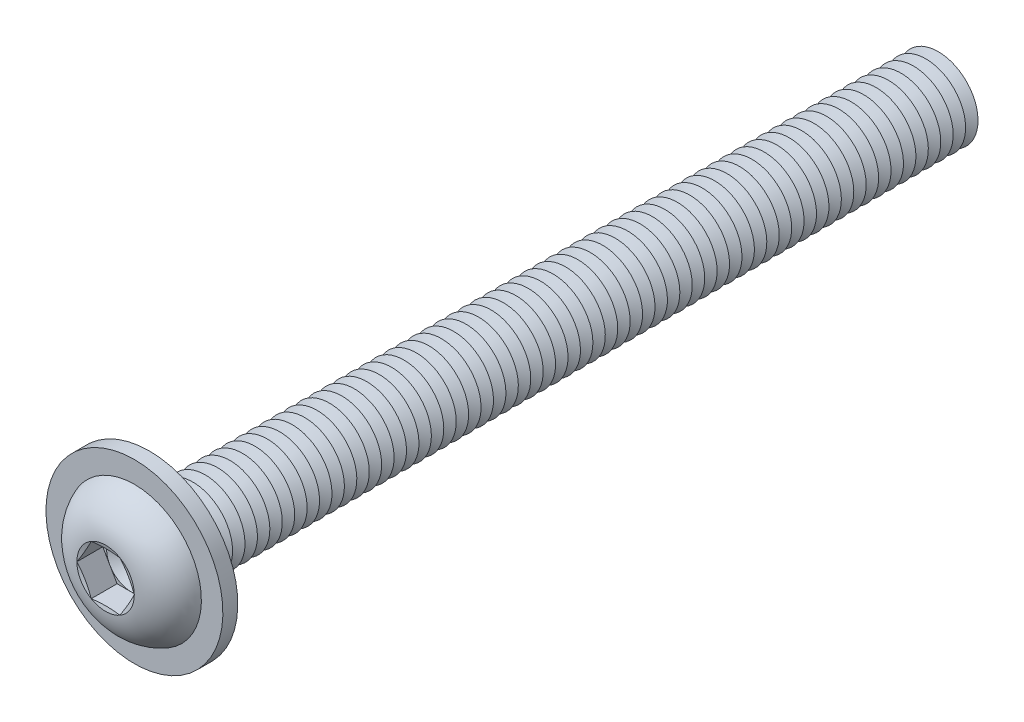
ISO-10303-21;
HEADER;
FILE_DESCRIPTION(('STEP AP214'),'2;1');
FILE_NAME('part.step','',(''),(''),'','','');
FILE_SCHEMA(('AUTOMOTIVE_DESIGN { 1 0 10303 214 1 1 1 1 }'));
ENDSEC;
DATA;
#1=APPLICATION_CONTEXT('core data for automotive mechanical design processes');
#2=APPLICATION_PROTOCOL_DEFINITION('international standard','automotive_design',2000,#1);
#3=PRODUCT_CONTEXT('',#1,'mechanical');
#4=PRODUCT('Part','Part','',(#3));
#5=PRODUCT_RELATED_PRODUCT_CATEGORY('part','',(#4));
#6=PRODUCT_DEFINITION_FORMATION('','',#4);
#7=PRODUCT_DEFINITION_CONTEXT('part definition',#1,'design');
#8=PRODUCT_DEFINITION('design','',#6,#7);
#9=PRODUCT_DEFINITION_SHAPE('','',#8);
#10=(LENGTH_UNIT() NAMED_UNIT(*) SI_UNIT(.MILLI.,.METRE.));
#11=(NAMED_UNIT(*) PLANE_ANGLE_UNIT() SI_UNIT($,.RADIAN.));
#12=(NAMED_UNIT(*) SI_UNIT($,.STERADIAN.) SOLID_ANGLE_UNIT());
#13=UNCERTAINTY_MEASURE_WITH_UNIT(LENGTH_MEASURE(1.E-05),#10,'distance_accuracy_value','');
#14=(GEOMETRIC_REPRESENTATION_CONTEXT(3) GLOBAL_UNCERTAINTY_ASSIGNED_CONTEXT((#13)) GLOBAL_UNIT_ASSIGNED_CONTEXT((#10,
#11,#12)) REPRESENTATION_CONTEXT('',''));
#15=CARTESIAN_POINT('',(0.,0.,0.));
#16=DIRECTION('',(0.,0.,1.));
#17=DIRECTION('',(1.,0.,0.));
#18=AXIS2_PLACEMENT_3D('',#15,#16,#17);
#19=CARTESIAN_POINT('',(0.,0.,-75.625));
#20=DIRECTION('',(0.,0.,1.));
#21=DIRECTION('',(0.,-1.,0.));
#22=AXIS2_PLACEMENT_3D('',#19,#20,#21);
#23=CONICAL_SURFACE('',#22,3.99999999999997,1.0471975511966);
#24=CARTESIAN_POINT('',(0.,0.,-76.25));
#25=DIRECTION('',(0.,0.,1.));
#26=DIRECTION('',(0.,-1.,0.));
#27=AXIS2_PLACEMENT_3D('',#24,#25,#26);
#28=CIRCLE('',#27,2.91746824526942);
#29=CARTESIAN_POINT('',(0.,-2.91746824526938,-76.25));
#30=VERTEX_POINT('',#29);
#31=EDGE_CURVE('E721',#30,#30,#28,.T.);
#32=ORIENTED_EDGE('',*,*,#31,.T.);
#33=EDGE_LOOP('',(#32));
#34=FACE_BOUND('',#33,.T.);
#35=CARTESIAN_POINT('',(0.,0.,-75.625));
#36=DIRECTION('',(0.,0.,1.));
#37=DIRECTION('',(0.,-1.,0.));
#38=AXIS2_PLACEMENT_3D('',#35,#36,#37);
#39=CIRCLE('',#38,3.99999999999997);
#40=CARTESIAN_POINT('',(0.,-3.99999999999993,-75.625));
#41=VERTEX_POINT('',#40);
#42=EDGE_CURVE('E717',#41,#41,#39,.T.);
#43=ORIENTED_EDGE('',*,*,#42,.F.);
#44=EDGE_LOOP('',(#43));
#45=FACE_BOUND('',#44,.T.);
#46=ADVANCED_FACE('F39',(#34,#45),#23,.T.);
#47=CARTESIAN_POINT('',(0.,0.,-76.25));
#48=DIRECTION('',(0.,0.,-1.));
#49=DIRECTION('',(0.,1.,0.));
#50=AXIS2_PLACEMENT_3D('',#47,#48,#49);
#51=CONICAL_SURFACE('',#50,2.91746824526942,1.0471975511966);
#52=CARTESIAN_POINT('',(0.,0.,-76.875));
#53=DIRECTION('',(0.,0.,1.));
#54=DIRECTION('',(0.,-1.,0.));
#55=AXIS2_PLACEMENT_3D('',#52,#53,#54);
#56=CIRCLE('',#55,3.99999999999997);
#57=CARTESIAN_POINT('',(0.,-3.99999999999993,-76.875));
#58=VERTEX_POINT('',#57);
#59=EDGE_CURVE('E725',#58,#58,#56,.T.);
#60=ORIENTED_EDGE('',*,*,#59,.T.);
#61=EDGE_LOOP('',(#60));
#62=FACE_BOUND('',#61,.T.);
#63=ORIENTED_EDGE('',*,*,#31,.F.);
#64=EDGE_LOOP('',(#63));
#65=FACE_BOUND('',#64,.T.);
#66=ADVANCED_FACE('F840',(#62,#65),#51,.T.);
#67=CARTESIAN_POINT('',(0.,3.99999999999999,-80.));
#68=DIRECTION('',(0.,0.,-1.));
#69=DIRECTION('',(0.,1.,0.));
#70=AXIS2_PLACEMENT_3D('',#67,#68,#69);
#71=PLANE('',#70);
#72=CARTESIAN_POINT('',(0.,0.,-80.));
#73=DIRECTION('',(0.,0.,1.));
#74=DIRECTION('',(0.,-1.,0.));
#75=AXIS2_PLACEMENT_3D('',#72,#73,#74);
#76=CIRCLE('',#75,2.91746824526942);
#77=CARTESIAN_POINT('',(0.,-2.91746824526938,-80.));
#78=VERTEX_POINT('',#77);
#79=EDGE_CURVE('E745',#78,#78,#76,.T.);
#80=ORIENTED_EDGE('',*,*,#79,.F.);
#81=EDGE_LOOP('',(#80));
#82=FACE_BOUND('',#81,.T.);
#83=ADVANCED_FACE('F846',(#82),#71,.T.);
#84=CARTESIAN_POINT('',(0.,0.,-79.375));
#85=DIRECTION('',(0.,0.,1.));
#86=DIRECTION('',(0.,-1.,0.));
#87=AXIS2_PLACEMENT_3D('',#84,#85,#86);
#88=CONICAL_SURFACE('',#87,3.99999999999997,1.0471975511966);
#89=ORIENTED_EDGE('',*,*,#79,.T.);
#90=EDGE_LOOP('',(#89));
#91=FACE_BOUND('',#90,.T.);
#92=CARTESIAN_POINT('',(0.,0.,-79.375));
#93=DIRECTION('',(0.,0.,1.));
#94=DIRECTION('',(0.,-1.,0.));
#95=AXIS2_PLACEMENT_3D('',#92,#93,#94);
#96=CIRCLE('',#95,3.99999999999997);
#97=CARTESIAN_POINT('',(0.,-3.99999999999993,-79.375));
#98=VERTEX_POINT('',#97);
#99=EDGE_CURVE('E741',#98,#98,#96,.T.);
#100=ORIENTED_EDGE('',*,*,#99,.F.);
#101=EDGE_LOOP('',(#100));
#102=FACE_BOUND('',#101,.T.);
#103=ADVANCED_FACE('F865',(#91,#102),#88,.T.);
#104=CARTESIAN_POINT('',(0.,0.,-78.75));
#105=DIRECTION('',(0.,0.,-1.));
#106=DIRECTION('',(0.,1.,0.));
#107=AXIS2_PLACEMENT_3D('',#104,#105,#106);
#108=CONICAL_SURFACE('',#107,2.91746824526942,1.0471975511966);
#109=ORIENTED_EDGE('',*,*,#99,.T.);
#110=EDGE_LOOP('',(#109));
#111=FACE_BOUND('',#110,.T.);
#112=CARTESIAN_POINT('',(0.,0.,-78.75));
#113=DIRECTION('',(0.,0.,1.));
#114=DIRECTION('',(0.,-1.,0.));
#115=AXIS2_PLACEMENT_3D('',#112,#113,#114);
#116=CIRCLE('',#115,2.91746824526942);
#117=CARTESIAN_POINT('',(0.,-2.91746824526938,-78.75));
#118=VERTEX_POINT('',#117);
#119=EDGE_CURVE('E737',#118,#118,#116,.T.);
#120=ORIENTED_EDGE('',*,*,#119,.F.);
#121=EDGE_LOOP('',(#120));
#122=FACE_BOUND('',#121,.T.);
#123=ADVANCED_FACE('F862',(#111,#122),#108,.T.);
#124=CARTESIAN_POINT('',(0.,0.,-78.125));
#125=DIRECTION('',(0.,0.,1.));
#126=DIRECTION('',(0.,-1.,0.));
#127=AXIS2_PLACEMENT_3D('',#124,#125,#126);
#128=CONICAL_SURFACE('',#127,3.99999999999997,1.0471975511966);
#129=ORIENTED_EDGE('',*,*,#119,.T.);
#130=EDGE_LOOP('',(#129));
#131=FACE_BOUND('',#130,.T.);
#132=CARTESIAN_POINT('',(0.,0.,-78.125));
#133=DIRECTION('',(0.,0.,1.));
#134=DIRECTION('',(0.,-1.,0.));
#135=AXIS2_PLACEMENT_3D('',#132,#133,#134);
#136=CIRCLE('',#135,3.99999999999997);
#137=CARTESIAN_POINT('',(0.,-3.99999999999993,-78.125));
#138=VERTEX_POINT('',#137);
#139=EDGE_CURVE('E733',#138,#138,#136,.T.);
#140=ORIENTED_EDGE('',*,*,#139,.F.);
#141=EDGE_LOOP('',(#140));
#142=FACE_BOUND('',#141,.T.);
#143=ADVANCED_FACE('F856',(#131,#142),#128,.T.);
#144=CARTESIAN_POINT('',(0.,0.,-77.5));
#145=DIRECTION('',(0.,0.,-1.));
#146=DIRECTION('',(0.,1.,0.));
#147=AXIS2_PLACEMENT_3D('',#144,#145,#146);
#148=CONICAL_SURFACE('',#147,2.91746824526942,1.0471975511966);
#149=ORIENTED_EDGE('',*,*,#139,.T.);
#150=EDGE_LOOP('',(#149));
#151=FACE_BOUND('',#150,.T.);
#152=CARTESIAN_POINT('',(0.,0.,-77.5));
#153=DIRECTION('',(0.,0.,1.));
#154=DIRECTION('',(0.,-1.,0.));
#155=AXIS2_PLACEMENT_3D('',#152,#153,#154);
#156=CIRCLE('',#155,2.91746824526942);
#157=CARTESIAN_POINT('',(0.,-2.91746824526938,-77.5));
#158=VERTEX_POINT('',#157);
#159=EDGE_CURVE('E729',#158,#158,#156,.T.);
#160=ORIENTED_EDGE('',*,*,#159,.F.);
#161=EDGE_LOOP('',(#160));
#162=FACE_BOUND('',#161,.T.);
#163=ADVANCED_FACE('F852',(#151,#162),#148,.T.);
#164=CARTESIAN_POINT('',(0.,0.,-76.875));
#165=DIRECTION('',(0.,0.,1.));
#166=DIRECTION('',(0.,-1.,0.));
#167=AXIS2_PLACEMENT_3D('',#164,#165,#166);
#168=CONICAL_SURFACE('',#167,3.99999999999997,1.0471975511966);
#169=ORIENTED_EDGE('',*,*,#159,.T.);
#170=EDGE_LOOP('',(#169));
#171=FACE_BOUND('',#170,.T.);
#172=ORIENTED_EDGE('',*,*,#59,.F.);
#173=EDGE_LOOP('',(#172));
#174=FACE_BOUND('',#173,.T.);
#175=ADVANCED_FACE('F855',(#171,#174),#168,.T.);
#176=CARTESIAN_POINT('',(0.,0.,-74.375));
#177=DIRECTION('',(0.,0.,1.));
#178=DIRECTION('',(0.,-1.,0.));
#179=AXIS2_PLACEMENT_3D('',#176,#177,#178);
#180=CONICAL_SURFACE('',#179,3.99999999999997,1.0471975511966);
#181=CARTESIAN_POINT('',(0.,0.,-75.));
#182=DIRECTION('',(0.,0.,1.));
#183=DIRECTION('',(0.,-1.,0.));
#184=AXIS2_PLACEMENT_3D('',#181,#182,#183);
#185=CIRCLE('',#184,2.91746824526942);
#186=CARTESIAN_POINT('',(0.,-2.91746824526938,-75.));
#187=VERTEX_POINT('',#186);
#188=EDGE_CURVE('E713',#187,#187,#185,.T.);
#189=ORIENTED_EDGE('',*,*,#188,.T.);
#190=EDGE_LOOP('',(#189));
#191=FACE_BOUND('',#190,.T.);
#192=CARTESIAN_POINT('',(0.,0.,-74.375));
#193=DIRECTION('',(0.,0.,1.));
#194=DIRECTION('',(0.,-1.,0.));
#195=AXIS2_PLACEMENT_3D('',#192,#193,#194);
#196=CIRCLE('',#195,3.99999999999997);
#197=CARTESIAN_POINT('',(0.,-3.99999999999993,-74.375));
#198=VERTEX_POINT('',#197);
#199=EDGE_CURVE('E709',#198,#198,#196,.T.);
#200=ORIENTED_EDGE('',*,*,#199,.F.);
#201=EDGE_LOOP('',(#200));
#202=FACE_BOUND('',#201,.T.);
#203=ADVANCED_FACE('F860',(#191,#202),#180,.T.);
#204=CARTESIAN_POINT('',(0.,0.,-75.));
#205=DIRECTION('',(0.,0.,-1.));
#206=DIRECTION('',(0.,1.,0.));
#207=AXIS2_PLACEMENT_3D('',#204,#205,#206);
#208=CONICAL_SURFACE('',#207,2.91746824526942,1.0471975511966);
#209=ORIENTED_EDGE('',*,*,#42,.T.);
#210=EDGE_LOOP('',(#209));
#211=FACE_BOUND('',#210,.T.);
#212=ORIENTED_EDGE('',*,*,#188,.F.);
#213=EDGE_LOOP('',(#212));
#214=FACE_BOUND('',#213,.T.);
#215=ADVANCED_FACE('F911',(#211,#214),#208,.T.);
#216=CARTESIAN_POINT('',(0.,0.,-73.125));
#217=DIRECTION('',(0.,0.,1.));
#218=DIRECTION('',(0.,-1.,0.));
#219=AXIS2_PLACEMENT_3D('',#216,#217,#218);
#220=CONICAL_SURFACE('',#219,3.99999999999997,1.0471975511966);
#221=CARTESIAN_POINT('',(0.,0.,-73.75));
#222=DIRECTION('',(0.,0.,1.));
#223=DIRECTION('',(0.,-1.,0.));
#224=AXIS2_PLACEMENT_3D('',#221,#222,#223);
#225=CIRCLE('',#224,2.91746824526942);
#226=CARTESIAN_POINT('',(0.,-2.91746824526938,-73.75));
#227=VERTEX_POINT('',#226);
#228=EDGE_CURVE('E705',#227,#227,#225,.T.);
#229=ORIENTED_EDGE('',*,*,#228,.T.);
#230=EDGE_LOOP('',(#229));
#231=FACE_BOUND('',#230,.T.);
#232=CARTESIAN_POINT('',(0.,0.,-73.125));
#233=DIRECTION('',(0.,0.,1.));
#234=DIRECTION('',(0.,-1.,0.));
#235=AXIS2_PLACEMENT_3D('',#232,#233,#234);
#236=CIRCLE('',#235,3.99999999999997);
#237=CARTESIAN_POINT('',(0.,-3.99999999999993,-73.125));
#238=VERTEX_POINT('',#237);
#239=EDGE_CURVE('E701',#238,#238,#236,.T.);
#240=ORIENTED_EDGE('',*,*,#239,.F.);
#241=EDGE_LOOP('',(#240));
#242=FACE_BOUND('',#241,.T.);
#243=ADVANCED_FACE('F917',(#231,#242),#220,.T.);
#244=CARTESIAN_POINT('',(0.,0.,-73.75));
#245=DIRECTION('',(0.,0.,-1.));
#246=DIRECTION('',(0.,1.,0.));
#247=AXIS2_PLACEMENT_3D('',#244,#245,#246);
#248=CONICAL_SURFACE('',#247,2.91746824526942,1.0471975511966);
#249=ORIENTED_EDGE('',*,*,#199,.T.);
#250=EDGE_LOOP('',(#249));
#251=FACE_BOUND('',#250,.T.);
#252=ORIENTED_EDGE('',*,*,#228,.F.);
#253=EDGE_LOOP('',(#252));
#254=FACE_BOUND('',#253,.T.);
#255=ADVANCED_FACE('F924',(#251,#254),#248,.T.);
#256=CARTESIAN_POINT('',(0.,0.,-71.875));
#257=DIRECTION('',(0.,0.,1.));
#258=DIRECTION('',(0.,-1.,0.));
#259=AXIS2_PLACEMENT_3D('',#256,#257,#258);
#260=CONICAL_SURFACE('',#259,3.99999999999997,1.0471975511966);
#261=CARTESIAN_POINT('',(0.,0.,-72.5));
#262=DIRECTION('',(0.,0.,1.));
#263=DIRECTION('',(0.,-1.,0.));
#264=AXIS2_PLACEMENT_3D('',#261,#262,#263);
#265=CIRCLE('',#264,2.91746824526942);
#266=CARTESIAN_POINT('',(0.,-2.91746824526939,-72.5));
#267=VERTEX_POINT('',#266);
#268=EDGE_CURVE('E697',#267,#267,#265,.T.);
#269=ORIENTED_EDGE('',*,*,#268,.T.);
#270=EDGE_LOOP('',(#269));
#271=FACE_BOUND('',#270,.T.);
#272=CARTESIAN_POINT('',(0.,0.,-71.875));
#273=DIRECTION('',(0.,0.,1.));
#274=DIRECTION('',(0.,-1.,0.));
#275=AXIS2_PLACEMENT_3D('',#272,#273,#274);
#276=CIRCLE('',#275,3.99999999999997);
#277=CARTESIAN_POINT('',(0.,-3.99999999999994,-71.875));
#278=VERTEX_POINT('',#277);
#279=EDGE_CURVE('E693',#278,#278,#276,.T.);
#280=ORIENTED_EDGE('',*,*,#279,.F.);
#281=EDGE_LOOP('',(#280));
#282=FACE_BOUND('',#281,.T.);
#283=ADVANCED_FACE('F931',(#271,#282),#260,.T.);
#284=CARTESIAN_POINT('',(0.,0.,-72.5));
#285=DIRECTION('',(0.,0.,-1.));
#286=DIRECTION('',(0.,1.,0.));
#287=AXIS2_PLACEMENT_3D('',#284,#285,#286);
#288=CONICAL_SURFACE('',#287,2.91746824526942,1.0471975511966);
#289=ORIENTED_EDGE('',*,*,#239,.T.);
#290=EDGE_LOOP('',(#289));
#291=FACE_BOUND('',#290,.T.);
#292=ORIENTED_EDGE('',*,*,#268,.F.);
#293=EDGE_LOOP('',(#292));
#294=FACE_BOUND('',#293,.T.);
#295=ADVANCED_FACE('F938',(#291,#294),#288,.T.);
#296=CARTESIAN_POINT('',(0.,0.,-70.625));
#297=DIRECTION('',(0.,0.,1.));
#298=DIRECTION('',(0.,-1.,0.));
#299=AXIS2_PLACEMENT_3D('',#296,#297,#298);
#300=CONICAL_SURFACE('',#299,3.99999999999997,1.0471975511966);
#301=CARTESIAN_POINT('',(0.,0.,-71.25));
#302=DIRECTION('',(0.,0.,1.));
#303=DIRECTION('',(0.,-1.,0.));
#304=AXIS2_PLACEMENT_3D('',#301,#302,#303);
#305=CIRCLE('',#304,2.91746824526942);
#306=CARTESIAN_POINT('',(0.,-2.91746824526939,-71.25));
#307=VERTEX_POINT('',#306);
#308=EDGE_CURVE('E689',#307,#307,#305,.T.);
#309=ORIENTED_EDGE('',*,*,#308,.T.);
#310=EDGE_LOOP('',(#309));
#311=FACE_BOUND('',#310,.T.);
#312=CARTESIAN_POINT('',(0.,0.,-70.625));
#313=DIRECTION('',(0.,0.,1.));
#314=DIRECTION('',(0.,-1.,0.));
#315=AXIS2_PLACEMENT_3D('',#312,#313,#314);
#316=CIRCLE('',#315,3.99999999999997);
#317=CARTESIAN_POINT('',(0.,-3.99999999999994,-70.625));
#318=VERTEX_POINT('',#317);
#319=EDGE_CURVE('E685',#318,#318,#316,.T.);
#320=ORIENTED_EDGE('',*,*,#319,.F.);
#321=EDGE_LOOP('',(#320));
#322=FACE_BOUND('',#321,.T.);
#323=ADVANCED_FACE('F945',(#311,#322),#300,.T.);
#324=CARTESIAN_POINT('',(0.,0.,-71.25));
#325=DIRECTION('',(0.,0.,-1.));
#326=DIRECTION('',(0.,1.,0.));
#327=AXIS2_PLACEMENT_3D('',#324,#325,#326);
#328=CONICAL_SURFACE('',#327,2.91746824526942,1.0471975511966);
#329=ORIENTED_EDGE('',*,*,#279,.T.);
#330=EDGE_LOOP('',(#329));
#331=FACE_BOUND('',#330,.T.);
#332=ORIENTED_EDGE('',*,*,#308,.F.);
#333=EDGE_LOOP('',(#332));
#334=FACE_BOUND('',#333,.T.);
#335=ADVANCED_FACE('F952',(#331,#334),#328,.T.);
#336=CARTESIAN_POINT('',(0.,0.,-69.375));
#337=DIRECTION('',(0.,0.,1.));
#338=DIRECTION('',(0.,-1.,0.));
#339=AXIS2_PLACEMENT_3D('',#336,#337,#338);
#340=CONICAL_SURFACE('',#339,3.99999999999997,1.0471975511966);
#341=CARTESIAN_POINT('',(0.,0.,-70.));
#342=DIRECTION('',(0.,0.,1.));
#343=DIRECTION('',(0.,-1.,0.));
#344=AXIS2_PLACEMENT_3D('',#341,#342,#343);
#345=CIRCLE('',#344,2.91746824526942);
#346=CARTESIAN_POINT('',(0.,-2.91746824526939,-70.));
#347=VERTEX_POINT('',#346);
#348=EDGE_CURVE('E681',#347,#347,#345,.T.);
#349=ORIENTED_EDGE('',*,*,#348,.T.);
#350=EDGE_LOOP('',(#349));
#351=FACE_BOUND('',#350,.T.);
#352=CARTESIAN_POINT('',(0.,0.,-69.375));
#353=DIRECTION('',(0.,0.,1.));
#354=DIRECTION('',(0.,-1.,0.));
#355=AXIS2_PLACEMENT_3D('',#352,#353,#354);
#356=CIRCLE('',#355,3.99999999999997);
#357=CARTESIAN_POINT('',(0.,-3.99999999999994,-69.375));
#358=VERTEX_POINT('',#357);
#359=EDGE_CURVE('E677',#358,#358,#356,.T.);
#360=ORIENTED_EDGE('',*,*,#359,.F.);
#361=EDGE_LOOP('',(#360));
#362=FACE_BOUND('',#361,.T.);
#363=ADVANCED_FACE('F959',(#351,#362),#340,.T.);
#364=CARTESIAN_POINT('',(0.,0.,-70.));
#365=DIRECTION('',(0.,0.,-1.));
#366=DIRECTION('',(0.,1.,0.));
#367=AXIS2_PLACEMENT_3D('',#364,#365,#366);
#368=CONICAL_SURFACE('',#367,2.91746824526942,1.0471975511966);
#369=ORIENTED_EDGE('',*,*,#319,.T.);
#370=EDGE_LOOP('',(#369));
#371=FACE_BOUND('',#370,.T.);
#372=ORIENTED_EDGE('',*,*,#348,.F.);
#373=EDGE_LOOP('',(#372));
#374=FACE_BOUND('',#373,.T.);
#375=ADVANCED_FACE('F966',(#371,#374),#368,.T.);
#376=CARTESIAN_POINT('',(0.,0.,-68.125));
#377=DIRECTION('',(0.,0.,1.));
#378=DIRECTION('',(0.,-1.,0.));
#379=AXIS2_PLACEMENT_3D('',#376,#377,#378);
#380=CONICAL_SURFACE('',#379,3.99999999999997,1.0471975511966);
#381=CARTESIAN_POINT('',(0.,0.,-68.75));
#382=DIRECTION('',(0.,0.,1.));
#383=DIRECTION('',(0.,-1.,0.));
#384=AXIS2_PLACEMENT_3D('',#381,#382,#383);
#385=CIRCLE('',#384,2.91746824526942);
#386=CARTESIAN_POINT('',(0.,-2.91746824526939,-68.75));
#387=VERTEX_POINT('',#386);
#388=EDGE_CURVE('E673',#387,#387,#385,.T.);
#389=ORIENTED_EDGE('',*,*,#388,.T.);
#390=EDGE_LOOP('',(#389));
#391=FACE_BOUND('',#390,.T.);
#392=CARTESIAN_POINT('',(0.,0.,-68.125));
#393=DIRECTION('',(0.,0.,1.));
#394=DIRECTION('',(0.,-1.,0.));
#395=AXIS2_PLACEMENT_3D('',#392,#393,#394);
#396=CIRCLE('',#395,3.99999999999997);
#397=CARTESIAN_POINT('',(0.,-3.99999999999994,-68.125));
#398=VERTEX_POINT('',#397);
#399=EDGE_CURVE('E669',#398,#398,#396,.T.);
#400=ORIENTED_EDGE('',*,*,#399,.F.);
#401=EDGE_LOOP('',(#400));
#402=FACE_BOUND('',#401,.T.);
#403=ADVANCED_FACE('F973',(#391,#402),#380,.T.);
#404=CARTESIAN_POINT('',(0.,0.,-68.75));
#405=DIRECTION('',(0.,0.,-1.));
#406=DIRECTION('',(0.,1.,0.));
#407=AXIS2_PLACEMENT_3D('',#404,#405,#406);
#408=CONICAL_SURFACE('',#407,2.91746824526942,1.0471975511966);
#409=ORIENTED_EDGE('',*,*,#359,.T.);
#410=EDGE_LOOP('',(#409));
#411=FACE_BOUND('',#410,.T.);
#412=ORIENTED_EDGE('',*,*,#388,.F.);
#413=EDGE_LOOP('',(#412));
#414=FACE_BOUND('',#413,.T.);
#415=ADVANCED_FACE('F980',(#411,#414),#408,.T.);
#416=CARTESIAN_POINT('',(0.,0.,-66.875));
#417=DIRECTION('',(0.,0.,1.));
#418=DIRECTION('',(0.,-1.,0.));
#419=AXIS2_PLACEMENT_3D('',#416,#417,#418);
#420=CONICAL_SURFACE('',#419,3.99999999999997,1.0471975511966);
#421=CARTESIAN_POINT('',(0.,0.,-67.5));
#422=DIRECTION('',(0.,0.,1.));
#423=DIRECTION('',(0.,-1.,0.));
#424=AXIS2_PLACEMENT_3D('',#421,#422,#423);
#425=CIRCLE('',#424,2.91746824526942);
#426=CARTESIAN_POINT('',(0.,-2.91746824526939,-67.5));
#427=VERTEX_POINT('',#426);
#428=EDGE_CURVE('E665',#427,#427,#425,.T.);
#429=ORIENTED_EDGE('',*,*,#428,.T.);
#430=EDGE_LOOP('',(#429));
#431=FACE_BOUND('',#430,.T.);
#432=CARTESIAN_POINT('',(0.,0.,-66.875));
#433=DIRECTION('',(0.,0.,1.));
#434=DIRECTION('',(0.,-1.,0.));
#435=AXIS2_PLACEMENT_3D('',#432,#433,#434);
#436=CIRCLE('',#435,3.99999999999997);
#437=CARTESIAN_POINT('',(0.,-3.99999999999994,-66.875));
#438=VERTEX_POINT('',#437);
#439=EDGE_CURVE('E661',#438,#438,#436,.T.);
#440=ORIENTED_EDGE('',*,*,#439,.F.);
#441=EDGE_LOOP('',(#440));
#442=FACE_BOUND('',#441,.T.);
#443=ADVANCED_FACE('F987',(#431,#442),#420,.T.);
#444=CARTESIAN_POINT('',(0.,0.,-67.5));
#445=DIRECTION('',(0.,0.,-1.));
#446=DIRECTION('',(0.,1.,0.));
#447=AXIS2_PLACEMENT_3D('',#444,#445,#446);
#448=CONICAL_SURFACE('',#447,2.91746824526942,1.0471975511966);
#449=ORIENTED_EDGE('',*,*,#399,.T.);
#450=EDGE_LOOP('',(#449));
#451=FACE_BOUND('',#450,.T.);
#452=ORIENTED_EDGE('',*,*,#428,.F.);
#453=EDGE_LOOP('',(#452));
#454=FACE_BOUND('',#453,.T.);
#455=ADVANCED_FACE('F994',(#451,#454),#448,.T.);
#456=CARTESIAN_POINT('',(0.,0.,-65.625));
#457=DIRECTION('',(0.,0.,1.));
#458=DIRECTION('',(0.,-1.,0.));
#459=AXIS2_PLACEMENT_3D('',#456,#457,#458);
#460=CONICAL_SURFACE('',#459,3.99999999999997,1.0471975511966);
#461=CARTESIAN_POINT('',(0.,0.,-66.25));
#462=DIRECTION('',(0.,0.,1.));
#463=DIRECTION('',(0.,-1.,0.));
#464=AXIS2_PLACEMENT_3D('',#461,#462,#463);
#465=CIRCLE('',#464,2.91746824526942);
#466=CARTESIAN_POINT('',(0.,-2.91746824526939,-66.25));
#467=VERTEX_POINT('',#466);
#468=EDGE_CURVE('E657',#467,#467,#465,.T.);
#469=ORIENTED_EDGE('',*,*,#468,.T.);
#470=EDGE_LOOP('',(#469));
#471=FACE_BOUND('',#470,.T.);
#472=CARTESIAN_POINT('',(0.,0.,-65.625));
#473=DIRECTION('',(0.,0.,1.));
#474=DIRECTION('',(0.,-1.,0.));
#475=AXIS2_PLACEMENT_3D('',#472,#473,#474);
#476=CIRCLE('',#475,3.99999999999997);
#477=CARTESIAN_POINT('',(0.,-3.99999999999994,-65.625));
#478=VERTEX_POINT('',#477);
#479=EDGE_CURVE('E653',#478,#478,#476,.T.);
#480=ORIENTED_EDGE('',*,*,#479,.F.);
#481=EDGE_LOOP('',(#480));
#482=FACE_BOUND('',#481,.T.);
#483=ADVANCED_FACE('F1001',(#471,#482),#460,.T.);
#484=CARTESIAN_POINT('',(0.,0.,-66.25));
#485=DIRECTION('',(0.,0.,-1.));
#486=DIRECTION('',(0.,1.,0.));
#487=AXIS2_PLACEMENT_3D('',#484,#485,#486);
#488=CONICAL_SURFACE('',#487,2.91746824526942,1.0471975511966);
#489=ORIENTED_EDGE('',*,*,#439,.T.);
#490=EDGE_LOOP('',(#489));
#491=FACE_BOUND('',#490,.T.);
#492=ORIENTED_EDGE('',*,*,#468,.F.);
#493=EDGE_LOOP('',(#492));
#494=FACE_BOUND('',#493,.T.);
#495=ADVANCED_FACE('F1008',(#491,#494),#488,.T.);
#496=CARTESIAN_POINT('',(0.,0.,-64.375));
#497=DIRECTION('',(0.,0.,1.));
#498=DIRECTION('',(0.,-1.,0.));
#499=AXIS2_PLACEMENT_3D('',#496,#497,#498);
#500=CONICAL_SURFACE('',#499,3.99999999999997,1.0471975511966);
#501=CARTESIAN_POINT('',(0.,0.,-65.));
#502=DIRECTION('',(0.,0.,1.));
#503=DIRECTION('',(0.,-1.,0.));
#504=AXIS2_PLACEMENT_3D('',#501,#502,#503);
#505=CIRCLE('',#504,2.91746824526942);
#506=CARTESIAN_POINT('',(0.,-2.91746824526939,-65.));
#507=VERTEX_POINT('',#506);
#508=EDGE_CURVE('E649',#507,#507,#505,.T.);
#509=ORIENTED_EDGE('',*,*,#508,.T.);
#510=EDGE_LOOP('',(#509));
#511=FACE_BOUND('',#510,.T.);
#512=CARTESIAN_POINT('',(0.,0.,-64.375));
#513=DIRECTION('',(0.,0.,1.));
#514=DIRECTION('',(0.,-1.,0.));
#515=AXIS2_PLACEMENT_3D('',#512,#513,#514);
#516=CIRCLE('',#515,3.99999999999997);
#517=CARTESIAN_POINT('',(0.,-3.99999999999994,-64.375));
#518=VERTEX_POINT('',#517);
#519=EDGE_CURVE('E645',#518,#518,#516,.T.);
#520=ORIENTED_EDGE('',*,*,#519,.F.);
#521=EDGE_LOOP('',(#520));
#522=FACE_BOUND('',#521,.T.);
#523=ADVANCED_FACE('F1015',(#511,#522),#500,.T.);
#524=CARTESIAN_POINT('',(0.,0.,-65.));
#525=DIRECTION('',(0.,0.,-1.));
#526=DIRECTION('',(0.,1.,0.));
#527=AXIS2_PLACEMENT_3D('',#524,#525,#526);
#528=CONICAL_SURFACE('',#527,2.91746824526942,1.0471975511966);
#529=ORIENTED_EDGE('',*,*,#479,.T.);
#530=EDGE_LOOP('',(#529));
#531=FACE_BOUND('',#530,.T.);
#532=ORIENTED_EDGE('',*,*,#508,.F.);
#533=EDGE_LOOP('',(#532));
#534=FACE_BOUND('',#533,.T.);
#535=ADVANCED_FACE('F1022',(#531,#534),#528,.T.);
#536=CARTESIAN_POINT('',(0.,0.,-63.125));
#537=DIRECTION('',(0.,0.,1.));
#538=DIRECTION('',(0.,-1.,0.));
#539=AXIS2_PLACEMENT_3D('',#536,#537,#538);
#540=CONICAL_SURFACE('',#539,3.99999999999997,1.0471975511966);
#541=CARTESIAN_POINT('',(0.,0.,-63.75));
#542=DIRECTION('',(0.,0.,1.));
#543=DIRECTION('',(0.,-1.,0.));
#544=AXIS2_PLACEMENT_3D('',#541,#542,#543);
#545=CIRCLE('',#544,2.91746824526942);
#546=CARTESIAN_POINT('',(0.,-2.91746824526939,-63.75));
#547=VERTEX_POINT('',#546);
#548=EDGE_CURVE('E641',#547,#547,#545,.T.);
#549=ORIENTED_EDGE('',*,*,#548,.T.);
#550=EDGE_LOOP('',(#549));
#551=FACE_BOUND('',#550,.T.);
#552=CARTESIAN_POINT('',(0.,0.,-63.125));
#553=DIRECTION('',(0.,0.,1.));
#554=DIRECTION('',(0.,-1.,0.));
#555=AXIS2_PLACEMENT_3D('',#552,#553,#554);
#556=CIRCLE('',#555,3.99999999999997);
#557=CARTESIAN_POINT('',(0.,-3.99999999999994,-63.125));
#558=VERTEX_POINT('',#557);
#559=EDGE_CURVE('E637',#558,#558,#556,.T.);
#560=ORIENTED_EDGE('',*,*,#559,.F.);
#561=EDGE_LOOP('',(#560));
#562=FACE_BOUND('',#561,.T.);
#563=ADVANCED_FACE('F1029',(#551,#562),#540,.T.);
#564=CARTESIAN_POINT('',(0.,0.,-63.75));
#565=DIRECTION('',(0.,0.,-1.));
#566=DIRECTION('',(0.,1.,0.));
#567=AXIS2_PLACEMENT_3D('',#564,#565,#566);
#568=CONICAL_SURFACE('',#567,2.91746824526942,1.0471975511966);
#569=ORIENTED_EDGE('',*,*,#519,.T.);
#570=EDGE_LOOP('',(#569));
#571=FACE_BOUND('',#570,.T.);
#572=ORIENTED_EDGE('',*,*,#548,.F.);
#573=EDGE_LOOP('',(#572));
#574=FACE_BOUND('',#573,.T.);
#575=ADVANCED_FACE('F1036',(#571,#574),#568,.T.);
#576=CARTESIAN_POINT('',(0.,0.,-61.875));
#577=DIRECTION('',(0.,0.,1.));
#578=DIRECTION('',(0.,-1.,0.));
#579=AXIS2_PLACEMENT_3D('',#576,#577,#578);
#580=CONICAL_SURFACE('',#579,3.99999999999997,1.0471975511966);
#581=CARTESIAN_POINT('',(0.,0.,-62.5));
#582=DIRECTION('',(0.,0.,1.));
#583=DIRECTION('',(0.,-1.,0.));
#584=AXIS2_PLACEMENT_3D('',#581,#582,#583);
#585=CIRCLE('',#584,2.91746824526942);
#586=CARTESIAN_POINT('',(0.,-2.91746824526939,-62.5));
#587=VERTEX_POINT('',#586);
#588=EDGE_CURVE('E633',#587,#587,#585,.T.);
#589=ORIENTED_EDGE('',*,*,#588,.T.);
#590=EDGE_LOOP('',(#589));
#591=FACE_BOUND('',#590,.T.);
#592=CARTESIAN_POINT('',(0.,0.,-61.875));
#593=DIRECTION('',(0.,0.,1.));
#594=DIRECTION('',(0.,-1.,0.));
#595=AXIS2_PLACEMENT_3D('',#592,#593,#594);
#596=CIRCLE('',#595,3.99999999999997);
#597=CARTESIAN_POINT('',(0.,-3.99999999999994,-61.875));
#598=VERTEX_POINT('',#597);
#599=EDGE_CURVE('E629',#598,#598,#596,.T.);
#600=ORIENTED_EDGE('',*,*,#599,.F.);
#601=EDGE_LOOP('',(#600));
#602=FACE_BOUND('',#601,.T.);
#603=ADVANCED_FACE('F1043',(#591,#602),#580,.T.);
#604=CARTESIAN_POINT('',(0.,0.,-62.5));
#605=DIRECTION('',(0.,0.,-1.));
#606=DIRECTION('',(0.,1.,0.));
#607=AXIS2_PLACEMENT_3D('',#604,#605,#606);
#608=CONICAL_SURFACE('',#607,2.91746824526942,1.0471975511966);
#609=ORIENTED_EDGE('',*,*,#559,.T.);
#610=EDGE_LOOP('',(#609));
#611=FACE_BOUND('',#610,.T.);
#612=ORIENTED_EDGE('',*,*,#588,.F.);
#613=EDGE_LOOP('',(#612));
#614=FACE_BOUND('',#613,.T.);
#615=ADVANCED_FACE('F1050',(#611,#614),#608,.T.);
#616=CARTESIAN_POINT('',(0.,0.,-60.625));
#617=DIRECTION('',(0.,0.,1.));
#618=DIRECTION('',(0.,-1.,0.));
#619=AXIS2_PLACEMENT_3D('',#616,#617,#618);
#620=CONICAL_SURFACE('',#619,3.99999999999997,1.0471975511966);
#621=CARTESIAN_POINT('',(0.,0.,-61.25));
#622=DIRECTION('',(0.,0.,1.));
#623=DIRECTION('',(0.,-1.,0.));
#624=AXIS2_PLACEMENT_3D('',#621,#622,#623);
#625=CIRCLE('',#624,2.91746824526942);
#626=CARTESIAN_POINT('',(0.,-2.91746824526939,-61.25));
#627=VERTEX_POINT('',#626);
#628=EDGE_CURVE('E625',#627,#627,#625,.T.);
#629=ORIENTED_EDGE('',*,*,#628,.T.);
#630=EDGE_LOOP('',(#629));
#631=FACE_BOUND('',#630,.T.);
#632=CARTESIAN_POINT('',(0.,0.,-60.625));
#633=DIRECTION('',(0.,0.,1.));
#634=DIRECTION('',(0.,-1.,0.));
#635=AXIS2_PLACEMENT_3D('',#632,#633,#634);
#636=CIRCLE('',#635,3.99999999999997);
#637=CARTESIAN_POINT('',(0.,-3.99999999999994,-60.625));
#638=VERTEX_POINT('',#637);
#639=EDGE_CURVE('E621',#638,#638,#636,.T.);
#640=ORIENTED_EDGE('',*,*,#639,.F.);
#641=EDGE_LOOP('',(#640));
#642=FACE_BOUND('',#641,.T.);
#643=ADVANCED_FACE('F1057',(#631,#642),#620,.T.);
#644=CARTESIAN_POINT('',(0.,0.,-61.25));
#645=DIRECTION('',(0.,0.,-1.));
#646=DIRECTION('',(0.,1.,0.));
#647=AXIS2_PLACEMENT_3D('',#644,#645,#646);
#648=CONICAL_SURFACE('',#647,2.91746824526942,1.0471975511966);
#649=ORIENTED_EDGE('',*,*,#599,.T.);
#650=EDGE_LOOP('',(#649));
#651=FACE_BOUND('',#650,.T.);
#652=ORIENTED_EDGE('',*,*,#628,.F.);
#653=EDGE_LOOP('',(#652));
#654=FACE_BOUND('',#653,.T.);
#655=ADVANCED_FACE('F1064',(#651,#654),#648,.T.);
#656=CARTESIAN_POINT('',(0.,0.,-59.375));
#657=DIRECTION('',(0.,0.,1.));
#658=DIRECTION('',(0.,-1.,0.));
#659=AXIS2_PLACEMENT_3D('',#656,#657,#658);
#660=CONICAL_SURFACE('',#659,3.99999999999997,1.0471975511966);
#661=CARTESIAN_POINT('',(0.,0.,-60.));
#662=DIRECTION('',(0.,0.,1.));
#663=DIRECTION('',(0.,-1.,0.));
#664=AXIS2_PLACEMENT_3D('',#661,#662,#663);
#665=CIRCLE('',#664,2.91746824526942);
#666=CARTESIAN_POINT('',(0.,-2.91746824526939,-60.));
#667=VERTEX_POINT('',#666);
#668=EDGE_CURVE('E617',#667,#667,#665,.T.);
#669=ORIENTED_EDGE('',*,*,#668,.T.);
#670=EDGE_LOOP('',(#669));
#671=FACE_BOUND('',#670,.T.);
#672=CARTESIAN_POINT('',(0.,0.,-59.375));
#673=DIRECTION('',(0.,0.,1.));
#674=DIRECTION('',(0.,-1.,0.));
#675=AXIS2_PLACEMENT_3D('',#672,#673,#674);
#676=CIRCLE('',#675,3.99999999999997);
#677=CARTESIAN_POINT('',(0.,-3.99999999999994,-59.375));
#678=VERTEX_POINT('',#677);
#679=EDGE_CURVE('E613',#678,#678,#676,.T.);
#680=ORIENTED_EDGE('',*,*,#679,.F.);
#681=EDGE_LOOP('',(#680));
#682=FACE_BOUND('',#681,.T.);
#683=ADVANCED_FACE('F1071',(#671,#682),#660,.T.);
#684=CARTESIAN_POINT('',(0.,0.,-60.));
#685=DIRECTION('',(0.,0.,-1.));
#686=DIRECTION('',(0.,1.,0.));
#687=AXIS2_PLACEMENT_3D('',#684,#685,#686);
#688=CONICAL_SURFACE('',#687,2.91746824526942,1.0471975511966);
#689=ORIENTED_EDGE('',*,*,#639,.T.);
#690=EDGE_LOOP('',(#689));
#691=FACE_BOUND('',#690,.T.);
#692=ORIENTED_EDGE('',*,*,#668,.F.);
#693=EDGE_LOOP('',(#692));
#694=FACE_BOUND('',#693,.T.);
#695=ADVANCED_FACE('F1078',(#691,#694),#688,.T.);
#696=CARTESIAN_POINT('',(0.,0.,-58.125));
#697=DIRECTION('',(0.,0.,1.));
#698=DIRECTION('',(0.,-1.,0.));
#699=AXIS2_PLACEMENT_3D('',#696,#697,#698);
#700=CONICAL_SURFACE('',#699,3.99999999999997,1.0471975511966);
#701=CARTESIAN_POINT('',(0.,0.,-58.75));
#702=DIRECTION('',(0.,0.,1.));
#703=DIRECTION('',(0.,-1.,0.));
#704=AXIS2_PLACEMENT_3D('',#701,#702,#703);
#705=CIRCLE('',#704,2.91746824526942);
#706=CARTESIAN_POINT('',(0.,-2.91746824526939,-58.75));
#707=VERTEX_POINT('',#706);
#708=EDGE_CURVE('E609',#707,#707,#705,.T.);
#709=ORIENTED_EDGE('',*,*,#708,.T.);
#710=EDGE_LOOP('',(#709));
#711=FACE_BOUND('',#710,.T.);
#712=CARTESIAN_POINT('',(0.,0.,-58.125));
#713=DIRECTION('',(0.,0.,1.));
#714=DIRECTION('',(0.,-1.,0.));
#715=AXIS2_PLACEMENT_3D('',#712,#713,#714);
#716=CIRCLE('',#715,3.99999999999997);
#717=CARTESIAN_POINT('',(0.,-3.99999999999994,-58.125));
#718=VERTEX_POINT('',#717);
#719=EDGE_CURVE('E605',#718,#718,#716,.T.);
#720=ORIENTED_EDGE('',*,*,#719,.F.);
#721=EDGE_LOOP('',(#720));
#722=FACE_BOUND('',#721,.T.);
#723=ADVANCED_FACE('F1085',(#711,#722),#700,.T.);
#724=CARTESIAN_POINT('',(0.,0.,-58.75));
#725=DIRECTION('',(0.,0.,-1.));
#726=DIRECTION('',(0.,1.,0.));
#727=AXIS2_PLACEMENT_3D('',#724,#725,#726);
#728=CONICAL_SURFACE('',#727,2.91746824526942,1.0471975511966);
#729=ORIENTED_EDGE('',*,*,#679,.T.);
#730=EDGE_LOOP('',(#729));
#731=FACE_BOUND('',#730,.T.);
#732=ORIENTED_EDGE('',*,*,#708,.F.);
#733=EDGE_LOOP('',(#732));
#734=FACE_BOUND('',#733,.T.);
#735=ADVANCED_FACE('F1092',(#731,#734),#728,.T.);
#736=CARTESIAN_POINT('',(0.,0.,-56.875));
#737=DIRECTION('',(0.,0.,1.));
#738=DIRECTION('',(0.,-1.,0.));
#739=AXIS2_PLACEMENT_3D('',#736,#737,#738);
#740=CONICAL_SURFACE('',#739,3.99999999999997,1.0471975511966);
#741=CARTESIAN_POINT('',(0.,0.,-57.5));
#742=DIRECTION('',(0.,0.,1.));
#743=DIRECTION('',(0.,-1.,0.));
#744=AXIS2_PLACEMENT_3D('',#741,#742,#743);
#745=CIRCLE('',#744,2.91746824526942);
#746=CARTESIAN_POINT('',(0.,-2.91746824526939,-57.5));
#747=VERTEX_POINT('',#746);
#748=EDGE_CURVE('E601',#747,#747,#745,.T.);
#749=ORIENTED_EDGE('',*,*,#748,.T.);
#750=EDGE_LOOP('',(#749));
#751=FACE_BOUND('',#750,.T.);
#752=CARTESIAN_POINT('',(0.,0.,-56.875));
#753=DIRECTION('',(0.,0.,1.));
#754=DIRECTION('',(0.,-1.,0.));
#755=AXIS2_PLACEMENT_3D('',#752,#753,#754);
#756=CIRCLE('',#755,3.99999999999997);
#757=CARTESIAN_POINT('',(0.,-3.99999999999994,-56.875));
#758=VERTEX_POINT('',#757);
#759=EDGE_CURVE('E597',#758,#758,#756,.T.);
#760=ORIENTED_EDGE('',*,*,#759,.F.);
#761=EDGE_LOOP('',(#760));
#762=FACE_BOUND('',#761,.T.);
#763=ADVANCED_FACE('F1099',(#751,#762),#740,.T.);
#764=CARTESIAN_POINT('',(0.,0.,-57.5));
#765=DIRECTION('',(0.,0.,-1.));
#766=DIRECTION('',(0.,1.,0.));
#767=AXIS2_PLACEMENT_3D('',#764,#765,#766);
#768=CONICAL_SURFACE('',#767,2.91746824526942,1.0471975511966);
#769=ORIENTED_EDGE('',*,*,#719,.T.);
#770=EDGE_LOOP('',(#769));
#771=FACE_BOUND('',#770,.T.);
#772=ORIENTED_EDGE('',*,*,#748,.F.);
#773=EDGE_LOOP('',(#772));
#774=FACE_BOUND('',#773,.T.);
#775=ADVANCED_FACE('F1106',(#771,#774),#768,.T.);
#776=CARTESIAN_POINT('',(0.,0.,-55.625));
#777=DIRECTION('',(0.,0.,1.));
#778=DIRECTION('',(0.,-1.,0.));
#779=AXIS2_PLACEMENT_3D('',#776,#777,#778);
#780=CONICAL_SURFACE('',#779,3.99999999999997,1.0471975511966);
#781=CARTESIAN_POINT('',(0.,0.,-56.25));
#782=DIRECTION('',(0.,0.,1.));
#783=DIRECTION('',(0.,-1.,0.));
#784=AXIS2_PLACEMENT_3D('',#781,#782,#783);
#785=CIRCLE('',#784,2.91746824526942);
#786=CARTESIAN_POINT('',(0.,-2.91746824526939,-56.25));
#787=VERTEX_POINT('',#786);
#788=EDGE_CURVE('E593',#787,#787,#785,.T.);
#789=ORIENTED_EDGE('',*,*,#788,.T.);
#790=EDGE_LOOP('',(#789));
#791=FACE_BOUND('',#790,.T.);
#792=CARTESIAN_POINT('',(0.,0.,-55.625));
#793=DIRECTION('',(0.,0.,1.));
#794=DIRECTION('',(0.,-1.,0.));
#795=AXIS2_PLACEMENT_3D('',#792,#793,#794);
#796=CIRCLE('',#795,3.99999999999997);
#797=CARTESIAN_POINT('',(0.,-3.99999999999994,-55.625));
#798=VERTEX_POINT('',#797);
#799=EDGE_CURVE('E589',#798,#798,#796,.T.);
#800=ORIENTED_EDGE('',*,*,#799,.F.);
#801=EDGE_LOOP('',(#800));
#802=FACE_BOUND('',#801,.T.);
#803=ADVANCED_FACE('F1113',(#791,#802),#780,.T.);
#804=CARTESIAN_POINT('',(0.,0.,-56.25));
#805=DIRECTION('',(0.,0.,-1.));
#806=DIRECTION('',(0.,1.,0.));
#807=AXIS2_PLACEMENT_3D('',#804,#805,#806);
#808=CONICAL_SURFACE('',#807,2.91746824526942,1.0471975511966);
#809=ORIENTED_EDGE('',*,*,#759,.T.);
#810=EDGE_LOOP('',(#809));
#811=FACE_BOUND('',#810,.T.);
#812=ORIENTED_EDGE('',*,*,#788,.F.);
#813=EDGE_LOOP('',(#812));
#814=FACE_BOUND('',#813,.T.);
#815=ADVANCED_FACE('F1120',(#811,#814),#808,.T.);
#816=CARTESIAN_POINT('',(0.,0.,-54.375));
#817=DIRECTION('',(0.,0.,1.));
#818=DIRECTION('',(0.,-1.,0.));
#819=AXIS2_PLACEMENT_3D('',#816,#817,#818);
#820=CONICAL_SURFACE('',#819,3.99999999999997,1.0471975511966);
#821=CARTESIAN_POINT('',(0.,0.,-55.));
#822=DIRECTION('',(0.,0.,1.));
#823=DIRECTION('',(0.,-1.,0.));
#824=AXIS2_PLACEMENT_3D('',#821,#822,#823);
#825=CIRCLE('',#824,2.91746824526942);
#826=CARTESIAN_POINT('',(0.,-2.91746824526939,-55.));
#827=VERTEX_POINT('',#826);
#828=EDGE_CURVE('E585',#827,#827,#825,.T.);
#829=ORIENTED_EDGE('',*,*,#828,.T.);
#830=EDGE_LOOP('',(#829));
#831=FACE_BOUND('',#830,.T.);
#832=CARTESIAN_POINT('',(0.,0.,-54.375));
#833=DIRECTION('',(0.,0.,1.));
#834=DIRECTION('',(0.,-1.,0.));
#835=AXIS2_PLACEMENT_3D('',#832,#833,#834);
#836=CIRCLE('',#835,3.99999999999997);
#837=CARTESIAN_POINT('',(0.,-3.99999999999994,-54.375));
#838=VERTEX_POINT('',#837);
#839=EDGE_CURVE('E581',#838,#838,#836,.T.);
#840=ORIENTED_EDGE('',*,*,#839,.F.);
#841=EDGE_LOOP('',(#840));
#842=FACE_BOUND('',#841,.T.);
#843=ADVANCED_FACE('F1127',(#831,#842),#820,.T.);
#844=CARTESIAN_POINT('',(0.,0.,-55.));
#845=DIRECTION('',(0.,0.,-1.));
#846=DIRECTION('',(0.,1.,0.));
#847=AXIS2_PLACEMENT_3D('',#844,#845,#846);
#848=CONICAL_SURFACE('',#847,2.91746824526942,1.0471975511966);
#849=ORIENTED_EDGE('',*,*,#799,.T.);
#850=EDGE_LOOP('',(#849));
#851=FACE_BOUND('',#850,.T.);
#852=ORIENTED_EDGE('',*,*,#828,.F.);
#853=EDGE_LOOP('',(#852));
#854=FACE_BOUND('',#853,.T.);
#855=ADVANCED_FACE('F1134',(#851,#854),#848,.T.);
#856=CARTESIAN_POINT('',(0.,0.,-53.125));
#857=DIRECTION('',(0.,0.,1.));
#858=DIRECTION('',(0.,-1.,0.));
#859=AXIS2_PLACEMENT_3D('',#856,#857,#858);
#860=CONICAL_SURFACE('',#859,3.99999999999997,1.0471975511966);
#861=CARTESIAN_POINT('',(0.,0.,-53.75));
#862=DIRECTION('',(0.,0.,1.));
#863=DIRECTION('',(0.,-1.,0.));
#864=AXIS2_PLACEMENT_3D('',#861,#862,#863);
#865=CIRCLE('',#864,2.91746824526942);
#866=CARTESIAN_POINT('',(0.,-2.91746824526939,-53.75));
#867=VERTEX_POINT('',#866);
#868=EDGE_CURVE('E577',#867,#867,#865,.T.);
#869=ORIENTED_EDGE('',*,*,#868,.T.);
#870=EDGE_LOOP('',(#869));
#871=FACE_BOUND('',#870,.T.);
#872=CARTESIAN_POINT('',(0.,0.,-53.125));
#873=DIRECTION('',(0.,0.,1.));
#874=DIRECTION('',(0.,-1.,0.));
#875=AXIS2_PLACEMENT_3D('',#872,#873,#874);
#876=CIRCLE('',#875,3.99999999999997);
#877=CARTESIAN_POINT('',(0.,-3.99999999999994,-53.125));
#878=VERTEX_POINT('',#877);
#879=EDGE_CURVE('E573',#878,#878,#876,.T.);
#880=ORIENTED_EDGE('',*,*,#879,.F.);
#881=EDGE_LOOP('',(#880));
#882=FACE_BOUND('',#881,.T.);
#883=ADVANCED_FACE('F1141',(#871,#882),#860,.T.);
#884=CARTESIAN_POINT('',(0.,0.,-53.75));
#885=DIRECTION('',(0.,0.,-1.));
#886=DIRECTION('',(0.,1.,0.));
#887=AXIS2_PLACEMENT_3D('',#884,#885,#886);
#888=CONICAL_SURFACE('',#887,2.91746824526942,1.0471975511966);
#889=ORIENTED_EDGE('',*,*,#839,.T.);
#890=EDGE_LOOP('',(#889));
#891=FACE_BOUND('',#890,.T.);
#892=ORIENTED_EDGE('',*,*,#868,.F.);
#893=EDGE_LOOP('',(#892));
#894=FACE_BOUND('',#893,.T.);
#895=ADVANCED_FACE('F1148',(#891,#894),#888,.T.);
#896=CARTESIAN_POINT('',(0.,0.,-51.875));
#897=DIRECTION('',(0.,0.,1.));
#898=DIRECTION('',(0.,-1.,0.));
#899=AXIS2_PLACEMENT_3D('',#896,#897,#898);
#900=CONICAL_SURFACE('',#899,3.99999999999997,1.0471975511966);
#901=CARTESIAN_POINT('',(0.,0.,-52.5));
#902=DIRECTION('',(0.,0.,1.));
#903=DIRECTION('',(0.,-1.,0.));
#904=AXIS2_PLACEMENT_3D('',#901,#902,#903);
#905=CIRCLE('',#904,2.91746824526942);
#906=CARTESIAN_POINT('',(0.,-2.91746824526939,-52.5));
#907=VERTEX_POINT('',#906);
#908=EDGE_CURVE('E569',#907,#907,#905,.T.);
#909=ORIENTED_EDGE('',*,*,#908,.T.);
#910=EDGE_LOOP('',(#909));
#911=FACE_BOUND('',#910,.T.);
#912=CARTESIAN_POINT('',(0.,0.,-51.875));
#913=DIRECTION('',(0.,0.,1.));
#914=DIRECTION('',(0.,-1.,0.));
#915=AXIS2_PLACEMENT_3D('',#912,#913,#914);
#916=CIRCLE('',#915,3.99999999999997);
#917=CARTESIAN_POINT('',(0.,-3.99999999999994,-51.875));
#918=VERTEX_POINT('',#917);
#919=EDGE_CURVE('E565',#918,#918,#916,.T.);
#920=ORIENTED_EDGE('',*,*,#919,.F.);
#921=EDGE_LOOP('',(#920));
#922=FACE_BOUND('',#921,.T.);
#923=ADVANCED_FACE('F1155',(#911,#922),#900,.T.);
#924=CARTESIAN_POINT('',(0.,0.,-52.5));
#925=DIRECTION('',(0.,0.,-1.));
#926=DIRECTION('',(0.,1.,0.));
#927=AXIS2_PLACEMENT_3D('',#924,#925,#926);
#928=CONICAL_SURFACE('',#927,2.91746824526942,1.0471975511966);
#929=ORIENTED_EDGE('',*,*,#879,.T.);
#930=EDGE_LOOP('',(#929));
#931=FACE_BOUND('',#930,.T.);
#932=ORIENTED_EDGE('',*,*,#908,.F.);
#933=EDGE_LOOP('',(#932));
#934=FACE_BOUND('',#933,.T.);
#935=ADVANCED_FACE('F1162',(#931,#934),#928,.T.);
#936=CARTESIAN_POINT('',(0.,0.,-50.625));
#937=DIRECTION('',(0.,0.,1.));
#938=DIRECTION('',(0.,-1.,0.));
#939=AXIS2_PLACEMENT_3D('',#936,#937,#938);
#940=CONICAL_SURFACE('',#939,3.99999999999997,1.0471975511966);
#941=CARTESIAN_POINT('',(0.,0.,-51.25));
#942=DIRECTION('',(0.,0.,1.));
#943=DIRECTION('',(0.,-1.,0.));
#944=AXIS2_PLACEMENT_3D('',#941,#942,#943);
#945=CIRCLE('',#944,2.91746824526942);
#946=CARTESIAN_POINT('',(0.,-2.9174682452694,-51.25));
#947=VERTEX_POINT('',#946);
#948=EDGE_CURVE('E561',#947,#947,#945,.T.);
#949=ORIENTED_EDGE('',*,*,#948,.T.);
#950=EDGE_LOOP('',(#949));
#951=FACE_BOUND('',#950,.T.);
#952=CARTESIAN_POINT('',(0.,0.,-50.625));
#953=DIRECTION('',(0.,0.,1.));
#954=DIRECTION('',(0.,-1.,0.));
#955=AXIS2_PLACEMENT_3D('',#952,#953,#954);
#956=CIRCLE('',#955,3.99999999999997);
#957=CARTESIAN_POINT('',(0.,-3.99999999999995,-50.625));
#958=VERTEX_POINT('',#957);
#959=EDGE_CURVE('E557',#958,#958,#956,.T.);
#960=ORIENTED_EDGE('',*,*,#959,.F.);
#961=EDGE_LOOP('',(#960));
#962=FACE_BOUND('',#961,.T.);
#963=ADVANCED_FACE('F1169',(#951,#962),#940,.T.);
#964=CARTESIAN_POINT('',(0.,0.,-51.25));
#965=DIRECTION('',(0.,0.,-1.));
#966=DIRECTION('',(0.,1.,0.));
#967=AXIS2_PLACEMENT_3D('',#964,#965,#966);
#968=CONICAL_SURFACE('',#967,2.91746824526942,1.0471975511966);
#969=ORIENTED_EDGE('',*,*,#919,.T.);
#970=EDGE_LOOP('',(#969));
#971=FACE_BOUND('',#970,.T.);
#972=ORIENTED_EDGE('',*,*,#948,.F.);
#973=EDGE_LOOP('',(#972));
#974=FACE_BOUND('',#973,.T.);
#975=ADVANCED_FACE('F1176',(#971,#974),#968,.T.);
#976=CARTESIAN_POINT('',(0.,0.,-49.375));
#977=DIRECTION('',(0.,0.,1.));
#978=DIRECTION('',(0.,-1.,0.));
#979=AXIS2_PLACEMENT_3D('',#976,#977,#978);
#980=CONICAL_SURFACE('',#979,3.99999999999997,1.0471975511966);
#981=CARTESIAN_POINT('',(0.,0.,-50.));
#982=DIRECTION('',(0.,0.,1.));
#983=DIRECTION('',(0.,-1.,0.));
#984=AXIS2_PLACEMENT_3D('',#981,#982,#983);
#985=CIRCLE('',#984,2.91746824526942);
#986=CARTESIAN_POINT('',(0.,-2.9174682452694,-50.));
#987=VERTEX_POINT('',#986);
#988=EDGE_CURVE('E553',#987,#987,#985,.T.);
#989=ORIENTED_EDGE('',*,*,#988,.T.);
#990=EDGE_LOOP('',(#989));
#991=FACE_BOUND('',#990,.T.);
#992=CARTESIAN_POINT('',(0.,0.,-49.375));
#993=DIRECTION('',(0.,0.,1.));
#994=DIRECTION('',(0.,-1.,0.));
#995=AXIS2_PLACEMENT_3D('',#992,#993,#994);
#996=CIRCLE('',#995,3.99999999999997);
#997=CARTESIAN_POINT('',(0.,-3.99999999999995,-49.375));
#998=VERTEX_POINT('',#997);
#999=EDGE_CURVE('E549',#998,#998,#996,.T.);
#1000=ORIENTED_EDGE('',*,*,#999,.F.);
#1001=EDGE_LOOP('',(#1000));
#1002=FACE_BOUND('',#1001,.T.);
#1003=ADVANCED_FACE('F1183',(#991,#1002),#980,.T.);
#1004=CARTESIAN_POINT('',(0.,0.,-50.));
#1005=DIRECTION('',(0.,0.,-1.));
#1006=DIRECTION('',(0.,1.,0.));
#1007=AXIS2_PLACEMENT_3D('',#1004,#1005,#1006);
#1008=CONICAL_SURFACE('',#1007,2.91746824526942,1.0471975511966);
#1009=ORIENTED_EDGE('',*,*,#959,.T.);
#1010=EDGE_LOOP('',(#1009));
#1011=FACE_BOUND('',#1010,.T.);
#1012=ORIENTED_EDGE('',*,*,#988,.F.);
#1013=EDGE_LOOP('',(#1012));
#1014=FACE_BOUND('',#1013,.T.);
#1015=ADVANCED_FACE('F1190',(#1011,#1014),#1008,.T.);
#1016=CARTESIAN_POINT('',(0.,0.,-48.125));
#1017=DIRECTION('',(0.,0.,1.));
#1018=DIRECTION('',(0.,-1.,0.));
#1019=AXIS2_PLACEMENT_3D('',#1016,#1017,#1018);
#1020=CONICAL_SURFACE('',#1019,3.99999999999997,1.0471975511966);
#1021=CARTESIAN_POINT('',(0.,0.,-48.75));
#1022=DIRECTION('',(0.,0.,1.));
#1023=DIRECTION('',(0.,-1.,0.));
#1024=AXIS2_PLACEMENT_3D('',#1021,#1022,#1023);
#1025=CIRCLE('',#1024,2.91746824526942);
#1026=CARTESIAN_POINT('',(0.,-2.9174682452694,-48.75));
#1027=VERTEX_POINT('',#1026);
#1028=EDGE_CURVE('E545',#1027,#1027,#1025,.T.);
#1029=ORIENTED_EDGE('',*,*,#1028,.T.);
#1030=EDGE_LOOP('',(#1029));
#1031=FACE_BOUND('',#1030,.T.);
#1032=CARTESIAN_POINT('',(0.,0.,-48.125));
#1033=DIRECTION('',(0.,0.,1.));
#1034=DIRECTION('',(0.,-1.,0.));
#1035=AXIS2_PLACEMENT_3D('',#1032,#1033,#1034);
#1036=CIRCLE('',#1035,3.99999999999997);
#1037=CARTESIAN_POINT('',(0.,-3.99999999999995,-48.125));
#1038=VERTEX_POINT('',#1037);
#1039=EDGE_CURVE('E541',#1038,#1038,#1036,.T.);
#1040=ORIENTED_EDGE('',*,*,#1039,.F.);
#1041=EDGE_LOOP('',(#1040));
#1042=FACE_BOUND('',#1041,.T.);
#1043=ADVANCED_FACE('F1197',(#1031,#1042),#1020,.T.);
#1044=CARTESIAN_POINT('',(0.,0.,-48.75));
#1045=DIRECTION('',(0.,0.,-1.));
#1046=DIRECTION('',(0.,1.,0.));
#1047=AXIS2_PLACEMENT_3D('',#1044,#1045,#1046);
#1048=CONICAL_SURFACE('',#1047,2.91746824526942,1.0471975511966);
#1049=ORIENTED_EDGE('',*,*,#999,.T.);
#1050=EDGE_LOOP('',(#1049));
#1051=FACE_BOUND('',#1050,.T.);
#1052=ORIENTED_EDGE('',*,*,#1028,.F.);
#1053=EDGE_LOOP('',(#1052));
#1054=FACE_BOUND('',#1053,.T.);
#1055=ADVANCED_FACE('F1204',(#1051,#1054),#1048,.T.);
#1056=CARTESIAN_POINT('',(0.,0.,-46.875));
#1057=DIRECTION('',(0.,0.,1.));
#1058=DIRECTION('',(0.,-1.,0.));
#1059=AXIS2_PLACEMENT_3D('',#1056,#1057,#1058);
#1060=CONICAL_SURFACE('',#1059,3.99999999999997,1.0471975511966);
#1061=CARTESIAN_POINT('',(0.,0.,-47.5));
#1062=DIRECTION('',(0.,0.,1.));
#1063=DIRECTION('',(0.,-1.,0.));
#1064=AXIS2_PLACEMENT_3D('',#1061,#1062,#1063);
#1065=CIRCLE('',#1064,2.91746824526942);
#1066=CARTESIAN_POINT('',(0.,-2.9174682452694,-47.5));
#1067=VERTEX_POINT('',#1066);
#1068=EDGE_CURVE('E537',#1067,#1067,#1065,.T.);
#1069=ORIENTED_EDGE('',*,*,#1068,.T.);
#1070=EDGE_LOOP('',(#1069));
#1071=FACE_BOUND('',#1070,.T.);
#1072=CARTESIAN_POINT('',(0.,0.,-46.875));
#1073=DIRECTION('',(0.,0.,1.));
#1074=DIRECTION('',(0.,-1.,0.));
#1075=AXIS2_PLACEMENT_3D('',#1072,#1073,#1074);
#1076=CIRCLE('',#1075,3.99999999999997);
#1077=CARTESIAN_POINT('',(0.,-3.99999999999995,-46.875));
#1078=VERTEX_POINT('',#1077);
#1079=EDGE_CURVE('E533',#1078,#1078,#1076,.T.);
#1080=ORIENTED_EDGE('',*,*,#1079,.F.);
#1081=EDGE_LOOP('',(#1080));
#1082=FACE_BOUND('',#1081,.T.);
#1083=ADVANCED_FACE('F1211',(#1071,#1082),#1060,.T.);
#1084=CARTESIAN_POINT('',(0.,0.,-47.5));
#1085=DIRECTION('',(0.,0.,-1.));
#1086=DIRECTION('',(0.,1.,0.));
#1087=AXIS2_PLACEMENT_3D('',#1084,#1085,#1086);
#1088=CONICAL_SURFACE('',#1087,2.91746824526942,1.0471975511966);
#1089=ORIENTED_EDGE('',*,*,#1039,.T.);
#1090=EDGE_LOOP('',(#1089));
#1091=FACE_BOUND('',#1090,.T.);
#1092=ORIENTED_EDGE('',*,*,#1068,.F.);
#1093=EDGE_LOOP('',(#1092));
#1094=FACE_BOUND('',#1093,.T.);
#1095=ADVANCED_FACE('F1218',(#1091,#1094),#1088,.T.);
#1096=CARTESIAN_POINT('',(0.,0.,-45.625));
#1097=DIRECTION('',(0.,0.,1.));
#1098=DIRECTION('',(0.,-1.,0.));
#1099=AXIS2_PLACEMENT_3D('',#1096,#1097,#1098);
#1100=CONICAL_SURFACE('',#1099,3.99999999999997,1.0471975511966);
#1101=CARTESIAN_POINT('',(0.,0.,-46.25));
#1102=DIRECTION('',(0.,0.,1.));
#1103=DIRECTION('',(0.,-1.,0.));
#1104=AXIS2_PLACEMENT_3D('',#1101,#1102,#1103);
#1105=CIRCLE('',#1104,2.91746824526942);
#1106=CARTESIAN_POINT('',(0.,-2.9174682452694,-46.25));
#1107=VERTEX_POINT('',#1106);
#1108=EDGE_CURVE('E529',#1107,#1107,#1105,.T.);
#1109=ORIENTED_EDGE('',*,*,#1108,.T.);
#1110=EDGE_LOOP('',(#1109));
#1111=FACE_BOUND('',#1110,.T.);
#1112=CARTESIAN_POINT('',(0.,0.,-45.625));
#1113=DIRECTION('',(0.,0.,1.));
#1114=DIRECTION('',(0.,-1.,0.));
#1115=AXIS2_PLACEMENT_3D('',#1112,#1113,#1114);
#1116=CIRCLE('',#1115,3.99999999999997);
#1117=CARTESIAN_POINT('',(0.,-3.99999999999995,-45.625));
#1118=VERTEX_POINT('',#1117);
#1119=EDGE_CURVE('E525',#1118,#1118,#1116,.T.);
#1120=ORIENTED_EDGE('',*,*,#1119,.F.);
#1121=EDGE_LOOP('',(#1120));
#1122=FACE_BOUND('',#1121,.T.);
#1123=ADVANCED_FACE('F1225',(#1111,#1122),#1100,.T.);
#1124=CARTESIAN_POINT('',(0.,0.,-46.25));
#1125=DIRECTION('',(0.,0.,-1.));
#1126=DIRECTION('',(0.,1.,0.));
#1127=AXIS2_PLACEMENT_3D('',#1124,#1125,#1126);
#1128=CONICAL_SURFACE('',#1127,2.91746824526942,1.0471975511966);
#1129=ORIENTED_EDGE('',*,*,#1079,.T.);
#1130=EDGE_LOOP('',(#1129));
#1131=FACE_BOUND('',#1130,.T.);
#1132=ORIENTED_EDGE('',*,*,#1108,.F.);
#1133=EDGE_LOOP('',(#1132));
#1134=FACE_BOUND('',#1133,.T.);
#1135=ADVANCED_FACE('F1232',(#1131,#1134),#1128,.T.);
#1136=CARTESIAN_POINT('',(0.,0.,-44.375));
#1137=DIRECTION('',(0.,0.,1.));
#1138=DIRECTION('',(0.,-1.,0.));
#1139=AXIS2_PLACEMENT_3D('',#1136,#1137,#1138);
#1140=CONICAL_SURFACE('',#1139,3.99999999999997,1.0471975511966);
#1141=CARTESIAN_POINT('',(0.,0.,-45.));
#1142=DIRECTION('',(0.,0.,1.));
#1143=DIRECTION('',(0.,-1.,0.));
#1144=AXIS2_PLACEMENT_3D('',#1141,#1142,#1143);
#1145=CIRCLE('',#1144,2.91746824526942);
#1146=CARTESIAN_POINT('',(0.,-2.9174682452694,-45.));
#1147=VERTEX_POINT('',#1146);
#1148=EDGE_CURVE('E521',#1147,#1147,#1145,.T.);
#1149=ORIENTED_EDGE('',*,*,#1148,.T.);
#1150=EDGE_LOOP('',(#1149));
#1151=FACE_BOUND('',#1150,.T.);
#1152=CARTESIAN_POINT('',(0.,0.,-44.375));
#1153=DIRECTION('',(0.,0.,1.));
#1154=DIRECTION('',(0.,-1.,0.));
#1155=AXIS2_PLACEMENT_3D('',#1152,#1153,#1154);
#1156=CIRCLE('',#1155,3.99999999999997);
#1157=CARTESIAN_POINT('',(0.,-3.99999999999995,-44.375));
#1158=VERTEX_POINT('',#1157);
#1159=EDGE_CURVE('E517',#1158,#1158,#1156,.T.);
#1160=ORIENTED_EDGE('',*,*,#1159,.F.);
#1161=EDGE_LOOP('',(#1160));
#1162=FACE_BOUND('',#1161,.T.);
#1163=ADVANCED_FACE('F1239',(#1151,#1162),#1140,.T.);
#1164=CARTESIAN_POINT('',(0.,0.,-45.));
#1165=DIRECTION('',(0.,0.,-1.));
#1166=DIRECTION('',(0.,1.,0.));
#1167=AXIS2_PLACEMENT_3D('',#1164,#1165,#1166);
#1168=CONICAL_SURFACE('',#1167,2.91746824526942,1.0471975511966);
#1169=ORIENTED_EDGE('',*,*,#1119,.T.);
#1170=EDGE_LOOP('',(#1169));
#1171=FACE_BOUND('',#1170,.T.);
#1172=ORIENTED_EDGE('',*,*,#1148,.F.);
#1173=EDGE_LOOP('',(#1172));
#1174=FACE_BOUND('',#1173,.T.);
#1175=ADVANCED_FACE('F1246',(#1171,#1174),#1168,.T.);
#1176=CARTESIAN_POINT('',(0.,0.,-43.125));
#1177=DIRECTION('',(0.,0.,1.));
#1178=DIRECTION('',(0.,-1.,0.));
#1179=AXIS2_PLACEMENT_3D('',#1176,#1177,#1178);
#1180=CONICAL_SURFACE('',#1179,3.99999999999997,1.0471975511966);
#1181=CARTESIAN_POINT('',(0.,0.,-43.75));
#1182=DIRECTION('',(0.,0.,1.));
#1183=DIRECTION('',(0.,-1.,0.));
#1184=AXIS2_PLACEMENT_3D('',#1181,#1182,#1183);
#1185=CIRCLE('',#1184,2.91746824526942);
#1186=CARTESIAN_POINT('',(0.,-2.9174682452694,-43.75));
#1187=VERTEX_POINT('',#1186);
#1188=EDGE_CURVE('E513',#1187,#1187,#1185,.T.);
#1189=ORIENTED_EDGE('',*,*,#1188,.T.);
#1190=EDGE_LOOP('',(#1189));
#1191=FACE_BOUND('',#1190,.T.);
#1192=CARTESIAN_POINT('',(0.,0.,-43.125));
#1193=DIRECTION('',(0.,0.,1.));
#1194=DIRECTION('',(0.,-1.,0.));
#1195=AXIS2_PLACEMENT_3D('',#1192,#1193,#1194);
#1196=CIRCLE('',#1195,3.99999999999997);
#1197=CARTESIAN_POINT('',(0.,-3.99999999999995,-43.125));
#1198=VERTEX_POINT('',#1197);
#1199=EDGE_CURVE('E509',#1198,#1198,#1196,.T.);
#1200=ORIENTED_EDGE('',*,*,#1199,.F.);
#1201=EDGE_LOOP('',(#1200));
#1202=FACE_BOUND('',#1201,.T.);
#1203=ADVANCED_FACE('F1253',(#1191,#1202),#1180,.T.);
#1204=CARTESIAN_POINT('',(0.,0.,-43.75));
#1205=DIRECTION('',(0.,0.,-1.));
#1206=DIRECTION('',(0.,1.,0.));
#1207=AXIS2_PLACEMENT_3D('',#1204,#1205,#1206);
#1208=CONICAL_SURFACE('',#1207,2.91746824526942,1.0471975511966);
#1209=ORIENTED_EDGE('',*,*,#1159,.T.);
#1210=EDGE_LOOP('',(#1209));
#1211=FACE_BOUND('',#1210,.T.);
#1212=ORIENTED_EDGE('',*,*,#1188,.F.);
#1213=EDGE_LOOP('',(#1212));
#1214=FACE_BOUND('',#1213,.T.);
#1215=ADVANCED_FACE('F1260',(#1211,#1214),#1208,.T.);
#1216=CARTESIAN_POINT('',(0.,0.,-41.875));
#1217=DIRECTION('',(0.,0.,1.));
#1218=DIRECTION('',(0.,-1.,0.));
#1219=AXIS2_PLACEMENT_3D('',#1216,#1217,#1218);
#1220=CONICAL_SURFACE('',#1219,3.99999999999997,1.0471975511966);
#1221=CARTESIAN_POINT('',(0.,0.,-42.5));
#1222=DIRECTION('',(0.,0.,1.));
#1223=DIRECTION('',(0.,-1.,0.));
#1224=AXIS2_PLACEMENT_3D('',#1221,#1222,#1223);
#1225=CIRCLE('',#1224,2.91746824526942);
#1226=CARTESIAN_POINT('',(0.,-2.9174682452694,-42.5));
#1227=VERTEX_POINT('',#1226);
#1228=EDGE_CURVE('E505',#1227,#1227,#1225,.T.);
#1229=ORIENTED_EDGE('',*,*,#1228,.T.);
#1230=EDGE_LOOP('',(#1229));
#1231=FACE_BOUND('',#1230,.T.);
#1232=CARTESIAN_POINT('',(0.,0.,-41.875));
#1233=DIRECTION('',(0.,0.,1.));
#1234=DIRECTION('',(0.,-1.,0.));
#1235=AXIS2_PLACEMENT_3D('',#1232,#1233,#1234);
#1236=CIRCLE('',#1235,3.99999999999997);
#1237=CARTESIAN_POINT('',(0.,-3.99999999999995,-41.875));
#1238=VERTEX_POINT('',#1237);
#1239=EDGE_CURVE('E501',#1238,#1238,#1236,.T.);
#1240=ORIENTED_EDGE('',*,*,#1239,.F.);
#1241=EDGE_LOOP('',(#1240));
#1242=FACE_BOUND('',#1241,.T.);
#1243=ADVANCED_FACE('F1267',(#1231,#1242),#1220,.T.);
#1244=CARTESIAN_POINT('',(0.,0.,-42.5));
#1245=DIRECTION('',(0.,0.,-1.));
#1246=DIRECTION('',(0.,1.,0.));
#1247=AXIS2_PLACEMENT_3D('',#1244,#1245,#1246);
#1248=CONICAL_SURFACE('',#1247,2.91746824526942,1.0471975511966);
#1249=ORIENTED_EDGE('',*,*,#1199,.T.);
#1250=EDGE_LOOP('',(#1249));
#1251=FACE_BOUND('',#1250,.T.);
#1252=ORIENTED_EDGE('',*,*,#1228,.F.);
#1253=EDGE_LOOP('',(#1252));
#1254=FACE_BOUND('',#1253,.T.);
#1255=ADVANCED_FACE('F1274',(#1251,#1254),#1248,.T.);
#1256=CARTESIAN_POINT('',(0.,0.,-40.625));
#1257=DIRECTION('',(0.,0.,1.));
#1258=DIRECTION('',(0.,-1.,0.));
#1259=AXIS2_PLACEMENT_3D('',#1256,#1257,#1258);
#1260=CONICAL_SURFACE('',#1259,3.99999999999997,1.0471975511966);
#1261=CARTESIAN_POINT('',(0.,0.,-41.25));
#1262=DIRECTION('',(0.,0.,1.));
#1263=DIRECTION('',(0.,-1.,0.));
#1264=AXIS2_PLACEMENT_3D('',#1261,#1262,#1263);
#1265=CIRCLE('',#1264,2.91746824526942);
#1266=CARTESIAN_POINT('',(0.,-2.9174682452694,-41.25));
#1267=VERTEX_POINT('',#1266);
#1268=EDGE_CURVE('E497',#1267,#1267,#1265,.T.);
#1269=ORIENTED_EDGE('',*,*,#1268,.T.);
#1270=EDGE_LOOP('',(#1269));
#1271=FACE_BOUND('',#1270,.T.);
#1272=CARTESIAN_POINT('',(0.,0.,-40.625));
#1273=DIRECTION('',(0.,0.,1.));
#1274=DIRECTION('',(0.,-1.,0.));
#1275=AXIS2_PLACEMENT_3D('',#1272,#1273,#1274);
#1276=CIRCLE('',#1275,3.99999999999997);
#1277=CARTESIAN_POINT('',(0.,-3.99999999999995,-40.625));
#1278=VERTEX_POINT('',#1277);
#1279=EDGE_CURVE('E493',#1278,#1278,#1276,.T.);
#1280=ORIENTED_EDGE('',*,*,#1279,.F.);
#1281=EDGE_LOOP('',(#1280));
#1282=FACE_BOUND('',#1281,.T.);
#1283=ADVANCED_FACE('F1281',(#1271,#1282),#1260,.T.);
#1284=CARTESIAN_POINT('',(0.,0.,-41.25));
#1285=DIRECTION('',(0.,0.,-1.));
#1286=DIRECTION('',(0.,1.,0.));
#1287=AXIS2_PLACEMENT_3D('',#1284,#1285,#1286);
#1288=CONICAL_SURFACE('',#1287,2.91746824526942,1.0471975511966);
#1289=ORIENTED_EDGE('',*,*,#1239,.T.);
#1290=EDGE_LOOP('',(#1289));
#1291=FACE_BOUND('',#1290,.T.);
#1292=ORIENTED_EDGE('',*,*,#1268,.F.);
#1293=EDGE_LOOP('',(#1292));
#1294=FACE_BOUND('',#1293,.T.);
#1295=ADVANCED_FACE('F1288',(#1291,#1294),#1288,.T.);
#1296=CARTESIAN_POINT('',(0.,0.,-39.375));
#1297=DIRECTION('',(0.,0.,1.));
#1298=DIRECTION('',(0.,-1.,0.));
#1299=AXIS2_PLACEMENT_3D('',#1296,#1297,#1298);
#1300=CONICAL_SURFACE('',#1299,3.99999999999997,1.0471975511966);
#1301=CARTESIAN_POINT('',(0.,0.,-40.));
#1302=DIRECTION('',(0.,0.,1.));
#1303=DIRECTION('',(0.,-1.,0.));
#1304=AXIS2_PLACEMENT_3D('',#1301,#1302,#1303);
#1305=CIRCLE('',#1304,2.91746824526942);
#1306=CARTESIAN_POINT('',(0.,-2.9174682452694,-40.));
#1307=VERTEX_POINT('',#1306);
#1308=EDGE_CURVE('E489',#1307,#1307,#1305,.T.);
#1309=ORIENTED_EDGE('',*,*,#1308,.T.);
#1310=EDGE_LOOP('',(#1309));
#1311=FACE_BOUND('',#1310,.T.);
#1312=CARTESIAN_POINT('',(0.,0.,-39.375));
#1313=DIRECTION('',(0.,0.,1.));
#1314=DIRECTION('',(0.,-1.,0.));
#1315=AXIS2_PLACEMENT_3D('',#1312,#1313,#1314);
#1316=CIRCLE('',#1315,3.99999999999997);
#1317=CARTESIAN_POINT('',(0.,-3.99999999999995,-39.375));
#1318=VERTEX_POINT('',#1317);
#1319=EDGE_CURVE('E485',#1318,#1318,#1316,.T.);
#1320=ORIENTED_EDGE('',*,*,#1319,.F.);
#1321=EDGE_LOOP('',(#1320));
#1322=FACE_BOUND('',#1321,.T.);
#1323=ADVANCED_FACE('F1295',(#1311,#1322),#1300,.T.);
#1324=CARTESIAN_POINT('',(0.,0.,-40.));
#1325=DIRECTION('',(0.,0.,-1.));
#1326=DIRECTION('',(0.,1.,0.));
#1327=AXIS2_PLACEMENT_3D('',#1324,#1325,#1326);
#1328=CONICAL_SURFACE('',#1327,2.91746824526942,1.0471975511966);
#1329=ORIENTED_EDGE('',*,*,#1279,.T.);
#1330=EDGE_LOOP('',(#1329));
#1331=FACE_BOUND('',#1330,.T.);
#1332=ORIENTED_EDGE('',*,*,#1308,.F.);
#1333=EDGE_LOOP('',(#1332));
#1334=FACE_BOUND('',#1333,.T.);
#1335=ADVANCED_FACE('F1302',(#1331,#1334),#1328,.T.);
#1336=CARTESIAN_POINT('',(0.,0.,-38.125));
#1337=DIRECTION('',(0.,0.,1.));
#1338=DIRECTION('',(0.,-1.,0.));
#1339=AXIS2_PLACEMENT_3D('',#1336,#1337,#1338);
#1340=CONICAL_SURFACE('',#1339,3.99999999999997,1.0471975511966);
#1341=CARTESIAN_POINT('',(0.,0.,-38.75));
#1342=DIRECTION('',(0.,0.,1.));
#1343=DIRECTION('',(0.,-1.,0.));
#1344=AXIS2_PLACEMENT_3D('',#1341,#1342,#1343);
#1345=CIRCLE('',#1344,2.91746824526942);
#1346=CARTESIAN_POINT('',(0.,-2.9174682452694,-38.75));
#1347=VERTEX_POINT('',#1346);
#1348=EDGE_CURVE('E481',#1347,#1347,#1345,.T.);
#1349=ORIENTED_EDGE('',*,*,#1348,.T.);
#1350=EDGE_LOOP('',(#1349));
#1351=FACE_BOUND('',#1350,.T.);
#1352=CARTESIAN_POINT('',(0.,0.,-38.125));
#1353=DIRECTION('',(0.,0.,1.));
#1354=DIRECTION('',(0.,-1.,0.));
#1355=AXIS2_PLACEMENT_3D('',#1352,#1353,#1354);
#1356=CIRCLE('',#1355,3.99999999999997);
#1357=CARTESIAN_POINT('',(0.,-3.99999999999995,-38.125));
#1358=VERTEX_POINT('',#1357);
#1359=EDGE_CURVE('E477',#1358,#1358,#1356,.T.);
#1360=ORIENTED_EDGE('',*,*,#1359,.F.);
#1361=EDGE_LOOP('',(#1360));
#1362=FACE_BOUND('',#1361,.T.);
#1363=ADVANCED_FACE('F1309',(#1351,#1362),#1340,.T.);
#1364=CARTESIAN_POINT('',(0.,0.,-38.75));
#1365=DIRECTION('',(0.,0.,-1.));
#1366=DIRECTION('',(0.,1.,0.));
#1367=AXIS2_PLACEMENT_3D('',#1364,#1365,#1366);
#1368=CONICAL_SURFACE('',#1367,2.91746824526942,1.0471975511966);
#1369=ORIENTED_EDGE('',*,*,#1319,.T.);
#1370=EDGE_LOOP('',(#1369));
#1371=FACE_BOUND('',#1370,.T.);
#1372=ORIENTED_EDGE('',*,*,#1348,.F.);
#1373=EDGE_LOOP('',(#1372));
#1374=FACE_BOUND('',#1373,.T.);
#1375=ADVANCED_FACE('F1316',(#1371,#1374),#1368,.T.);
#1376=CARTESIAN_POINT('',(0.,0.,-36.875));
#1377=DIRECTION('',(0.,0.,1.));
#1378=DIRECTION('',(0.,-1.,0.));
#1379=AXIS2_PLACEMENT_3D('',#1376,#1377,#1378);
#1380=CONICAL_SURFACE('',#1379,3.99999999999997,1.0471975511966);
#1381=CARTESIAN_POINT('',(0.,0.,-37.5));
#1382=DIRECTION('',(0.,0.,1.));
#1383=DIRECTION('',(0.,-1.,0.));
#1384=AXIS2_PLACEMENT_3D('',#1381,#1382,#1383);
#1385=CIRCLE('',#1384,2.91746824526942);
#1386=CARTESIAN_POINT('',(0.,-2.9174682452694,-37.5));
#1387=VERTEX_POINT('',#1386);
#1388=EDGE_CURVE('E473',#1387,#1387,#1385,.T.);
#1389=ORIENTED_EDGE('',*,*,#1388,.T.);
#1390=EDGE_LOOP('',(#1389));
#1391=FACE_BOUND('',#1390,.T.);
#1392=CARTESIAN_POINT('',(0.,0.,-36.875));
#1393=DIRECTION('',(0.,0.,1.));
#1394=DIRECTION('',(0.,-1.,0.));
#1395=AXIS2_PLACEMENT_3D('',#1392,#1393,#1394);
#1396=CIRCLE('',#1395,3.99999999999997);
#1397=CARTESIAN_POINT('',(0.,-3.99999999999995,-36.875));
#1398=VERTEX_POINT('',#1397);
#1399=EDGE_CURVE('E469',#1398,#1398,#1396,.T.);
#1400=ORIENTED_EDGE('',*,*,#1399,.F.);
#1401=EDGE_LOOP('',(#1400));
#1402=FACE_BOUND('',#1401,.T.);
#1403=ADVANCED_FACE('F1323',(#1391,#1402),#1380,.T.);
#1404=CARTESIAN_POINT('',(0.,0.,-37.5));
#1405=DIRECTION('',(0.,0.,-1.));
#1406=DIRECTION('',(0.,1.,0.));
#1407=AXIS2_PLACEMENT_3D('',#1404,#1405,#1406);
#1408=CONICAL_SURFACE('',#1407,2.91746824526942,1.0471975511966);
#1409=ORIENTED_EDGE('',*,*,#1359,.T.);
#1410=EDGE_LOOP('',(#1409));
#1411=FACE_BOUND('',#1410,.T.);
#1412=ORIENTED_EDGE('',*,*,#1388,.F.);
#1413=EDGE_LOOP('',(#1412));
#1414=FACE_BOUND('',#1413,.T.);
#1415=ADVANCED_FACE('F1330',(#1411,#1414),#1408,.T.);
#1416=CARTESIAN_POINT('',(0.,0.,-35.625));
#1417=DIRECTION('',(0.,0.,1.));
#1418=DIRECTION('',(0.,-1.,0.));
#1419=AXIS2_PLACEMENT_3D('',#1416,#1417,#1418);
#1420=CONICAL_SURFACE('',#1419,3.99999999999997,1.0471975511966);
#1421=CARTESIAN_POINT('',(0.,0.,-36.25));
#1422=DIRECTION('',(0.,0.,1.));
#1423=DIRECTION('',(0.,-1.,0.));
#1424=AXIS2_PLACEMENT_3D('',#1421,#1422,#1423);
#1425=CIRCLE('',#1424,2.91746824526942);
#1426=CARTESIAN_POINT('',(0.,-2.9174682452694,-36.25));
#1427=VERTEX_POINT('',#1426);
#1428=EDGE_CURVE('E465',#1427,#1427,#1425,.T.);
#1429=ORIENTED_EDGE('',*,*,#1428,.T.);
#1430=EDGE_LOOP('',(#1429));
#1431=FACE_BOUND('',#1430,.T.);
#1432=CARTESIAN_POINT('',(0.,0.,-35.625));
#1433=DIRECTION('',(0.,0.,1.));
#1434=DIRECTION('',(0.,-1.,0.));
#1435=AXIS2_PLACEMENT_3D('',#1432,#1433,#1434);
#1436=CIRCLE('',#1435,3.99999999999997);
#1437=CARTESIAN_POINT('',(0.,-3.99999999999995,-35.625));
#1438=VERTEX_POINT('',#1437);
#1439=EDGE_CURVE('E461',#1438,#1438,#1436,.T.);
#1440=ORIENTED_EDGE('',*,*,#1439,.F.);
#1441=EDGE_LOOP('',(#1440));
#1442=FACE_BOUND('',#1441,.T.);
#1443=ADVANCED_FACE('F1337',(#1431,#1442),#1420,.T.);
#1444=CARTESIAN_POINT('',(0.,0.,-36.25));
#1445=DIRECTION('',(0.,0.,-1.));
#1446=DIRECTION('',(0.,1.,0.));
#1447=AXIS2_PLACEMENT_3D('',#1444,#1445,#1446);
#1448=CONICAL_SURFACE('',#1447,2.91746824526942,1.0471975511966);
#1449=ORIENTED_EDGE('',*,*,#1399,.T.);
#1450=EDGE_LOOP('',(#1449));
#1451=FACE_BOUND('',#1450,.T.);
#1452=ORIENTED_EDGE('',*,*,#1428,.F.);
#1453=EDGE_LOOP('',(#1452));
#1454=FACE_BOUND('',#1453,.T.);
#1455=ADVANCED_FACE('F1344',(#1451,#1454),#1448,.T.);
#1456=CARTESIAN_POINT('',(0.,0.,-34.375));
#1457=DIRECTION('',(0.,0.,1.));
#1458=DIRECTION('',(0.,-1.,0.));
#1459=AXIS2_PLACEMENT_3D('',#1456,#1457,#1458);
#1460=CONICAL_SURFACE('',#1459,3.99999999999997,1.0471975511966);
#1461=CARTESIAN_POINT('',(0.,0.,-35.));
#1462=DIRECTION('',(0.,0.,1.));
#1463=DIRECTION('',(0.,-1.,0.));
#1464=AXIS2_PLACEMENT_3D('',#1461,#1462,#1463);
#1465=CIRCLE('',#1464,2.91746824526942);
#1466=CARTESIAN_POINT('',(0.,-2.9174682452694,-35.));
#1467=VERTEX_POINT('',#1466);
#1468=EDGE_CURVE('E457',#1467,#1467,#1465,.T.);
#1469=ORIENTED_EDGE('',*,*,#1468,.T.);
#1470=EDGE_LOOP('',(#1469));
#1471=FACE_BOUND('',#1470,.T.);
#1472=CARTESIAN_POINT('',(0.,0.,-34.375));
#1473=DIRECTION('',(0.,0.,1.));
#1474=DIRECTION('',(0.,-1.,0.));
#1475=AXIS2_PLACEMENT_3D('',#1472,#1473,#1474);
#1476=CIRCLE('',#1475,3.99999999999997);
#1477=CARTESIAN_POINT('',(0.,-3.99999999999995,-34.375));
#1478=VERTEX_POINT('',#1477);
#1479=EDGE_CURVE('E453',#1478,#1478,#1476,.T.);
#1480=ORIENTED_EDGE('',*,*,#1479,.F.);
#1481=EDGE_LOOP('',(#1480));
#1482=FACE_BOUND('',#1481,.T.);
#1483=ADVANCED_FACE('F1351',(#1471,#1482),#1460,.T.);
#1484=CARTESIAN_POINT('',(0.,0.,-35.));
#1485=DIRECTION('',(0.,0.,-1.));
#1486=DIRECTION('',(0.,1.,0.));
#1487=AXIS2_PLACEMENT_3D('',#1484,#1485,#1486);
#1488=CONICAL_SURFACE('',#1487,2.91746824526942,1.0471975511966);
#1489=ORIENTED_EDGE('',*,*,#1439,.T.);
#1490=EDGE_LOOP('',(#1489));
#1491=FACE_BOUND('',#1490,.T.);
#1492=ORIENTED_EDGE('',*,*,#1468,.F.);
#1493=EDGE_LOOP('',(#1492));
#1494=FACE_BOUND('',#1493,.T.);
#1495=ADVANCED_FACE('F1358',(#1491,#1494),#1488,.T.);
#1496=CARTESIAN_POINT('',(0.,0.,-33.125));
#1497=DIRECTION('',(0.,0.,1.));
#1498=DIRECTION('',(0.,-1.,0.));
#1499=AXIS2_PLACEMENT_3D('',#1496,#1497,#1498);
#1500=CONICAL_SURFACE('',#1499,3.99999999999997,1.0471975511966);
#1501=CARTESIAN_POINT('',(0.,0.,-33.75));
#1502=DIRECTION('',(0.,0.,1.));
#1503=DIRECTION('',(0.,-1.,0.));
#1504=AXIS2_PLACEMENT_3D('',#1501,#1502,#1503);
#1505=CIRCLE('',#1504,2.91746824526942);
#1506=CARTESIAN_POINT('',(0.,-2.9174682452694,-33.75));
#1507=VERTEX_POINT('',#1506);
#1508=EDGE_CURVE('E449',#1507,#1507,#1505,.T.);
#1509=ORIENTED_EDGE('',*,*,#1508,.T.);
#1510=EDGE_LOOP('',(#1509));
#1511=FACE_BOUND('',#1510,.T.);
#1512=CARTESIAN_POINT('',(0.,0.,-33.125));
#1513=DIRECTION('',(0.,0.,1.));
#1514=DIRECTION('',(0.,-1.,0.));
#1515=AXIS2_PLACEMENT_3D('',#1512,#1513,#1514);
#1516=CIRCLE('',#1515,3.99999999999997);
#1517=CARTESIAN_POINT('',(0.,-3.99999999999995,-33.125));
#1518=VERTEX_POINT('',#1517);
#1519=EDGE_CURVE('E445',#1518,#1518,#1516,.T.);
#1520=ORIENTED_EDGE('',*,*,#1519,.F.);
#1521=EDGE_LOOP('',(#1520));
#1522=FACE_BOUND('',#1521,.T.);
#1523=ADVANCED_FACE('F1365',(#1511,#1522),#1500,.T.);
#1524=CARTESIAN_POINT('',(0.,0.,-33.75));
#1525=DIRECTION('',(0.,0.,-1.));
#1526=DIRECTION('',(0.,1.,0.));
#1527=AXIS2_PLACEMENT_3D('',#1524,#1525,#1526);
#1528=CONICAL_SURFACE('',#1527,2.91746824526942,1.0471975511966);
#1529=ORIENTED_EDGE('',*,*,#1479,.T.);
#1530=EDGE_LOOP('',(#1529));
#1531=FACE_BOUND('',#1530,.T.);
#1532=ORIENTED_EDGE('',*,*,#1508,.F.);
#1533=EDGE_LOOP('',(#1532));
#1534=FACE_BOUND('',#1533,.T.);
#1535=ADVANCED_FACE('F1372',(#1531,#1534),#1528,.T.);
#1536=CARTESIAN_POINT('',(0.,0.,-31.875));
#1537=DIRECTION('',(0.,0.,1.));
#1538=DIRECTION('',(0.,-1.,0.));
#1539=AXIS2_PLACEMENT_3D('',#1536,#1537,#1538);
#1540=CONICAL_SURFACE('',#1539,3.99999999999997,1.0471975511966);
#1541=CARTESIAN_POINT('',(0.,0.,-32.5));
#1542=DIRECTION('',(0.,0.,1.));
#1543=DIRECTION('',(0.,-1.,0.));
#1544=AXIS2_PLACEMENT_3D('',#1541,#1542,#1543);
#1545=CIRCLE('',#1544,2.91746824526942);
#1546=CARTESIAN_POINT('',(0.,-2.9174682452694,-32.5));
#1547=VERTEX_POINT('',#1546);
#1548=EDGE_CURVE('E441',#1547,#1547,#1545,.T.);
#1549=ORIENTED_EDGE('',*,*,#1548,.T.);
#1550=EDGE_LOOP('',(#1549));
#1551=FACE_BOUND('',#1550,.T.);
#1552=CARTESIAN_POINT('',(0.,0.,-31.875));
#1553=DIRECTION('',(0.,0.,1.));
#1554=DIRECTION('',(0.,-1.,0.));
#1555=AXIS2_PLACEMENT_3D('',#1552,#1553,#1554);
#1556=CIRCLE('',#1555,3.99999999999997);
#1557=CARTESIAN_POINT('',(0.,-3.99999999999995,-31.875));
#1558=VERTEX_POINT('',#1557);
#1559=EDGE_CURVE('E437',#1558,#1558,#1556,.T.);
#1560=ORIENTED_EDGE('',*,*,#1559,.F.);
#1561=EDGE_LOOP('',(#1560));
#1562=FACE_BOUND('',#1561,.T.);
#1563=ADVANCED_FACE('F1379',(#1551,#1562),#1540,.T.);
#1564=CARTESIAN_POINT('',(0.,0.,-32.5));
#1565=DIRECTION('',(0.,0.,-1.));
#1566=DIRECTION('',(0.,1.,0.));
#1567=AXIS2_PLACEMENT_3D('',#1564,#1565,#1566);
#1568=CONICAL_SURFACE('',#1567,2.91746824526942,1.0471975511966);
#1569=ORIENTED_EDGE('',*,*,#1519,.T.);
#1570=EDGE_LOOP('',(#1569));
#1571=FACE_BOUND('',#1570,.T.);
#1572=ORIENTED_EDGE('',*,*,#1548,.F.);
#1573=EDGE_LOOP('',(#1572));
#1574=FACE_BOUND('',#1573,.T.);
#1575=ADVANCED_FACE('F1386',(#1571,#1574),#1568,.T.);
#1576=CARTESIAN_POINT('',(0.,0.,-30.625));
#1577=DIRECTION('',(0.,0.,1.));
#1578=DIRECTION('',(0.,-1.,0.));
#1579=AXIS2_PLACEMENT_3D('',#1576,#1577,#1578);
#1580=CONICAL_SURFACE('',#1579,3.99999999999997,1.0471975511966);
#1581=CARTESIAN_POINT('',(0.,0.,-31.25));
#1582=DIRECTION('',(0.,0.,1.));
#1583=DIRECTION('',(0.,-1.,0.));
#1584=AXIS2_PLACEMENT_3D('',#1581,#1582,#1583);
#1585=CIRCLE('',#1584,2.91746824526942);
#1586=CARTESIAN_POINT('',(0.,-2.9174682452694,-31.25));
#1587=VERTEX_POINT('',#1586);
#1588=EDGE_CURVE('E433',#1587,#1587,#1585,.T.);
#1589=ORIENTED_EDGE('',*,*,#1588,.T.);
#1590=EDGE_LOOP('',(#1589));
#1591=FACE_BOUND('',#1590,.T.);
#1592=CARTESIAN_POINT('',(0.,0.,-30.625));
#1593=DIRECTION('',(0.,0.,1.));
#1594=DIRECTION('',(0.,-1.,0.));
#1595=AXIS2_PLACEMENT_3D('',#1592,#1593,#1594);
#1596=CIRCLE('',#1595,3.99999999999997);
#1597=CARTESIAN_POINT('',(0.,-3.99999999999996,-30.625));
#1598=VERTEX_POINT('',#1597);
#1599=EDGE_CURVE('E429',#1598,#1598,#1596,.T.);
#1600=ORIENTED_EDGE('',*,*,#1599,.F.);
#1601=EDGE_LOOP('',(#1600));
#1602=FACE_BOUND('',#1601,.T.);
#1603=ADVANCED_FACE('F1393',(#1591,#1602),#1580,.T.);
#1604=CARTESIAN_POINT('',(0.,0.,-31.25));
#1605=DIRECTION('',(0.,0.,-1.));
#1606=DIRECTION('',(0.,1.,0.));
#1607=AXIS2_PLACEMENT_3D('',#1604,#1605,#1606);
#1608=CONICAL_SURFACE('',#1607,2.91746824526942,1.0471975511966);
#1609=ORIENTED_EDGE('',*,*,#1559,.T.);
#1610=EDGE_LOOP('',(#1609));
#1611=FACE_BOUND('',#1610,.T.);
#1612=ORIENTED_EDGE('',*,*,#1588,.F.);
#1613=EDGE_LOOP('',(#1612));
#1614=FACE_BOUND('',#1613,.T.);
#1615=ADVANCED_FACE('F1400',(#1611,#1614),#1608,.T.);
#1616=CARTESIAN_POINT('',(0.,0.,-29.375));
#1617=DIRECTION('',(0.,0.,1.));
#1618=DIRECTION('',(0.,-1.,0.));
#1619=AXIS2_PLACEMENT_3D('',#1616,#1617,#1618);
#1620=CONICAL_SURFACE('',#1619,3.99999999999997,1.0471975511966);
#1621=CARTESIAN_POINT('',(0.,0.,-30.));
#1622=DIRECTION('',(0.,0.,1.));
#1623=DIRECTION('',(0.,-1.,0.));
#1624=AXIS2_PLACEMENT_3D('',#1621,#1622,#1623);
#1625=CIRCLE('',#1624,2.91746824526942);
#1626=CARTESIAN_POINT('',(0.,-2.91746824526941,-30.));
#1627=VERTEX_POINT('',#1626);
#1628=EDGE_CURVE('E425',#1627,#1627,#1625,.T.);
#1629=ORIENTED_EDGE('',*,*,#1628,.T.);
#1630=EDGE_LOOP('',(#1629));
#1631=FACE_BOUND('',#1630,.T.);
#1632=CARTESIAN_POINT('',(0.,0.,-29.375));
#1633=DIRECTION('',(0.,0.,1.));
#1634=DIRECTION('',(0.,-1.,0.));
#1635=AXIS2_PLACEMENT_3D('',#1632,#1633,#1634);
#1636=CIRCLE('',#1635,3.99999999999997);
#1637=CARTESIAN_POINT('',(0.,-3.99999999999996,-29.375));
#1638=VERTEX_POINT('',#1637);
#1639=EDGE_CURVE('E421',#1638,#1638,#1636,.T.);
#1640=ORIENTED_EDGE('',*,*,#1639,.F.);
#1641=EDGE_LOOP('',(#1640));
#1642=FACE_BOUND('',#1641,.T.);
#1643=ADVANCED_FACE('F1407',(#1631,#1642),#1620,.T.);
#1644=CARTESIAN_POINT('',(0.,0.,-30.));
#1645=DIRECTION('',(0.,0.,-1.));
#1646=DIRECTION('',(0.,1.,0.));
#1647=AXIS2_PLACEMENT_3D('',#1644,#1645,#1646);
#1648=CONICAL_SURFACE('',#1647,2.91746824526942,1.0471975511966);
#1649=ORIENTED_EDGE('',*,*,#1599,.T.);
#1650=EDGE_LOOP('',(#1649));
#1651=FACE_BOUND('',#1650,.T.);
#1652=ORIENTED_EDGE('',*,*,#1628,.F.);
#1653=EDGE_LOOP('',(#1652));
#1654=FACE_BOUND('',#1653,.T.);
#1655=ADVANCED_FACE('F1414',(#1651,#1654),#1648,.T.);
#1656=CARTESIAN_POINT('',(0.,0.,-28.125));
#1657=DIRECTION('',(0.,0.,1.));
#1658=DIRECTION('',(0.,-1.,0.));
#1659=AXIS2_PLACEMENT_3D('',#1656,#1657,#1658);
#1660=CONICAL_SURFACE('',#1659,3.99999999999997,1.0471975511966);
#1661=CARTESIAN_POINT('',(0.,0.,-28.75));
#1662=DIRECTION('',(0.,0.,1.));
#1663=DIRECTION('',(0.,-1.,0.));
#1664=AXIS2_PLACEMENT_3D('',#1661,#1662,#1663);
#1665=CIRCLE('',#1664,2.91746824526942);
#1666=CARTESIAN_POINT('',(0.,-2.91746824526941,-28.75));
#1667=VERTEX_POINT('',#1666);
#1668=EDGE_CURVE('E417',#1667,#1667,#1665,.T.);
#1669=ORIENTED_EDGE('',*,*,#1668,.T.);
#1670=EDGE_LOOP('',(#1669));
#1671=FACE_BOUND('',#1670,.T.);
#1672=CARTESIAN_POINT('',(0.,0.,-28.125));
#1673=DIRECTION('',(0.,0.,1.));
#1674=DIRECTION('',(0.,-1.,0.));
#1675=AXIS2_PLACEMENT_3D('',#1672,#1673,#1674);
#1676=CIRCLE('',#1675,3.99999999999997);
#1677=CARTESIAN_POINT('',(0.,-3.99999999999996,-28.125));
#1678=VERTEX_POINT('',#1677);
#1679=EDGE_CURVE('E413',#1678,#1678,#1676,.T.);
#1680=ORIENTED_EDGE('',*,*,#1679,.F.);
#1681=EDGE_LOOP('',(#1680));
#1682=FACE_BOUND('',#1681,.T.);
#1683=ADVANCED_FACE('F1421',(#1671,#1682),#1660,.T.);
#1684=CARTESIAN_POINT('',(0.,0.,-28.75));
#1685=DIRECTION('',(0.,0.,-1.));
#1686=DIRECTION('',(0.,1.,0.));
#1687=AXIS2_PLACEMENT_3D('',#1684,#1685,#1686);
#1688=CONICAL_SURFACE('',#1687,2.91746824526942,1.0471975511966);
#1689=ORIENTED_EDGE('',*,*,#1639,.T.);
#1690=EDGE_LOOP('',(#1689));
#1691=FACE_BOUND('',#1690,.T.);
#1692=ORIENTED_EDGE('',*,*,#1668,.F.);
#1693=EDGE_LOOP('',(#1692));
#1694=FACE_BOUND('',#1693,.T.);
#1695=ADVANCED_FACE('F1428',(#1691,#1694),#1688,.T.);
#1696=CARTESIAN_POINT('',(0.,0.,-26.875));
#1697=DIRECTION('',(0.,0.,1.));
#1698=DIRECTION('',(0.,-1.,0.));
#1699=AXIS2_PLACEMENT_3D('',#1696,#1697,#1698);
#1700=CONICAL_SURFACE('',#1699,3.99999999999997,1.0471975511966);
#1701=CARTESIAN_POINT('',(0.,0.,-27.5));
#1702=DIRECTION('',(0.,0.,1.));
#1703=DIRECTION('',(0.,-1.,0.));
#1704=AXIS2_PLACEMENT_3D('',#1701,#1702,#1703);
#1705=CIRCLE('',#1704,2.91746824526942);
#1706=CARTESIAN_POINT('',(0.,-2.91746824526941,-27.5));
#1707=VERTEX_POINT('',#1706);
#1708=EDGE_CURVE('E409',#1707,#1707,#1705,.T.);
#1709=ORIENTED_EDGE('',*,*,#1708,.T.);
#1710=EDGE_LOOP('',(#1709));
#1711=FACE_BOUND('',#1710,.T.);
#1712=CARTESIAN_POINT('',(0.,0.,-26.875));
#1713=DIRECTION('',(0.,0.,1.));
#1714=DIRECTION('',(0.,-1.,0.));
#1715=AXIS2_PLACEMENT_3D('',#1712,#1713,#1714);
#1716=CIRCLE('',#1715,3.99999999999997);
#1717=CARTESIAN_POINT('',(0.,-3.99999999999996,-26.875));
#1718=VERTEX_POINT('',#1717);
#1719=EDGE_CURVE('E405',#1718,#1718,#1716,.T.);
#1720=ORIENTED_EDGE('',*,*,#1719,.F.);
#1721=EDGE_LOOP('',(#1720));
#1722=FACE_BOUND('',#1721,.T.);
#1723=ADVANCED_FACE('F1435',(#1711,#1722),#1700,.T.);
#1724=CARTESIAN_POINT('',(0.,0.,-27.5));
#1725=DIRECTION('',(0.,0.,-1.));
#1726=DIRECTION('',(0.,1.,0.));
#1727=AXIS2_PLACEMENT_3D('',#1724,#1725,#1726);
#1728=CONICAL_SURFACE('',#1727,2.91746824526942,1.0471975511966);
#1729=ORIENTED_EDGE('',*,*,#1679,.T.);
#1730=EDGE_LOOP('',(#1729));
#1731=FACE_BOUND('',#1730,.T.);
#1732=ORIENTED_EDGE('',*,*,#1708,.F.);
#1733=EDGE_LOOP('',(#1732));
#1734=FACE_BOUND('',#1733,.T.);
#1735=ADVANCED_FACE('F1442',(#1731,#1734),#1728,.T.);
#1736=CARTESIAN_POINT('',(0.,0.,-25.625));
#1737=DIRECTION('',(0.,0.,1.));
#1738=DIRECTION('',(0.,-1.,0.));
#1739=AXIS2_PLACEMENT_3D('',#1736,#1737,#1738);
#1740=CONICAL_SURFACE('',#1739,3.99999999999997,1.0471975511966);
#1741=CARTESIAN_POINT('',(0.,0.,-26.25));
#1742=DIRECTION('',(0.,0.,1.));
#1743=DIRECTION('',(0.,-1.,0.));
#1744=AXIS2_PLACEMENT_3D('',#1741,#1742,#1743);
#1745=CIRCLE('',#1744,2.91746824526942);
#1746=CARTESIAN_POINT('',(0.,-2.91746824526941,-26.25));
#1747=VERTEX_POINT('',#1746);
#1748=EDGE_CURVE('E401',#1747,#1747,#1745,.T.);
#1749=ORIENTED_EDGE('',*,*,#1748,.T.);
#1750=EDGE_LOOP('',(#1749));
#1751=FACE_BOUND('',#1750,.T.);
#1752=CARTESIAN_POINT('',(0.,0.,-25.625));
#1753=DIRECTION('',(0.,0.,1.));
#1754=DIRECTION('',(0.,-1.,0.));
#1755=AXIS2_PLACEMENT_3D('',#1752,#1753,#1754);
#1756=CIRCLE('',#1755,3.99999999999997);
#1757=CARTESIAN_POINT('',(0.,-3.99999999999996,-25.625));
#1758=VERTEX_POINT('',#1757);
#1759=EDGE_CURVE('E397',#1758,#1758,#1756,.T.);
#1760=ORIENTED_EDGE('',*,*,#1759,.F.);
#1761=EDGE_LOOP('',(#1760));
#1762=FACE_BOUND('',#1761,.T.);
#1763=ADVANCED_FACE('F1449',(#1751,#1762),#1740,.T.);
#1764=CARTESIAN_POINT('',(0.,0.,-26.25));
#1765=DIRECTION('',(0.,0.,-1.));
#1766=DIRECTION('',(0.,1.,0.));
#1767=AXIS2_PLACEMENT_3D('',#1764,#1765,#1766);
#1768=CONICAL_SURFACE('',#1767,2.91746824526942,1.0471975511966);
#1769=ORIENTED_EDGE('',*,*,#1719,.T.);
#1770=EDGE_LOOP('',(#1769));
#1771=FACE_BOUND('',#1770,.T.);
#1772=ORIENTED_EDGE('',*,*,#1748,.F.);
#1773=EDGE_LOOP('',(#1772));
#1774=FACE_BOUND('',#1773,.T.);
#1775=ADVANCED_FACE('F1456',(#1771,#1774),#1768,.T.);
#1776=CARTESIAN_POINT('',(0.,0.,-24.375));
#1777=DIRECTION('',(0.,0.,1.));
#1778=DIRECTION('',(0.,-1.,0.));
#1779=AXIS2_PLACEMENT_3D('',#1776,#1777,#1778);
#1780=CONICAL_SURFACE('',#1779,3.99999999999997,1.0471975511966);
#1781=CARTESIAN_POINT('',(0.,0.,-25.));
#1782=DIRECTION('',(0.,0.,1.));
#1783=DIRECTION('',(0.,-1.,0.));
#1784=AXIS2_PLACEMENT_3D('',#1781,#1782,#1783);
#1785=CIRCLE('',#1784,2.91746824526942);
#1786=CARTESIAN_POINT('',(0.,-2.91746824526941,-25.));
#1787=VERTEX_POINT('',#1786);
#1788=EDGE_CURVE('E393',#1787,#1787,#1785,.T.);
#1789=ORIENTED_EDGE('',*,*,#1788,.T.);
#1790=EDGE_LOOP('',(#1789));
#1791=FACE_BOUND('',#1790,.T.);
#1792=CARTESIAN_POINT('',(0.,0.,-24.375));
#1793=DIRECTION('',(0.,0.,1.));
#1794=DIRECTION('',(0.,-1.,0.));
#1795=AXIS2_PLACEMENT_3D('',#1792,#1793,#1794);
#1796=CIRCLE('',#1795,3.99999999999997);
#1797=CARTESIAN_POINT('',(0.,-3.99999999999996,-24.375));
#1798=VERTEX_POINT('',#1797);
#1799=EDGE_CURVE('E389',#1798,#1798,#1796,.T.);
#1800=ORIENTED_EDGE('',*,*,#1799,.F.);
#1801=EDGE_LOOP('',(#1800));
#1802=FACE_BOUND('',#1801,.T.);
#1803=ADVANCED_FACE('F1463',(#1791,#1802),#1780,.T.);
#1804=CARTESIAN_POINT('',(0.,0.,-25.));
#1805=DIRECTION('',(0.,0.,-1.));
#1806=DIRECTION('',(0.,1.,0.));
#1807=AXIS2_PLACEMENT_3D('',#1804,#1805,#1806);
#1808=CONICAL_SURFACE('',#1807,2.91746824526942,1.0471975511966);
#1809=ORIENTED_EDGE('',*,*,#1759,.T.);
#1810=EDGE_LOOP('',(#1809));
#1811=FACE_BOUND('',#1810,.T.);
#1812=ORIENTED_EDGE('',*,*,#1788,.F.);
#1813=EDGE_LOOP('',(#1812));
#1814=FACE_BOUND('',#1813,.T.);
#1815=ADVANCED_FACE('F1470',(#1811,#1814),#1808,.T.);
#1816=CARTESIAN_POINT('',(0.,0.,-23.125));
#1817=DIRECTION('',(0.,0.,1.));
#1818=DIRECTION('',(0.,-1.,0.));
#1819=AXIS2_PLACEMENT_3D('',#1816,#1817,#1818);
#1820=CONICAL_SURFACE('',#1819,3.99999999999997,1.0471975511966);
#1821=CARTESIAN_POINT('',(0.,0.,-23.75));
#1822=DIRECTION('',(0.,0.,1.));
#1823=DIRECTION('',(0.,-1.,0.));
#1824=AXIS2_PLACEMENT_3D('',#1821,#1822,#1823);
#1825=CIRCLE('',#1824,2.91746824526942);
#1826=CARTESIAN_POINT('',(0.,-2.91746824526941,-23.75));
#1827=VERTEX_POINT('',#1826);
#1828=EDGE_CURVE('E385',#1827,#1827,#1825,.T.);
#1829=ORIENTED_EDGE('',*,*,#1828,.T.);
#1830=EDGE_LOOP('',(#1829));
#1831=FACE_BOUND('',#1830,.T.);
#1832=CARTESIAN_POINT('',(0.,0.,-23.125));
#1833=DIRECTION('',(0.,0.,1.));
#1834=DIRECTION('',(0.,-1.,0.));
#1835=AXIS2_PLACEMENT_3D('',#1832,#1833,#1834);
#1836=CIRCLE('',#1835,3.99999999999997);
#1837=CARTESIAN_POINT('',(0.,-3.99999999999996,-23.125));
#1838=VERTEX_POINT('',#1837);
#1839=EDGE_CURVE('E381',#1838,#1838,#1836,.T.);
#1840=ORIENTED_EDGE('',*,*,#1839,.F.);
#1841=EDGE_LOOP('',(#1840));
#1842=FACE_BOUND('',#1841,.T.);
#1843=ADVANCED_FACE('F1477',(#1831,#1842),#1820,.T.);
#1844=CARTESIAN_POINT('',(0.,0.,-23.75));
#1845=DIRECTION('',(0.,0.,-1.));
#1846=DIRECTION('',(0.,1.,0.));
#1847=AXIS2_PLACEMENT_3D('',#1844,#1845,#1846);
#1848=CONICAL_SURFACE('',#1847,2.91746824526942,1.0471975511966);
#1849=ORIENTED_EDGE('',*,*,#1799,.T.);
#1850=EDGE_LOOP('',(#1849));
#1851=FACE_BOUND('',#1850,.T.);
#1852=ORIENTED_EDGE('',*,*,#1828,.F.);
#1853=EDGE_LOOP('',(#1852));
#1854=FACE_BOUND('',#1853,.T.);
#1855=ADVANCED_FACE('F1484',(#1851,#1854),#1848,.T.);
#1856=CARTESIAN_POINT('',(0.,0.,-21.875));
#1857=DIRECTION('',(0.,0.,1.));
#1858=DIRECTION('',(0.,-1.,0.));
#1859=AXIS2_PLACEMENT_3D('',#1856,#1857,#1858);
#1860=CONICAL_SURFACE('',#1859,3.99999999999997,1.0471975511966);
#1861=CARTESIAN_POINT('',(0.,0.,-22.5));
#1862=DIRECTION('',(0.,0.,1.));
#1863=DIRECTION('',(0.,-1.,0.));
#1864=AXIS2_PLACEMENT_3D('',#1861,#1862,#1863);
#1865=CIRCLE('',#1864,2.91746824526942);
#1866=CARTESIAN_POINT('',(0.,-2.91746824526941,-22.5));
#1867=VERTEX_POINT('',#1866);
#1868=EDGE_CURVE('E377',#1867,#1867,#1865,.T.);
#1869=ORIENTED_EDGE('',*,*,#1868,.T.);
#1870=EDGE_LOOP('',(#1869));
#1871=FACE_BOUND('',#1870,.T.);
#1872=CARTESIAN_POINT('',(0.,0.,-21.875));
#1873=DIRECTION('',(0.,0.,1.));
#1874=DIRECTION('',(0.,-1.,0.));
#1875=AXIS2_PLACEMENT_3D('',#1872,#1873,#1874);
#1876=CIRCLE('',#1875,3.99999999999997);
#1877=CARTESIAN_POINT('',(0.,-3.99999999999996,-21.875));
#1878=VERTEX_POINT('',#1877);
#1879=EDGE_CURVE('E373',#1878,#1878,#1876,.T.);
#1880=ORIENTED_EDGE('',*,*,#1879,.F.);
#1881=EDGE_LOOP('',(#1880));
#1882=FACE_BOUND('',#1881,.T.);
#1883=ADVANCED_FACE('F1491',(#1871,#1882),#1860,.T.);
#1884=CARTESIAN_POINT('',(0.,0.,-22.5));
#1885=DIRECTION('',(0.,0.,-1.));
#1886=DIRECTION('',(0.,1.,0.));
#1887=AXIS2_PLACEMENT_3D('',#1884,#1885,#1886);
#1888=CONICAL_SURFACE('',#1887,2.91746824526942,1.0471975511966);
#1889=ORIENTED_EDGE('',*,*,#1839,.T.);
#1890=EDGE_LOOP('',(#1889));
#1891=FACE_BOUND('',#1890,.T.);
#1892=ORIENTED_EDGE('',*,*,#1868,.F.);
#1893=EDGE_LOOP('',(#1892));
#1894=FACE_BOUND('',#1893,.T.);
#1895=ADVANCED_FACE('F1498',(#1891,#1894),#1888,.T.);
#1896=CARTESIAN_POINT('',(0.,0.,-20.625));
#1897=DIRECTION('',(0.,0.,1.));
#1898=DIRECTION('',(0.,-1.,0.));
#1899=AXIS2_PLACEMENT_3D('',#1896,#1897,#1898);
#1900=CONICAL_SURFACE('',#1899,3.99999999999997,1.0471975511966);
#1901=CARTESIAN_POINT('',(0.,0.,-21.25));
#1902=DIRECTION('',(0.,0.,1.));
#1903=DIRECTION('',(0.,-1.,0.));
#1904=AXIS2_PLACEMENT_3D('',#1901,#1902,#1903);
#1905=CIRCLE('',#1904,2.91746824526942);
#1906=CARTESIAN_POINT('',(0.,-2.91746824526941,-21.25));
#1907=VERTEX_POINT('',#1906);
#1908=EDGE_CURVE('E369',#1907,#1907,#1905,.T.);
#1909=ORIENTED_EDGE('',*,*,#1908,.T.);
#1910=EDGE_LOOP('',(#1909));
#1911=FACE_BOUND('',#1910,.T.);
#1912=CARTESIAN_POINT('',(0.,0.,-20.625));
#1913=DIRECTION('',(0.,0.,1.));
#1914=DIRECTION('',(0.,-1.,0.));
#1915=AXIS2_PLACEMENT_3D('',#1912,#1913,#1914);
#1916=CIRCLE('',#1915,3.99999999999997);
#1917=CARTESIAN_POINT('',(0.,-3.99999999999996,-20.625));
#1918=VERTEX_POINT('',#1917);
#1919=EDGE_CURVE('E365',#1918,#1918,#1916,.T.);
#1920=ORIENTED_EDGE('',*,*,#1919,.F.);
#1921=EDGE_LOOP('',(#1920));
#1922=FACE_BOUND('',#1921,.T.);
#1923=ADVANCED_FACE('F1505',(#1911,#1922),#1900,.T.);
#1924=CARTESIAN_POINT('',(0.,0.,-21.25));
#1925=DIRECTION('',(0.,0.,-1.));
#1926=DIRECTION('',(0.,1.,0.));
#1927=AXIS2_PLACEMENT_3D('',#1924,#1925,#1926);
#1928=CONICAL_SURFACE('',#1927,2.91746824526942,1.0471975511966);
#1929=ORIENTED_EDGE('',*,*,#1879,.T.);
#1930=EDGE_LOOP('',(#1929));
#1931=FACE_BOUND('',#1930,.T.);
#1932=ORIENTED_EDGE('',*,*,#1908,.F.);
#1933=EDGE_LOOP('',(#1932));
#1934=FACE_BOUND('',#1933,.T.);
#1935=ADVANCED_FACE('F1512',(#1931,#1934),#1928,.T.);
#1936=CARTESIAN_POINT('',(0.,0.,-19.375));
#1937=DIRECTION('',(0.,0.,1.));
#1938=DIRECTION('',(0.,-1.,0.));
#1939=AXIS2_PLACEMENT_3D('',#1936,#1937,#1938);
#1940=CONICAL_SURFACE('',#1939,3.99999999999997,1.0471975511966);
#1941=CARTESIAN_POINT('',(0.,0.,-20.));
#1942=DIRECTION('',(0.,0.,1.));
#1943=DIRECTION('',(0.,-1.,0.));
#1944=AXIS2_PLACEMENT_3D('',#1941,#1942,#1943);
#1945=CIRCLE('',#1944,2.91746824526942);
#1946=CARTESIAN_POINT('',(0.,-2.91746824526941,-20.));
#1947=VERTEX_POINT('',#1946);
#1948=EDGE_CURVE('E361',#1947,#1947,#1945,.T.);
#1949=ORIENTED_EDGE('',*,*,#1948,.T.);
#1950=EDGE_LOOP('',(#1949));
#1951=FACE_BOUND('',#1950,.T.);
#1952=CARTESIAN_POINT('',(0.,0.,-19.375));
#1953=DIRECTION('',(0.,0.,1.));
#1954=DIRECTION('',(0.,-1.,0.));
#1955=AXIS2_PLACEMENT_3D('',#1952,#1953,#1954);
#1956=CIRCLE('',#1955,3.99999999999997);
#1957=CARTESIAN_POINT('',(0.,-3.99999999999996,-19.375));
#1958=VERTEX_POINT('',#1957);
#1959=EDGE_CURVE('E357',#1958,#1958,#1956,.T.);
#1960=ORIENTED_EDGE('',*,*,#1959,.F.);
#1961=EDGE_LOOP('',(#1960));
#1962=FACE_BOUND('',#1961,.T.);
#1963=ADVANCED_FACE('F1519',(#1951,#1962),#1940,.T.);
#1964=CARTESIAN_POINT('',(0.,0.,-20.));
#1965=DIRECTION('',(0.,0.,-1.));
#1966=DIRECTION('',(0.,1.,0.));
#1967=AXIS2_PLACEMENT_3D('',#1964,#1965,#1966);
#1968=CONICAL_SURFACE('',#1967,2.91746824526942,1.0471975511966);
#1969=ORIENTED_EDGE('',*,*,#1919,.T.);
#1970=EDGE_LOOP('',(#1969));
#1971=FACE_BOUND('',#1970,.T.);
#1972=ORIENTED_EDGE('',*,*,#1948,.F.);
#1973=EDGE_LOOP('',(#1972));
#1974=FACE_BOUND('',#1973,.T.);
#1975=ADVANCED_FACE('F1526',(#1971,#1974),#1968,.T.);
#1976=CARTESIAN_POINT('',(0.,0.,-18.125));
#1977=DIRECTION('',(0.,0.,1.));
#1978=DIRECTION('',(0.,-1.,0.));
#1979=AXIS2_PLACEMENT_3D('',#1976,#1977,#1978);
#1980=CONICAL_SURFACE('',#1979,3.99999999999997,1.0471975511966);
#1981=CARTESIAN_POINT('',(0.,0.,-18.75));
#1982=DIRECTION('',(0.,0.,1.));
#1983=DIRECTION('',(0.,-1.,0.));
#1984=AXIS2_PLACEMENT_3D('',#1981,#1982,#1983);
#1985=CIRCLE('',#1984,2.91746824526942);
#1986=CARTESIAN_POINT('',(0.,-2.91746824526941,-18.75));
#1987=VERTEX_POINT('',#1986);
#1988=EDGE_CURVE('E353',#1987,#1987,#1985,.T.);
#1989=ORIENTED_EDGE('',*,*,#1988,.T.);
#1990=EDGE_LOOP('',(#1989));
#1991=FACE_BOUND('',#1990,.T.);
#1992=CARTESIAN_POINT('',(0.,0.,-18.125));
#1993=DIRECTION('',(0.,0.,1.));
#1994=DIRECTION('',(0.,-1.,0.));
#1995=AXIS2_PLACEMENT_3D('',#1992,#1993,#1994);
#1996=CIRCLE('',#1995,3.99999999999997);
#1997=CARTESIAN_POINT('',(0.,-3.99999999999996,-18.125));
#1998=VERTEX_POINT('',#1997);
#1999=EDGE_CURVE('E349',#1998,#1998,#1996,.T.);
#2000=ORIENTED_EDGE('',*,*,#1999,.F.);
#2001=EDGE_LOOP('',(#2000));
#2002=FACE_BOUND('',#2001,.T.);
#2003=ADVANCED_FACE('F1533',(#1991,#2002),#1980,.T.);
#2004=CARTESIAN_POINT('',(0.,0.,-18.75));
#2005=DIRECTION('',(0.,0.,-1.));
#2006=DIRECTION('',(0.,1.,0.));
#2007=AXIS2_PLACEMENT_3D('',#2004,#2005,#2006);
#2008=CONICAL_SURFACE('',#2007,2.91746824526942,1.0471975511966);
#2009=ORIENTED_EDGE('',*,*,#1959,.T.);
#2010=EDGE_LOOP('',(#2009));
#2011=FACE_BOUND('',#2010,.T.);
#2012=ORIENTED_EDGE('',*,*,#1988,.F.);
#2013=EDGE_LOOP('',(#2012));
#2014=FACE_BOUND('',#2013,.T.);
#2015=ADVANCED_FACE('F1540',(#2011,#2014),#2008,.T.);
#2016=CARTESIAN_POINT('',(0.,0.,-16.875));
#2017=DIRECTION('',(0.,0.,1.));
#2018=DIRECTION('',(0.,-1.,0.));
#2019=AXIS2_PLACEMENT_3D('',#2016,#2017,#2018);
#2020=CONICAL_SURFACE('',#2019,3.99999999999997,1.0471975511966);
#2021=CARTESIAN_POINT('',(0.,0.,-17.5));
#2022=DIRECTION('',(0.,0.,1.));
#2023=DIRECTION('',(0.,-1.,0.));
#2024=AXIS2_PLACEMENT_3D('',#2021,#2022,#2023);
#2025=CIRCLE('',#2024,2.91746824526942);
#2026=CARTESIAN_POINT('',(0.,-2.91746824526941,-17.5));
#2027=VERTEX_POINT('',#2026);
#2028=EDGE_CURVE('E345',#2027,#2027,#2025,.T.);
#2029=ORIENTED_EDGE('',*,*,#2028,.T.);
#2030=EDGE_LOOP('',(#2029));
#2031=FACE_BOUND('',#2030,.T.);
#2032=CARTESIAN_POINT('',(0.,0.,-16.875));
#2033=DIRECTION('',(0.,0.,1.));
#2034=DIRECTION('',(0.,-1.,0.));
#2035=AXIS2_PLACEMENT_3D('',#2032,#2033,#2034);
#2036=CIRCLE('',#2035,3.99999999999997);
#2037=CARTESIAN_POINT('',(0.,-3.99999999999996,-16.875));
#2038=VERTEX_POINT('',#2037);
#2039=EDGE_CURVE('E341',#2038,#2038,#2036,.T.);
#2040=ORIENTED_EDGE('',*,*,#2039,.F.);
#2041=EDGE_LOOP('',(#2040));
#2042=FACE_BOUND('',#2041,.T.);
#2043=ADVANCED_FACE('F1547',(#2031,#2042),#2020,.T.);
#2044=CARTESIAN_POINT('',(0.,0.,-17.5));
#2045=DIRECTION('',(0.,0.,-1.));
#2046=DIRECTION('',(0.,1.,0.));
#2047=AXIS2_PLACEMENT_3D('',#2044,#2045,#2046);
#2048=CONICAL_SURFACE('',#2047,2.91746824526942,1.0471975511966);
#2049=ORIENTED_EDGE('',*,*,#1999,.T.);
#2050=EDGE_LOOP('',(#2049));
#2051=FACE_BOUND('',#2050,.T.);
#2052=ORIENTED_EDGE('',*,*,#2028,.F.);
#2053=EDGE_LOOP('',(#2052));
#2054=FACE_BOUND('',#2053,.T.);
#2055=ADVANCED_FACE('F1554',(#2051,#2054),#2048,.T.);
#2056=CARTESIAN_POINT('',(0.,0.,-15.625));
#2057=DIRECTION('',(0.,0.,1.));
#2058=DIRECTION('',(0.,-1.,0.));
#2059=AXIS2_PLACEMENT_3D('',#2056,#2057,#2058);
#2060=CONICAL_SURFACE('',#2059,3.99999999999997,1.0471975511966);
#2061=CARTESIAN_POINT('',(0.,0.,-16.25));
#2062=DIRECTION('',(0.,0.,1.));
#2063=DIRECTION('',(0.,-1.,0.));
#2064=AXIS2_PLACEMENT_3D('',#2061,#2062,#2063);
#2065=CIRCLE('',#2064,2.91746824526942);
#2066=CARTESIAN_POINT('',(0.,-2.91746824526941,-16.25));
#2067=VERTEX_POINT('',#2066);
#2068=EDGE_CURVE('E337',#2067,#2067,#2065,.T.);
#2069=ORIENTED_EDGE('',*,*,#2068,.T.);
#2070=EDGE_LOOP('',(#2069));
#2071=FACE_BOUND('',#2070,.T.);
#2072=CARTESIAN_POINT('',(0.,0.,-15.625));
#2073=DIRECTION('',(0.,0.,1.));
#2074=DIRECTION('',(0.,-1.,0.));
#2075=AXIS2_PLACEMENT_3D('',#2072,#2073,#2074);
#2076=CIRCLE('',#2075,3.99999999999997);
#2077=CARTESIAN_POINT('',(0.,-3.99999999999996,-15.625));
#2078=VERTEX_POINT('',#2077);
#2079=EDGE_CURVE('E333',#2078,#2078,#2076,.T.);
#2080=ORIENTED_EDGE('',*,*,#2079,.F.);
#2081=EDGE_LOOP('',(#2080));
#2082=FACE_BOUND('',#2081,.T.);
#2083=ADVANCED_FACE('F1561',(#2071,#2082),#2060,.T.);
#2084=CARTESIAN_POINT('',(0.,0.,-16.25));
#2085=DIRECTION('',(0.,0.,-1.));
#2086=DIRECTION('',(0.,1.,0.));
#2087=AXIS2_PLACEMENT_3D('',#2084,#2085,#2086);
#2088=CONICAL_SURFACE('',#2087,2.91746824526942,1.0471975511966);
#2089=ORIENTED_EDGE('',*,*,#2039,.T.);
#2090=EDGE_LOOP('',(#2089));
#2091=FACE_BOUND('',#2090,.T.);
#2092=ORIENTED_EDGE('',*,*,#2068,.F.);
#2093=EDGE_LOOP('',(#2092));
#2094=FACE_BOUND('',#2093,.T.);
#2095=ADVANCED_FACE('F1568',(#2091,#2094),#2088,.T.);
#2096=CARTESIAN_POINT('',(0.,0.,-14.375));
#2097=DIRECTION('',(0.,0.,1.));
#2098=DIRECTION('',(0.,-1.,0.));
#2099=AXIS2_PLACEMENT_3D('',#2096,#2097,#2098);
#2100=CONICAL_SURFACE('',#2099,3.99999999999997,1.0471975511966);
#2101=CARTESIAN_POINT('',(0.,0.,-15.));
#2102=DIRECTION('',(0.,0.,1.));
#2103=DIRECTION('',(0.,-1.,0.));
#2104=AXIS2_PLACEMENT_3D('',#2101,#2102,#2103);
#2105=CIRCLE('',#2104,2.91746824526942);
#2106=CARTESIAN_POINT('',(0.,-2.91746824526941,-15.));
#2107=VERTEX_POINT('',#2106);
#2108=EDGE_CURVE('E330',#2107,#2107,#2105,.T.);
#2109=ORIENTED_EDGE('',*,*,#2108,.T.);
#2110=EDGE_LOOP('',(#2109));
#2111=FACE_BOUND('',#2110,.T.);
#2112=CARTESIAN_POINT('',(0.,0.,-14.375));
#2113=DIRECTION('',(0.,0.,1.));
#2114=DIRECTION('',(0.,-1.,0.));
#2115=AXIS2_PLACEMENT_3D('',#2112,#2113,#2114);
#2116=CIRCLE('',#2115,3.99999999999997);
#2117=CARTESIAN_POINT('',(0.,-3.99999999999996,-14.375));
#2118=VERTEX_POINT('',#2117);
#2119=EDGE_CURVE('E326',#2118,#2118,#2116,.T.);
#2120=ORIENTED_EDGE('',*,*,#2119,.F.);
#2121=EDGE_LOOP('',(#2120));
#2122=FACE_BOUND('',#2121,.T.);
#2123=ADVANCED_FACE('F1575',(#2111,#2122),#2100,.T.);
#2124=CARTESIAN_POINT('',(0.,0.,-15.));
#2125=DIRECTION('',(0.,0.,-1.));
#2126=DIRECTION('',(0.,1.,0.));
#2127=AXIS2_PLACEMENT_3D('',#2124,#2125,#2126);
#2128=CONICAL_SURFACE('',#2127,2.91746824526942,1.0471975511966);
#2129=ORIENTED_EDGE('',*,*,#2079,.T.);
#2130=EDGE_LOOP('',(#2129));
#2131=FACE_BOUND('',#2130,.T.);
#2132=ORIENTED_EDGE('',*,*,#2108,.F.);
#2133=EDGE_LOOP('',(#2132));
#2134=FACE_BOUND('',#2133,.T.);
#2135=ADVANCED_FACE('F1582',(#2131,#2134),#2128,.T.);
#2136=CARTESIAN_POINT('',(0.,0.,-13.125));
#2137=DIRECTION('',(0.,0.,1.));
#2138=DIRECTION('',(0.,-1.,0.));
#2139=AXIS2_PLACEMENT_3D('',#2136,#2137,#2138);
#2140=CONICAL_SURFACE('',#2139,3.99999999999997,1.0471975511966);
#2141=CARTESIAN_POINT('',(0.,0.,-13.75));
#2142=DIRECTION('',(0.,0.,1.));
#2143=DIRECTION('',(0.,-1.,0.));
#2144=AXIS2_PLACEMENT_3D('',#2141,#2142,#2143);
#2145=CIRCLE('',#2144,2.91746824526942);
#2146=CARTESIAN_POINT('',(0.,-2.91746824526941,-13.75));
#2147=VERTEX_POINT('',#2146);
#2148=EDGE_CURVE('E322',#2147,#2147,#2145,.T.);
#2149=ORIENTED_EDGE('',*,*,#2148,.T.);
#2150=EDGE_LOOP('',(#2149));
#2151=FACE_BOUND('',#2150,.T.);
#2152=CARTESIAN_POINT('',(0.,0.,-13.125));
#2153=DIRECTION('',(0.,0.,1.));
#2154=DIRECTION('',(0.,-1.,0.));
#2155=AXIS2_PLACEMENT_3D('',#2152,#2153,#2154);
#2156=CIRCLE('',#2155,3.99999999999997);
#2157=CARTESIAN_POINT('',(0.,-3.99999999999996,-13.125));
#2158=VERTEX_POINT('',#2157);
#2159=EDGE_CURVE('E318',#2158,#2158,#2156,.T.);
#2160=ORIENTED_EDGE('',*,*,#2159,.F.);
#2161=EDGE_LOOP('',(#2160));
#2162=FACE_BOUND('',#2161,.T.);
#2163=ADVANCED_FACE('F1589',(#2151,#2162),#2140,.T.);
#2164=CARTESIAN_POINT('',(0.,0.,-13.75));
#2165=DIRECTION('',(0.,0.,-1.));
#2166=DIRECTION('',(0.,1.,0.));
#2167=AXIS2_PLACEMENT_3D('',#2164,#2165,#2166);
#2168=CONICAL_SURFACE('',#2167,2.91746824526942,1.0471975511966);
#2169=ORIENTED_EDGE('',*,*,#2119,.T.);
#2170=EDGE_LOOP('',(#2169));
#2171=FACE_BOUND('',#2170,.T.);
#2172=ORIENTED_EDGE('',*,*,#2148,.F.);
#2173=EDGE_LOOP('',(#2172));
#2174=FACE_BOUND('',#2173,.T.);
#2175=ADVANCED_FACE('F1596',(#2171,#2174),#2168,.T.);
#2176=CARTESIAN_POINT('',(0.,0.,-11.875));
#2177=DIRECTION('',(0.,0.,1.));
#2178=DIRECTION('',(0.,-1.,0.));
#2179=AXIS2_PLACEMENT_3D('',#2176,#2177,#2178);
#2180=CONICAL_SURFACE('',#2179,3.99999999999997,1.0471975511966);
#2181=CARTESIAN_POINT('',(0.,0.,-12.5));
#2182=DIRECTION('',(0.,0.,1.));
#2183=DIRECTION('',(0.,-1.,0.));
#2184=AXIS2_PLACEMENT_3D('',#2181,#2182,#2183);
#2185=CIRCLE('',#2184,2.91746824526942);
#2186=CARTESIAN_POINT('',(0.,-2.91746824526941,-12.5));
#2187=VERTEX_POINT('',#2186);
#2188=EDGE_CURVE('E314',#2187,#2187,#2185,.T.);
#2189=ORIENTED_EDGE('',*,*,#2188,.T.);
#2190=EDGE_LOOP('',(#2189));
#2191=FACE_BOUND('',#2190,.T.);
#2192=CARTESIAN_POINT('',(0.,0.,-11.875));
#2193=DIRECTION('',(0.,0.,1.));
#2194=DIRECTION('',(0.,-1.,0.));
#2195=AXIS2_PLACEMENT_3D('',#2192,#2193,#2194);
#2196=CIRCLE('',#2195,3.99999999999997);
#2197=CARTESIAN_POINT('',(0.,-3.99999999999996,-11.875));
#2198=VERTEX_POINT('',#2197);
#2199=EDGE_CURVE('E310',#2198,#2198,#2196,.T.);
#2200=ORIENTED_EDGE('',*,*,#2199,.F.);
#2201=EDGE_LOOP('',(#2200));
#2202=FACE_BOUND('',#2201,.T.);
#2203=ADVANCED_FACE('F1603',(#2191,#2202),#2180,.T.);
#2204=CARTESIAN_POINT('',(0.,0.,-12.5));
#2205=DIRECTION('',(0.,0.,-1.));
#2206=DIRECTION('',(0.,1.,0.));
#2207=AXIS2_PLACEMENT_3D('',#2204,#2205,#2206);
#2208=CONICAL_SURFACE('',#2207,2.91746824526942,1.0471975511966);
#2209=ORIENTED_EDGE('',*,*,#2159,.T.);
#2210=EDGE_LOOP('',(#2209));
#2211=FACE_BOUND('',#2210,.T.);
#2212=ORIENTED_EDGE('',*,*,#2188,.F.);
#2213=EDGE_LOOP('',(#2212));
#2214=FACE_BOUND('',#2213,.T.);
#2215=ADVANCED_FACE('F1610',(#2211,#2214),#2208,.T.);
#2216=CARTESIAN_POINT('',(0.,0.,-10.625));
#2217=DIRECTION('',(0.,0.,1.));
#2218=DIRECTION('',(0.,-1.,0.));
#2219=AXIS2_PLACEMENT_3D('',#2216,#2217,#2218);
#2220=CONICAL_SURFACE('',#2219,3.99999999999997,1.0471975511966);
#2221=CARTESIAN_POINT('',(0.,0.,-11.25));
#2222=DIRECTION('',(0.,0.,1.));
#2223=DIRECTION('',(0.,-1.,0.));
#2224=AXIS2_PLACEMENT_3D('',#2221,#2222,#2223);
#2225=CIRCLE('',#2224,2.91746824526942);
#2226=CARTESIAN_POINT('',(0.,-2.91746824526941,-11.25));
#2227=VERTEX_POINT('',#2226);
#2228=EDGE_CURVE('E306',#2227,#2227,#2225,.T.);
#2229=ORIENTED_EDGE('',*,*,#2228,.T.);
#2230=EDGE_LOOP('',(#2229));
#2231=FACE_BOUND('',#2230,.T.);
#2232=CARTESIAN_POINT('',(0.,0.,-10.625));
#2233=DIRECTION('',(0.,0.,1.));
#2234=DIRECTION('',(0.,-1.,0.));
#2235=AXIS2_PLACEMENT_3D('',#2232,#2233,#2234);
#2236=CIRCLE('',#2235,3.99999999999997);
#2237=CARTESIAN_POINT('',(0.,-3.99999999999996,-10.625));
#2238=VERTEX_POINT('',#2237);
#2239=EDGE_CURVE('E302',#2238,#2238,#2236,.T.);
#2240=ORIENTED_EDGE('',*,*,#2239,.F.);
#2241=EDGE_LOOP('',(#2240));
#2242=FACE_BOUND('',#2241,.T.);
#2243=ADVANCED_FACE('F1617',(#2231,#2242),#2220,.T.);
#2244=CARTESIAN_POINT('',(0.,0.,-11.25));
#2245=DIRECTION('',(0.,0.,-1.));
#2246=DIRECTION('',(0.,1.,0.));
#2247=AXIS2_PLACEMENT_3D('',#2244,#2245,#2246);
#2248=CONICAL_SURFACE('',#2247,2.91746824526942,1.0471975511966);
#2249=ORIENTED_EDGE('',*,*,#2199,.T.);
#2250=EDGE_LOOP('',(#2249));
#2251=FACE_BOUND('',#2250,.T.);
#2252=ORIENTED_EDGE('',*,*,#2228,.F.);
#2253=EDGE_LOOP('',(#2252));
#2254=FACE_BOUND('',#2253,.T.);
#2255=ADVANCED_FACE('F1624',(#2251,#2254),#2248,.T.);
#2256=CARTESIAN_POINT('',(0.,0.,-9.37499999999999));
#2257=DIRECTION('',(0.,0.,1.));
#2258=DIRECTION('',(0.,-1.,0.));
#2259=AXIS2_PLACEMENT_3D('',#2256,#2257,#2258);
#2260=CONICAL_SURFACE('',#2259,3.99999999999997,1.0471975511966);
#2261=CARTESIAN_POINT('',(0.,0.,-9.99999999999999));
#2262=DIRECTION('',(0.,0.,1.));
#2263=DIRECTION('',(0.,-1.,0.));
#2264=AXIS2_PLACEMENT_3D('',#2261,#2262,#2263);
#2265=CIRCLE('',#2264,2.91746824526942);
#2266=CARTESIAN_POINT('',(0.,-2.91746824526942,-10.));
#2267=VERTEX_POINT('',#2266);
#2268=EDGE_CURVE('E298',#2267,#2267,#2265,.T.);
#2269=ORIENTED_EDGE('',*,*,#2268,.T.);
#2270=EDGE_LOOP('',(#2269));
#2271=FACE_BOUND('',#2270,.T.);
#2272=CARTESIAN_POINT('',(0.,0.,-9.37499999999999));
#2273=DIRECTION('',(0.,0.,1.));
#2274=DIRECTION('',(0.,-1.,0.));
#2275=AXIS2_PLACEMENT_3D('',#2272,#2273,#2274);
#2276=CIRCLE('',#2275,3.99999999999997);
#2277=CARTESIAN_POINT('',(0.,-3.99999999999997,-9.375));
#2278=VERTEX_POINT('',#2277);
#2279=EDGE_CURVE('E294',#2278,#2278,#2276,.T.);
#2280=ORIENTED_EDGE('',*,*,#2279,.F.);
#2281=EDGE_LOOP('',(#2280));
#2282=FACE_BOUND('',#2281,.T.);
#2283=ADVANCED_FACE('F1631',(#2271,#2282),#2260,.T.);
#2284=CARTESIAN_POINT('',(0.,0.,-9.99999999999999));
#2285=DIRECTION('',(0.,0.,-1.));
#2286=DIRECTION('',(0.,1.,0.));
#2287=AXIS2_PLACEMENT_3D('',#2284,#2285,#2286);
#2288=CONICAL_SURFACE('',#2287,2.91746824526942,1.0471975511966);
#2289=ORIENTED_EDGE('',*,*,#2239,.T.);
#2290=EDGE_LOOP('',(#2289));
#2291=FACE_BOUND('',#2290,.T.);
#2292=ORIENTED_EDGE('',*,*,#2268,.F.);
#2293=EDGE_LOOP('',(#2292));
#2294=FACE_BOUND('',#2293,.T.);
#2295=ADVANCED_FACE('F1638',(#2291,#2294),#2288,.T.);
#2296=CARTESIAN_POINT('',(0.,0.,-8.12499999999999));
#2297=DIRECTION('',(0.,0.,1.));
#2298=DIRECTION('',(0.,-1.,0.));
#2299=AXIS2_PLACEMENT_3D('',#2296,#2297,#2298);
#2300=CONICAL_SURFACE('',#2299,3.99999999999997,1.0471975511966);
#2301=CARTESIAN_POINT('',(0.,0.,-8.74999999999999));
#2302=DIRECTION('',(0.,0.,1.));
#2303=DIRECTION('',(0.,-1.,0.));
#2304=AXIS2_PLACEMENT_3D('',#2301,#2302,#2303);
#2305=CIRCLE('',#2304,2.91746824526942);
#2306=CARTESIAN_POINT('',(0.,-2.91746824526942,-8.75));
#2307=VERTEX_POINT('',#2306);
#2308=EDGE_CURVE('E290',#2307,#2307,#2305,.T.);
#2309=ORIENTED_EDGE('',*,*,#2308,.T.);
#2310=EDGE_LOOP('',(#2309));
#2311=FACE_BOUND('',#2310,.T.);
#2312=CARTESIAN_POINT('',(0.,0.,-8.12500000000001));
#2313=DIRECTION('',(0.,0.,1.));
#2314=DIRECTION('',(0.,-1.,0.));
#2315=AXIS2_PLACEMENT_3D('',#2312,#2313,#2314);
#2316=CIRCLE('',#2315,3.99999999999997);
#2317=CARTESIAN_POINT('',(0.,-3.99999999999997,-8.12500000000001));
#2318=VERTEX_POINT('',#2317);
#2319=EDGE_CURVE('E286',#2318,#2318,#2316,.T.);
#2320=ORIENTED_EDGE('',*,*,#2319,.F.);
#2321=EDGE_LOOP('',(#2320));
#2322=FACE_BOUND('',#2321,.T.);
#2323=ADVANCED_FACE('F1645',(#2311,#2322),#2300,.T.);
#2324=CARTESIAN_POINT('',(0.,0.,-8.74999999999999));
#2325=DIRECTION('',(0.,0.,-1.));
#2326=DIRECTION('',(0.,1.,0.));
#2327=AXIS2_PLACEMENT_3D('',#2324,#2325,#2326);
#2328=CONICAL_SURFACE('',#2327,2.91746824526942,1.0471975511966);
#2329=ORIENTED_EDGE('',*,*,#2279,.T.);
#2330=EDGE_LOOP('',(#2329));
#2331=FACE_BOUND('',#2330,.T.);
#2332=ORIENTED_EDGE('',*,*,#2308,.F.);
#2333=EDGE_LOOP('',(#2332));
#2334=FACE_BOUND('',#2333,.T.);
#2335=ADVANCED_FACE('F1652',(#2331,#2334),#2328,.T.);
#2336=CARTESIAN_POINT('',(0.,0.,-6.87500000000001));
#2337=DIRECTION('',(0.,0.,1.));
#2338=DIRECTION('',(0.,-1.,0.));
#2339=AXIS2_PLACEMENT_3D('',#2336,#2337,#2338);
#2340=CONICAL_SURFACE('',#2339,3.99999999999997,1.0471975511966);
#2341=CARTESIAN_POINT('',(0.,0.,-7.50000000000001));
#2342=DIRECTION('',(0.,0.,1.));
#2343=DIRECTION('',(0.,-1.,0.));
#2344=AXIS2_PLACEMENT_3D('',#2341,#2342,#2343);
#2345=CIRCLE('',#2344,2.91746824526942);
#2346=CARTESIAN_POINT('',(0.,-2.91746824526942,-7.50000000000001));
#2347=VERTEX_POINT('',#2346);
#2348=EDGE_CURVE('E282',#2347,#2347,#2345,.T.);
#2349=ORIENTED_EDGE('',*,*,#2348,.T.);
#2350=EDGE_LOOP('',(#2349));
#2351=FACE_BOUND('',#2350,.T.);
#2352=CARTESIAN_POINT('',(0.,0.,-6.87500000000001));
#2353=DIRECTION('',(0.,0.,1.));
#2354=DIRECTION('',(0.,-1.,0.));
#2355=AXIS2_PLACEMENT_3D('',#2352,#2353,#2354);
#2356=CIRCLE('',#2355,3.99999999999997);
#2357=CARTESIAN_POINT('',(0.,-3.99999999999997,-6.87500000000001));
#2358=VERTEX_POINT('',#2357);
#2359=EDGE_CURVE('E278',#2358,#2358,#2356,.T.);
#2360=ORIENTED_EDGE('',*,*,#2359,.F.);
#2361=EDGE_LOOP('',(#2360));
#2362=FACE_BOUND('',#2361,.T.);
#2363=ADVANCED_FACE('F1659',(#2351,#2362),#2340,.T.);
#2364=CARTESIAN_POINT('',(0.,0.,-7.50000000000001));
#2365=DIRECTION('',(0.,0.,-1.));
#2366=DIRECTION('',(0.,1.,0.));
#2367=AXIS2_PLACEMENT_3D('',#2364,#2365,#2366);
#2368=CONICAL_SURFACE('',#2367,2.91746824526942,1.0471975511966);
#2369=ORIENTED_EDGE('',*,*,#2319,.T.);
#2370=EDGE_LOOP('',(#2369));
#2371=FACE_BOUND('',#2370,.T.);
#2372=ORIENTED_EDGE('',*,*,#2348,.F.);
#2373=EDGE_LOOP('',(#2372));
#2374=FACE_BOUND('',#2373,.T.);
#2375=ADVANCED_FACE('F1666',(#2371,#2374),#2368,.T.);
#2376=CARTESIAN_POINT('',(0.,0.,-5.62500000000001));
#2377=DIRECTION('',(0.,0.,1.));
#2378=DIRECTION('',(0.,-1.,0.));
#2379=AXIS2_PLACEMENT_3D('',#2376,#2377,#2378);
#2380=CONICAL_SURFACE('',#2379,3.99999999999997,1.0471975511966);
#2381=CARTESIAN_POINT('',(0.,0.,-6.25000000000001));
#2382=DIRECTION('',(0.,0.,1.));
#2383=DIRECTION('',(0.,-1.,0.));
#2384=AXIS2_PLACEMENT_3D('',#2381,#2382,#2383);
#2385=CIRCLE('',#2384,2.91746824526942);
#2386=CARTESIAN_POINT('',(0.,-2.91746824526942,-6.25000000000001));
#2387=VERTEX_POINT('',#2386);
#2388=EDGE_CURVE('E274',#2387,#2387,#2385,.T.);
#2389=ORIENTED_EDGE('',*,*,#2388,.T.);
#2390=EDGE_LOOP('',(#2389));
#2391=FACE_BOUND('',#2390,.T.);
#2392=CARTESIAN_POINT('',(0.,0.,-5.62500000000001));
#2393=DIRECTION('',(0.,0.,1.));
#2394=DIRECTION('',(0.,-1.,0.));
#2395=AXIS2_PLACEMENT_3D('',#2392,#2393,#2394);
#2396=CIRCLE('',#2395,3.99999999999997);
#2397=CARTESIAN_POINT('',(0.,-3.99999999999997,-5.62500000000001));
#2398=VERTEX_POINT('',#2397);
#2399=EDGE_CURVE('E270',#2398,#2398,#2396,.T.);
#2400=ORIENTED_EDGE('',*,*,#2399,.F.);
#2401=EDGE_LOOP('',(#2400));
#2402=FACE_BOUND('',#2401,.T.);
#2403=ADVANCED_FACE('F1673',(#2391,#2402),#2380,.T.);
#2404=CARTESIAN_POINT('',(0.,0.,-6.25000000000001));
#2405=DIRECTION('',(0.,0.,-1.));
#2406=DIRECTION('',(0.,1.,0.));
#2407=AXIS2_PLACEMENT_3D('',#2404,#2405,#2406);
#2408=CONICAL_SURFACE('',#2407,2.91746824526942,1.0471975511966);
#2409=ORIENTED_EDGE('',*,*,#2359,.T.);
#2410=EDGE_LOOP('',(#2409));
#2411=FACE_BOUND('',#2410,.T.);
#2412=ORIENTED_EDGE('',*,*,#2388,.F.);
#2413=EDGE_LOOP('',(#2412));
#2414=FACE_BOUND('',#2413,.T.);
#2415=ADVANCED_FACE('F1680',(#2411,#2414),#2408,.T.);
#2416=CARTESIAN_POINT('',(0.,0.,-4.375));
#2417=DIRECTION('',(0.,0.,1.));
#2418=DIRECTION('',(0.,-1.,0.));
#2419=AXIS2_PLACEMENT_3D('',#2416,#2417,#2418);
#2420=CONICAL_SURFACE('',#2419,3.99999999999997,1.0471975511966);
#2421=CARTESIAN_POINT('',(0.,0.,-5.));
#2422=DIRECTION('',(0.,0.,1.));
#2423=DIRECTION('',(0.,-1.,0.));
#2424=AXIS2_PLACEMENT_3D('',#2421,#2422,#2423);
#2425=CIRCLE('',#2424,2.91746824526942);
#2426=CARTESIAN_POINT('',(0.,-2.91746824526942,-5.00000000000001));
#2427=VERTEX_POINT('',#2426);
#2428=EDGE_CURVE('E266',#2427,#2427,#2425,.T.);
#2429=ORIENTED_EDGE('',*,*,#2428,.T.);
#2430=EDGE_LOOP('',(#2429));
#2431=FACE_BOUND('',#2430,.T.);
#2432=CARTESIAN_POINT('',(0.,0.,-4.375));
#2433=DIRECTION('',(0.,0.,1.));
#2434=DIRECTION('',(0.,-1.,0.));
#2435=AXIS2_PLACEMENT_3D('',#2432,#2433,#2434);
#2436=CIRCLE('',#2435,3.99999999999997);
#2437=CARTESIAN_POINT('',(0.,-3.99999999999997,-4.37500000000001));
#2438=VERTEX_POINT('',#2437);
#2439=EDGE_CURVE('E262',#2438,#2438,#2436,.T.);
#2440=ORIENTED_EDGE('',*,*,#2439,.F.);
#2441=EDGE_LOOP('',(#2440));
#2442=FACE_BOUND('',#2441,.T.);
#2443=ADVANCED_FACE('F1687',(#2431,#2442),#2420,.T.);
#2444=CARTESIAN_POINT('',(0.,0.,-5.));
#2445=DIRECTION('',(0.,0.,-1.));
#2446=DIRECTION('',(0.,1.,0.));
#2447=AXIS2_PLACEMENT_3D('',#2444,#2445,#2446);
#2448=CONICAL_SURFACE('',#2447,2.91746824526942,1.0471975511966);
#2449=ORIENTED_EDGE('',*,*,#2399,.T.);
#2450=EDGE_LOOP('',(#2449));
#2451=FACE_BOUND('',#2450,.T.);
#2452=ORIENTED_EDGE('',*,*,#2428,.F.);
#2453=EDGE_LOOP('',(#2452));
#2454=FACE_BOUND('',#2453,.T.);
#2455=ADVANCED_FACE('F1694',(#2451,#2454),#2448,.T.);
#2456=CARTESIAN_POINT('',(0.,0.,-3.125));
#2457=DIRECTION('',(0.,0.,1.));
#2458=DIRECTION('',(0.,-1.,0.));
#2459=AXIS2_PLACEMENT_3D('',#2456,#2457,#2458);
#2460=CONICAL_SURFACE('',#2459,3.99999999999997,1.0471975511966);
#2461=CARTESIAN_POINT('',(0.,0.,-3.75));
#2462=DIRECTION('',(0.,0.,1.));
#2463=DIRECTION('',(0.,-1.,0.));
#2464=AXIS2_PLACEMENT_3D('',#2461,#2462,#2463);
#2465=CIRCLE('',#2464,2.91746824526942);
#2466=CARTESIAN_POINT('',(0.,-2.91746824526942,-3.75));
#2467=VERTEX_POINT('',#2466);
#2468=EDGE_CURVE('E258',#2467,#2467,#2465,.T.);
#2469=ORIENTED_EDGE('',*,*,#2468,.T.);
#2470=EDGE_LOOP('',(#2469));
#2471=FACE_BOUND('',#2470,.T.);
#2472=CARTESIAN_POINT('',(0.,0.,-3.125));
#2473=DIRECTION('',(0.,0.,1.));
#2474=DIRECTION('',(0.,-1.,0.));
#2475=AXIS2_PLACEMENT_3D('',#2472,#2473,#2474);
#2476=CIRCLE('',#2475,3.99999999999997);
#2477=CARTESIAN_POINT('',(0.,-3.99999999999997,-3.125));
#2478=VERTEX_POINT('',#2477);
#2479=EDGE_CURVE('E254',#2478,#2478,#2476,.T.);
#2480=ORIENTED_EDGE('',*,*,#2479,.F.);
#2481=EDGE_LOOP('',(#2480));
#2482=FACE_BOUND('',#2481,.T.);
#2483=ADVANCED_FACE('F1701',(#2471,#2482),#2460,.T.);
#2484=CARTESIAN_POINT('',(0.,0.,-3.75));
#2485=DIRECTION('',(0.,0.,-1.));
#2486=DIRECTION('',(0.,1.,0.));
#2487=AXIS2_PLACEMENT_3D('',#2484,#2485,#2486);
#2488=CONICAL_SURFACE('',#2487,2.91746824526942,1.0471975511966);
#2489=ORIENTED_EDGE('',*,*,#2439,.T.);
#2490=EDGE_LOOP('',(#2489));
#2491=FACE_BOUND('',#2490,.T.);
#2492=ORIENTED_EDGE('',*,*,#2468,.F.);
#2493=EDGE_LOOP('',(#2492));
#2494=FACE_BOUND('',#2493,.T.);
#2495=ADVANCED_FACE('F1708',(#2491,#2494),#2488,.T.);
#2496=CARTESIAN_POINT('',(0.,0.,-1.875));
#2497=DIRECTION('',(0.,0.,1.));
#2498=DIRECTION('',(0.,-1.,0.));
#2499=AXIS2_PLACEMENT_3D('',#2496,#2497,#2498);
#2500=CONICAL_SURFACE('',#2499,3.99999999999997,1.0471975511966);
#2501=CARTESIAN_POINT('',(0.,0.,-2.5));
#2502=DIRECTION('',(0.,0.,1.));
#2503=DIRECTION('',(0.,-1.,0.));
#2504=AXIS2_PLACEMENT_3D('',#2501,#2502,#2503);
#2505=CIRCLE('',#2504,2.91746824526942);
#2506=CARTESIAN_POINT('',(0.,-2.91746824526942,-2.5));
#2507=VERTEX_POINT('',#2506);
#2508=EDGE_CURVE('E250',#2507,#2507,#2505,.T.);
#2509=ORIENTED_EDGE('',*,*,#2508,.T.);
#2510=EDGE_LOOP('',(#2509));
#2511=FACE_BOUND('',#2510,.T.);
#2512=CARTESIAN_POINT('',(0.,0.,-1.875));
#2513=DIRECTION('',(0.,0.,1.));
#2514=DIRECTION('',(0.,-1.,0.));
#2515=AXIS2_PLACEMENT_3D('',#2512,#2513,#2514);
#2516=CIRCLE('',#2515,3.99999999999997);
#2517=CARTESIAN_POINT('',(0.,-3.99999999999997,-1.875));
#2518=VERTEX_POINT('',#2517);
#2519=EDGE_CURVE('E242',#2518,#2518,#2516,.T.);
#2520=ORIENTED_EDGE('',*,*,#2519,.F.);
#2521=EDGE_LOOP('',(#2520));
#2522=FACE_BOUND('',#2521,.T.);
#2523=ADVANCED_FACE('F1715',(#2511,#2522),#2500,.T.);
#2524=CARTESIAN_POINT('',(0.,0.,-2.5));
#2525=DIRECTION('',(0.,0.,-1.));
#2526=DIRECTION('',(0.,1.,0.));
#2527=AXIS2_PLACEMENT_3D('',#2524,#2525,#2526);
#2528=CONICAL_SURFACE('',#2527,2.91746824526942,1.0471975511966);
#2529=ORIENTED_EDGE('',*,*,#2479,.T.);
#2530=EDGE_LOOP('',(#2529));
#2531=FACE_BOUND('',#2530,.T.);
#2532=ORIENTED_EDGE('',*,*,#2508,.F.);
#2533=EDGE_LOOP('',(#2532));
#2534=FACE_BOUND('',#2533,.T.);
#2535=ADVANCED_FACE('F1722',(#2531,#2534),#2528,.T.);
#2536=CARTESIAN_POINT('',(0.,0.,-0.625000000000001));
#2537=DIRECTION('',(0.,0.,1.));
#2538=DIRECTION('',(0.,-1.,0.));
#2539=AXIS2_PLACEMENT_3D('',#2536,#2537,#2538);
#2540=CONICAL_SURFACE('',#2539,3.99999999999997,1.0471975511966);
#2541=CARTESIAN_POINT('',(0.,0.,-1.25));
#2542=DIRECTION('',(0.,0.,1.));
#2543=DIRECTION('',(0.,-1.,0.));
#2544=AXIS2_PLACEMENT_3D('',#2541,#2542,#2543);
#2545=CIRCLE('',#2544,2.91746824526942);
#2546=CARTESIAN_POINT('',(0.,-2.91746824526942,-1.25));
#2547=VERTEX_POINT('',#2546);
#2548=EDGE_CURVE('E231',#2547,#2547,#2545,.T.);
#2549=ORIENTED_EDGE('',*,*,#2548,.T.);
#2550=EDGE_LOOP('',(#2549));
#2551=FACE_BOUND('',#2550,.T.);
#2552=CARTESIAN_POINT('',(0.,0.,-0.625000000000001));
#2553=DIRECTION('',(0.,0.,1.));
#2554=DIRECTION('',(0.,-1.,0.));
#2555=AXIS2_PLACEMENT_3D('',#2552,#2553,#2554);
#2556=CIRCLE('',#2555,3.99999999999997);
#2557=CARTESIAN_POINT('',(0.,-3.99999999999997,-0.625000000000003));
#2558=VERTEX_POINT('',#2557);
#2559=EDGE_CURVE('E246',#2558,#2558,#2556,.T.);
#2560=ORIENTED_EDGE('',*,*,#2559,.F.);
#2561=EDGE_LOOP('',(#2560));
#2562=FACE_BOUND('',#2561,.T.);
#2563=ADVANCED_FACE('F1729',(#2551,#2562),#2540,.T.);
#2564=CARTESIAN_POINT('',(0.,0.,-1.25));
#2565=DIRECTION('',(0.,0.,-1.));
#2566=DIRECTION('',(0.,1.,0.));
#2567=AXIS2_PLACEMENT_3D('',#2564,#2565,#2566);
#2568=CONICAL_SURFACE('',#2567,2.91746824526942,1.0471975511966);
#2569=ORIENTED_EDGE('',*,*,#2519,.T.);
#2570=EDGE_LOOP('',(#2569));
#2571=FACE_BOUND('',#2570,.T.);
#2572=ORIENTED_EDGE('',*,*,#2548,.F.);
#2573=EDGE_LOOP('',(#2572));
#2574=FACE_BOUND('',#2573,.T.);
#2575=ADVANCED_FACE('F220',(#2571,#2574),#2568,.T.);
#2576=CARTESIAN_POINT('',(0.,4.,0.));
#2577=DIRECTION('',(0.,0.,-1.));
#2578=DIRECTION('',(0.,1.,0.));
#2579=AXIS2_PLACEMENT_3D('',#2576,#2577,#2578);
#2580=PLANE('',#2579);
#2581=CARTESIAN_POINT('',(0.,0.,0.));
#2582=DIRECTION('',(0.,0.,-1.));
#2583=DIRECTION('',(0.,1.,0.));
#2584=AXIS2_PLACEMENT_3D('',#2581,#2582,#2583);
#2585=CIRCLE('',#2584,4.62499999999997);
#2586=CARTESIAN_POINT('',(0.,4.62499999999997,0.));
#2587=VERTEX_POINT('',#2586);
#2588=EDGE_CURVE('E754',#2587,#2587,#2585,.F.);
#2589=ORIENTED_EDGE('',*,*,#2588,.T.);
#2590=EDGE_LOOP('',(#2589));
#2591=FACE_BOUND('',#2590,.T.);
#2592=CARTESIAN_POINT('',(0.,0.,0.));
#2593=DIRECTION('',(0.,0.,-1.));
#2594=DIRECTION('',(0.,1.,0.));
#2595=AXIS2_PLACEMENT_3D('',#2592,#2593,#2594);
#2596=CIRCLE('',#2595,8.9);
#2597=CARTESIAN_POINT('',(0.,8.9,0.));
#2598=VERTEX_POINT('',#2597);
#2599=EDGE_CURVE('E2465',#2598,#2598,#2596,.T.);
#2600=ORIENTED_EDGE('',*,*,#2599,.T.);
#2601=EDGE_LOOP('',(#2600));
#2602=FACE_BOUND('',#2601,.T.);
#2603=ADVANCED_FACE('F1741',(#2591,#2602),#2580,.T.);
#2604=CARTESIAN_POINT('',(0.,0.,-0.625000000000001));
#2605=DIRECTION('',(0.,0.,-1.));
#2606=DIRECTION('',(0.,1.,0.));
#2607=AXIS2_PLACEMENT_3D('',#2604,#2605,#2606);
#2608=TOROIDAL_SURFACE('',#2607,4.62499999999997,0.625);
#2609=ORIENTED_EDGE('',*,*,#2588,.F.);
#2610=EDGE_LOOP('',(#2609));
#2611=FACE_BOUND('',#2610,.T.);
#2612=ORIENTED_EDGE('',*,*,#2559,.T.);
#2613=EDGE_LOOP('',(#2612));
#2614=FACE_BOUND('',#2613,.T.);
#2615=ADVANCED_FACE('F41',(#2611,#2614),#2608,.F.);
#2616=CARTESIAN_POINT('',(0.,0.,1.5));
#2617=DIRECTION('',(0.,0.,-1.));
#2618=DIRECTION('',(0.,1.,0.));
#2619=AXIS2_PLACEMENT_3D('',#2616,#2617,#2618);
#2620=CYLINDRICAL_SURFACE('',#2619,8.9);
#2621=CARTESIAN_POINT('',(0.,0.,1.5));
#2622=DIRECTION('',(0.,0.,-1.));
#2623=DIRECTION('',(0.,1.,0.));
#2624=AXIS2_PLACEMENT_3D('',#2621,#2622,#2623);
#2625=CIRCLE('',#2624,8.9);
#2626=CARTESIAN_POINT('',(0.,8.9,1.5));
#2627=VERTEX_POINT('',#2626);
#2628=EDGE_CURVE('E2463',#2627,#2627,#2625,.T.);
#2629=ORIENTED_EDGE('',*,*,#2628,.T.);
#2630=EDGE_LOOP('',(#2629));
#2631=FACE_BOUND('',#2630,.T.);
#2632=ORIENTED_EDGE('',*,*,#2599,.F.);
#2633=EDGE_LOOP('',(#2632));
#2634=FACE_BOUND('',#2633,.T.);
#2635=ADVANCED_FACE('F1752',(#2631,#2634),#2620,.T.);
#2636=CARTESIAN_POINT('',(0.,0.,1.5));
#2637=DIRECTION('',(0.,0.,-1.));
#2638=DIRECTION('',(0.,1.,0.));
#2639=AXIS2_PLACEMENT_3D('',#2636,#2637,#2638);
#2640=PLANE('',#2639);
#2641=CARTESIAN_POINT('',(0.,0.,1.5));
#2642=DIRECTION('',(0.,0.,-1.));
#2643=DIRECTION('',(0.,1.,0.));
#2644=AXIS2_PLACEMENT_3D('',#2641,#2642,#2643);
#2645=CIRCLE('',#2644,6.73705889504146);
#2646=CARTESIAN_POINT('',(0.,6.73705889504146,1.5));
#2647=VERTEX_POINT('',#2646);
#2648=EDGE_CURVE('E43',#2647,#2647,#2645,.F.);
#2649=ORIENTED_EDGE('',*,*,#2648,.F.);
#2650=EDGE_LOOP('',(#2649));
#2651=FACE_BOUND('',#2650,.T.);
#2652=ORIENTED_EDGE('',*,*,#2628,.F.);
#2653=EDGE_LOOP('',(#2652));
#2654=FACE_BOUND('',#2653,.T.);
#2655=ADVANCED_FACE('F117',(#2651,#2654),#2640,.F.);
#2656=CARTESIAN_POINT('',(0.,0.,1.8));
#2657=DIRECTION('',(0.,0.,1.));
#2658=DIRECTION('',(1.,0.,0.));
#2659=AXIS2_PLACEMENT_3D('',#2656,#2657,#2658);
#2660=CONICAL_SURFACE('',#2659,2.49999883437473,1.0471975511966);
#2661=CARTESIAN_POINT('',(0.,0.,0.356625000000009));
#2662=VERTEX_POINT('',#2661);
#2663=VERTEX_LOOP('',#2662);
#2664=FACE_BOUND('',#2663,.T.);
#2665=CARTESIAN_POINT('',(0.,0.,1.8));
#2666=DIRECTION('',(0.,0.,1.));
#2667=DIRECTION('',(1.,0.,0.));
#2668=AXIS2_PLACEMENT_3D('',#2665,#2666,#2667);
#2669=CIRCLE('',#2668,2.49999883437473);
#2670=CARTESIAN_POINT('',(2.1650625,1.24999941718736,1.8));
#2671=VERTEX_POINT('',#2670);
#2672=CARTESIAN_POINT('',(0.,2.49999883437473,1.8));
#2673=VERTEX_POINT('',#2672);
#2674=EDGE_CURVE('E120',#2671,#2673,#2669,.T.);
#2675=ORIENTED_EDGE('',*,*,#2674,.T.);
#2676=CARTESIAN_POINT('',(0.,0.,1.8));
#2677=DIRECTION('',(0.,0.,1.));
#2678=DIRECTION('',(1.,0.,0.));
#2679=AXIS2_PLACEMENT_3D('',#2676,#2677,#2678);
#2680=CIRCLE('',#2679,2.49999883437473);
#2681=CARTESIAN_POINT('',(-2.1650625,1.24999941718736,1.8));
#2682=VERTEX_POINT('',#2681);
#2683=EDGE_CURVE('E11',#2673,#2682,#2680,.T.);
#2684=ORIENTED_EDGE('',*,*,#2683,.T.);
#2685=CARTESIAN_POINT('',(-2.1650625,-1.24999941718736,1.8));
#2686=VERTEX_POINT('',#2685);
#2687=EDGE_CURVE('E49',#2682,#2686,#2680,.T.);
#2688=ORIENTED_EDGE('',*,*,#2687,.T.);
#2689=CARTESIAN_POINT('',(0.,-2.49999883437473,1.8));
#2690=VERTEX_POINT('',#2689);
#2691=EDGE_CURVE('E761',#2686,#2690,#2680,.T.);
#2692=ORIENTED_EDGE('',*,*,#2691,.T.);
#2693=CARTESIAN_POINT('',(2.1650625,-1.24999941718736,1.8));
#2694=VERTEX_POINT('',#2693);
#2695=EDGE_CURVE('E57',#2690,#2694,#2680,.T.);
#2696=ORIENTED_EDGE('',*,*,#2695,.T.);
#2697=EDGE_CURVE('E50',#2694,#2671,#2680,.T.);
#2698=ORIENTED_EDGE('',*,*,#2697,.T.);
#2699=EDGE_LOOP('',(#2675,#2684,#2688,#2692,#2696,#2698));
#2700=FACE_BOUND('',#2699,.T.);
#2701=ADVANCED_FACE('F114',(#2664,#2700),#2660,.F.);
#2702=CARTESIAN_POINT('',(0.,0.,1.8));
#2703=DIRECTION('',(0.,0.,1.));
#2704=DIRECTION('',(1.,0.,0.));
#2705=AXIS2_PLACEMENT_3D('',#2702,#2703,#2704);
#2706=PLANE('',#2705);
#2707=ORIENTED_EDGE('',*,*,#2683,.F.);
#2708=DIRECTION('',(-1.,0.,0.));
#2709=VECTOR('',#2708,1.);
#2710=CARTESIAN_POINT('',(1.443375,2.49999883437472,1.8));
#2711=LINE('',#2710,#2709);
#2712=CARTESIAN_POINT('',(-1.443375,2.49999883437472,1.8));
#2713=VERTEX_POINT('',#2712);
#2714=EDGE_CURVE('E132',#2673,#2713,#2711,.T.);
#2715=ORIENTED_EDGE('',*,*,#2714,.T.);
#2716=DIRECTION('',(-0.5,-0.866025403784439,0.));
#2717=VECTOR('',#2716,1.);
#2718=CARTESIAN_POINT('',(-1.443375,2.49999883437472,1.8));
#2719=LINE('',#2718,#2717);
#2720=EDGE_CURVE('E135',#2713,#2682,#2719,.T.);
#2721=ORIENTED_EDGE('',*,*,#2720,.T.);
#2722=EDGE_LOOP('',(#2707,#2715,#2721));
#2723=FACE_BOUND('',#2722,.T.);
#2724=ADVANCED_FACE('F116',(#2723),#2706,.T.);
#2725=ORIENTED_EDGE('',*,*,#2687,.F.);
#2726=CARTESIAN_POINT('',(-2.88675,0.,1.8));
#2727=VERTEX_POINT('',#2726);
#2728=EDGE_CURVE('E145',#2682,#2727,#2719,.T.);
#2729=ORIENTED_EDGE('',*,*,#2728,.T.);
#2730=DIRECTION('',(0.5,-0.866025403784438,0.));
#2731=VECTOR('',#2730,1.);
#2732=CARTESIAN_POINT('',(-2.88675,0.,1.8));
#2733=LINE('',#2732,#2731);
#2734=EDGE_CURVE('E154',#2727,#2686,#2733,.T.);
#2735=ORIENTED_EDGE('',*,*,#2734,.T.);
#2736=EDGE_LOOP('',(#2725,#2729,#2735));
#2737=FACE_BOUND('',#2736,.T.);
#2738=ADVANCED_FACE('F776',(#2737),#2706,.T.);
#2739=ORIENTED_EDGE('',*,*,#2691,.F.);
#2740=CARTESIAN_POINT('',(-1.443375,-2.49999883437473,1.8));
#2741=VERTEX_POINT('',#2740);
#2742=EDGE_CURVE('E153',#2686,#2741,#2733,.T.);
#2743=ORIENTED_EDGE('',*,*,#2742,.T.);
#2744=DIRECTION('',(1.,0.,0.));
#2745=VECTOR('',#2744,1.);
#2746=CARTESIAN_POINT('',(-1.443375,-2.49999883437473,1.8));
#2747=LINE('',#2746,#2745);
#2748=EDGE_CURVE('E159',#2741,#2690,#2747,.T.);
#2749=ORIENTED_EDGE('',*,*,#2748,.T.);
#2750=EDGE_LOOP('',(#2739,#2743,#2749));
#2751=FACE_BOUND('',#2750,.T.);
#2752=ADVANCED_FACE('F769',(#2751),#2706,.T.);
#2753=ORIENTED_EDGE('',*,*,#2695,.F.);
#2754=CARTESIAN_POINT('',(1.443375,-2.49999883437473,1.8));
#2755=VERTEX_POINT('',#2754);
#2756=EDGE_CURVE('E158',#2690,#2755,#2747,.T.);
#2757=ORIENTED_EDGE('',*,*,#2756,.T.);
#2758=DIRECTION('',(0.5,0.866025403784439,0.));
#2759=VECTOR('',#2758,1.);
#2760=CARTESIAN_POINT('',(1.443375,-2.49999883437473,1.8));
#2761=LINE('',#2760,#2759);
#2762=EDGE_CURVE('E164',#2755,#2694,#2761,.T.);
#2763=ORIENTED_EDGE('',*,*,#2762,.T.);
#2764=EDGE_LOOP('',(#2753,#2757,#2763));
#2765=FACE_BOUND('',#2764,.T.);
#2766=ADVANCED_FACE('F1781',(#2765),#2706,.T.);
#2767=ORIENTED_EDGE('',*,*,#2697,.F.);
#2768=CARTESIAN_POINT('',(2.88675,0.,1.8));
#2769=VERTEX_POINT('',#2768);
#2770=EDGE_CURVE('E163',#2694,#2769,#2761,.T.);
#2771=ORIENTED_EDGE('',*,*,#2770,.T.);
#2772=DIRECTION('',(-0.5,0.866025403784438,0.));
#2773=VECTOR('',#2772,1.);
#2774=CARTESIAN_POINT('',(2.88675,0.,1.8));
#2775=LINE('',#2774,#2773);
#2776=EDGE_CURVE('E141',#2769,#2671,#2775,.T.);
#2777=ORIENTED_EDGE('',*,*,#2776,.T.);
#2778=EDGE_LOOP('',(#2767,#2771,#2777));
#2779=FACE_BOUND('',#2778,.T.);
#2780=ADVANCED_FACE('F1786',(#2779),#2706,.T.);
#2781=ORIENTED_EDGE('',*,*,#2674,.F.);
#2782=CARTESIAN_POINT('',(1.443375,2.49999883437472,1.8));
#2783=VERTEX_POINT('',#2782);
#2784=EDGE_CURVE('E127',#2671,#2783,#2775,.T.);
#2785=ORIENTED_EDGE('',*,*,#2784,.T.);
#2786=EDGE_CURVE('E137',#2783,#2673,#2711,.T.);
#2787=ORIENTED_EDGE('',*,*,#2786,.T.);
#2788=EDGE_LOOP('',(#2781,#2785,#2787));
#2789=FACE_BOUND('',#2788,.T.);
#2790=ADVANCED_FACE('F143',(#2789),#2706,.T.);
#2791=CARTESIAN_POINT('',(1.443375,2.49999883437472,1.8));
#2792=DIRECTION('',(0.,1.,0.));
#2793=DIRECTION('',(-1.,0.,0.));
#2794=AXIS2_PLACEMENT_3D('',#2791,#2792,#2793);
#2795=PLANE('',#2794);
#2796=CARTESIAN_POINT('',(4.35611719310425,2.49999883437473,4.97227902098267));
#2797=CARTESIAN_POINT('',(4.25066509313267,2.49999883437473,4.94777440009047));
#2798=CARTESIAN_POINT('',(4.14516541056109,2.49999883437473,4.92347459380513));
#2799=CARTESIAN_POINT('',(3.93405094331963,2.49999883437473,4.87537247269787));
#2800=CARTESIAN_POINT('',(3.82843615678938,2.49999883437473,4.85157016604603));
#2801=CARTESIAN_POINT('',(3.5113534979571,2.49999883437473,4.78103338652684));
#2802=CARTESIAN_POINT('',(3.29968815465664,2.49999883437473,4.73517861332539));
#2803=CARTESIAN_POINT('',(2.87365524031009,2.49999883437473,4.64645582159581));
#2804=CARTESIAN_POINT('',(2.65928093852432,2.49999883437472,4.60361983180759));
#2805=CARTESIAN_POINT('',(2.22952626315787,2.49999883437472,4.52311285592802));
#2806=CARTESIAN_POINT('',(2.01414580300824,2.49999883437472,4.4854423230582));
#2807=CARTESIAN_POINT('',(1.58798319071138,2.49999883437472,4.41876559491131));
#2808=CARTESIAN_POINT('',(1.37723418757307,2.49999883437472,4.38955265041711));
#2809=CARTESIAN_POINT('',(0.954530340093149,2.49999883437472,4.34171384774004));
#2810=CARTESIAN_POINT('',(0.742575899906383,2.49999883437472,4.32308463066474));
#2811=CARTESIAN_POINT('',(0.424544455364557,2.49999883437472,4.30539140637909));
#2812=CARTESIAN_POINT('',(0.318745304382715,2.49999883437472,4.30120018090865));
#2813=CARTESIAN_POINT('',(0.107062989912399,2.49999883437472,4.29638997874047));
#2814=CARTESIAN_POINT('',(0.00117982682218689,2.49999883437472,4.29577098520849));
#2815=CARTESIAN_POINT('',(-0.210552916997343,2.49999883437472,4.29814378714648));
#2816=CARTESIAN_POINT('',(-0.316402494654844,2.49999883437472,4.30113585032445));
#2817=CARTESIAN_POINT('',(-0.527944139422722,2.49999883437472,4.31057322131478));
#2818=CARTESIAN_POINT('',(-0.633636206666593,2.49999883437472,4.31701852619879));
#2819=CARTESIAN_POINT('',(-0.890304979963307,2.49999883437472,4.33652018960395));
#2820=CARTESIAN_POINT('',(-1.0411561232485,2.49999883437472,4.35122885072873));
#2821=CARTESIAN_POINT('',(-1.34222474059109,2.49999883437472,4.38593609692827));
#2822=CARTESIAN_POINT('',(-1.49244223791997,2.49999883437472,4.40593448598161));
#2823=CARTESIAN_POINT('',(-1.79273634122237,2.49999883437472,4.45011321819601));
#2824=CARTESIAN_POINT('',(-1.94281100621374,2.49999883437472,4.4743065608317));
#2825=CARTESIAN_POINT('',(-2.24242097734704,2.49999883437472,4.52583552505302));
#2826=CARTESIAN_POINT('',(-2.39195625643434,2.49999883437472,4.55317130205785));
#2827=CARTESIAN_POINT('',(-2.69364402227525,2.49999883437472,4.61079781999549));
#2828=CARTESIAN_POINT('',(-2.8457870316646,2.49999883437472,4.64113779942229));
#2829=CARTESIAN_POINT('',(-3.14969016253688,2.49999883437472,4.70367638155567));
#2830=CARTESIAN_POINT('',(-3.30145027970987,2.49999883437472,4.73587500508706));
#2831=CARTESIAN_POINT('',(-3.60383766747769,2.49999883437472,4.8015027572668));
#2832=CARTESIAN_POINT('',(-3.75446660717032,2.49999883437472,4.83492423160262));
#2833=CARTESIAN_POINT('',(-4.05546753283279,2.49999883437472,4.90285814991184));
#2834=CARTESIAN_POINT('',(-4.2058395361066,2.49999883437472,4.93737051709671));
#2835=CARTESIAN_POINT('',(-4.35611719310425,2.49999883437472,4.97227902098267));
#2836=B_SPLINE_CURVE_WITH_KNOTS('',3,(#2796,#2797,#2798,#2799,#2800,#2801,#2802,#2803,#2804,
#2805,#2806,#2807,#2808,#2809,#2810,#2811,#2812,#2813,#2814,#2815,#2816,#2817,#2818,#2819,#2820,
#2821,#2822,#2823,#2824,#2825,#2826,#2827,#2828,#2829,#2830,#2831,#2832,#2833,#2834,#2835),
.UNSPECIFIED.,.F.,.F.,(4,2,2,2,2,2,2,2,2,2,2,2,2,2,2,2,2,2,2,4),(0.,0.324785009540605,
0.649575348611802,1.29928181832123,1.95507889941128,2.61093348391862,3.24905289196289,
3.8869696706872,4.20456300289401,4.52215483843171,4.83977022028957,5.15738533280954,
5.61196030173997,6.06651842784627,6.52251118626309,6.97852650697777,7.44392737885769,
7.90933346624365,8.37220553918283,8.83504510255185),.UNSPECIFIED.);
#2837=CARTESIAN_POINT('',(1.443375,2.49999883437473,4.4));
#2838=VERTEX_POINT('',#2837);
#2839=CARTESIAN_POINT('',(-1.443375,2.49999883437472,4.4));
#2840=VERTEX_POINT('',#2839);
#2841=EDGE_CURVE('E172',#2838,#2840,#2836,.T.);
#2842=ORIENTED_EDGE('',*,*,#2841,.T.);
#2843=DIRECTION('',(0.,0.,1.));
#2844=VECTOR('',#2843,1.);
#2845=CARTESIAN_POINT('',(-1.443375,2.49999883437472,1.8));
#2846=LINE('',#2845,#2844);
#2847=EDGE_CURVE('E139',#2713,#2840,#2846,.T.);
#2848=ORIENTED_EDGE('',*,*,#2847,.F.);
#2849=ORIENTED_EDGE('',*,*,#2714,.F.);
#2850=ORIENTED_EDGE('',*,*,#2786,.F.);
#2851=DIRECTION('',(0.,0.,1.));
#2852=VECTOR('',#2851,1.);
#2853=CARTESIAN_POINT('',(1.443375,2.49999883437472,1.8));
#2854=LINE('',#2853,#2852);
#2855=EDGE_CURVE('E65',#2783,#2838,#2854,.T.);
#2856=ORIENTED_EDGE('',*,*,#2855,.T.);
#2857=EDGE_LOOP('',(#2842,#2848,#2849,#2850,#2856));
#2858=FACE_BOUND('',#2857,.T.);
#2859=ADVANCED_FACE('F136',(#2858),#2795,.F.);
#2860=CARTESIAN_POINT('',(-1.443375,2.49999883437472,1.8));
#2861=DIRECTION('',(-0.866025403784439,0.5,0.));
#2862=DIRECTION('',(-0.5,-0.866025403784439,0.));
#2863=AXIS2_PLACEMENT_3D('',#2860,#2861,#2862);
#2864=PLANE('',#2863);
#2865=CARTESIAN_POINT('',(-1.44325952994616,2.50019883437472,4.40003094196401));
#2866=CARTESIAN_POINT('',(-1.50320882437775,2.39636361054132,4.3839595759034));
#2867=CARTESIAN_POINT('',(-1.56326682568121,2.29234010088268,4.36936933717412));
#2868=CARTESIAN_POINT('',(-1.68359496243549,2.08392565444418,4.3437355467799));
#2869=CARTESIAN_POINT('',(-1.74386517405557,1.97953458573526,4.33269343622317));
#2870=CARTESIAN_POINT('',(-1.86425225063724,1.77101805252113,4.31480063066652));
#2871=CARTESIAN_POINT('',(-1.92436830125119,1.66689399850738,4.3079285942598));
#2872=CARTESIAN_POINT('',(-2.04467707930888,1.45851308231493,4.29871388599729));
#2873=CARTESIAN_POINT('',(-2.10486978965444,1.35425624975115,4.29637033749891));
#2874=CARTESIAN_POINT('',(-2.22525521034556,1.14574258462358,4.29637033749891));
#2875=CARTESIAN_POINT('',(-2.28544792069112,1.04148575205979,4.29871388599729));
#2876=CARTESIAN_POINT('',(-2.40575669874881,0.833104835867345,4.3079285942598));
#2877=CARTESIAN_POINT('',(-2.46587274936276,0.72898078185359,4.31480063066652));
#2878=CARTESIAN_POINT('',(-2.58625982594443,0.520464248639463,4.33269343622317));
#2879=CARTESIAN_POINT('',(-2.64653003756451,0.416073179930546,4.3437355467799));
#2880=CARTESIAN_POINT('',(-2.76685817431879,0.207658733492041,4.36936933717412));
#2881=CARTESIAN_POINT('',(-2.82691617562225,0.103635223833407,4.3839595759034));
#2882=CARTESIAN_POINT('',(-2.88686547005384,-0.000200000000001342,4.40003094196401));
#2883=B_SPLINE_CURVE_WITH_KNOTS('',3,(#2865,#2866,#2867,#2868,#2869,#2870,#2871,#2872,#2873,
#2874,#2875,#2876,#2877,#2878,#2879,#2880,#2881,#2882),.UNSPECIFIED.,.F.,.F.,(4,2,2,2,2,2,2,2,
4),(0.,0.362931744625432,0.726010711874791,1.08721550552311,1.44835036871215,1.80948523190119,
2.17069002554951,2.53376899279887,2.89670073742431),.UNSPECIFIED.);
#2884=CARTESIAN_POINT('',(-2.88675,0.,4.4));
#2885=VERTEX_POINT('',#2884);
#2886=EDGE_CURVE('E197',#2840,#2885,#2883,.T.);
#2887=ORIENTED_EDGE('',*,*,#2886,.T.);
#2888=DIRECTION('',(0.,0.,1.));
#2889=VECTOR('',#2888,1.);
#2890=CARTESIAN_POINT('',(-2.88675,0.,1.8));
#2891=LINE('',#2890,#2889);
#2892=EDGE_CURVE('E181',#2727,#2885,#2891,.T.);
#2893=ORIENTED_EDGE('',*,*,#2892,.F.);
#2894=ORIENTED_EDGE('',*,*,#2728,.F.);
#2895=ORIENTED_EDGE('',*,*,#2720,.F.);
#2896=ORIENTED_EDGE('',*,*,#2847,.T.);
#2897=EDGE_LOOP('',(#2887,#2893,#2894,#2895,#2896));
#2898=FACE_BOUND('',#2897,.T.);
#2899=ADVANCED_FACE('F211',(#2898),#2864,.F.);
#2900=CARTESIAN_POINT('',(-2.88675,0.,1.8));
#2901=DIRECTION('',(-0.866025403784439,-0.5,0.));
#2902=DIRECTION('',(0.5,-0.866025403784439,0.));
#2903=AXIS2_PLACEMENT_3D('',#2900,#2901,#2902);
#2904=PLANE('',#2903);
#2905=CARTESIAN_POINT('',(-2.88686547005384,0.000199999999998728,4.40003094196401));
#2906=CARTESIAN_POINT('',(-2.82691617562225,-0.10363522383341,4.3839595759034));
#2907=CARTESIAN_POINT('',(-2.76685817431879,-0.207658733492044,4.36936933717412));
#2908=CARTESIAN_POINT('',(-2.64653003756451,-0.416073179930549,4.3437355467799));
#2909=CARTESIAN_POINT('',(-2.58625982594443,-0.520464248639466,4.33269343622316));
#2910=CARTESIAN_POINT('',(-2.46587274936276,-0.728980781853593,4.31480063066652));
#2911=CARTESIAN_POINT('',(-2.40575669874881,-0.833104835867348,4.3079285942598));
#2912=CARTESIAN_POINT('',(-2.28544792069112,-1.0414857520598,4.29871388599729));
#2913=CARTESIAN_POINT('',(-2.22525521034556,-1.14574258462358,4.29637033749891));
#2914=CARTESIAN_POINT('',(-2.10486978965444,-1.35425624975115,4.29637033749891));
#2915=CARTESIAN_POINT('',(-2.04467707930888,-1.45851308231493,4.29871388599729));
#2916=CARTESIAN_POINT('',(-1.92436830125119,-1.66689399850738,4.3079285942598));
#2917=CARTESIAN_POINT('',(-1.86425225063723,-1.77101805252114,4.31480063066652));
#2918=CARTESIAN_POINT('',(-1.74386517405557,-1.97953458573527,4.33269343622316));
#2919=CARTESIAN_POINT('',(-1.68359496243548,-2.08392565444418,4.3437355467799));
#2920=CARTESIAN_POINT('',(-1.56326682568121,-2.29234010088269,4.36936933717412));
#2921=CARTESIAN_POINT('',(-1.50320882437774,-2.39636361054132,4.3839595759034));
#2922=CARTESIAN_POINT('',(-1.44325952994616,-2.50019883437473,4.40003094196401));
#2923=B_SPLINE_CURVE_WITH_KNOTS('',3,(#2905,#2906,#2907,#2908,#2909,#2910,#2911,#2912,#2913,
#2914,#2915,#2916,#2917,#2918,#2919,#2920,#2921,#2922),.UNSPECIFIED.,.F.,.F.,(4,2,2,2,2,2,2,2,
4),(0.,0.362931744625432,0.726010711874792,1.08721550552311,1.44835036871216,1.8094852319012,
2.17069002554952,2.53376899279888,2.89670073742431),.UNSPECIFIED.);
#2924=CARTESIAN_POINT('',(-1.443375,-2.49999883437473,4.4));
#2925=VERTEX_POINT('',#2924);
#2926=EDGE_CURVE('E781',#2885,#2925,#2923,.T.);
#2927=ORIENTED_EDGE('',*,*,#2926,.T.);
#2928=DIRECTION('',(0.,0.,1.));
#2929=VECTOR('',#2928,1.);
#2930=CARTESIAN_POINT('',(-1.443375,-2.49999883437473,1.8));
#2931=LINE('',#2930,#2929);
#2932=EDGE_CURVE('E177',#2741,#2925,#2931,.T.);
#2933=ORIENTED_EDGE('',*,*,#2932,.F.);
#2934=ORIENTED_EDGE('',*,*,#2742,.F.);
#2935=ORIENTED_EDGE('',*,*,#2734,.F.);
#2936=ORIENTED_EDGE('',*,*,#2892,.T.);
#2937=EDGE_LOOP('',(#2927,#2933,#2934,#2935,#2936));
#2938=FACE_BOUND('',#2937,.T.);
#2939=ADVANCED_FACE('F774',(#2938),#2904,.F.);
#2940=CARTESIAN_POINT('',(-1.443375,-2.49999883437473,1.8));
#2941=DIRECTION('',(0.,-1.,0.));
#2942=DIRECTION('',(1.,0.,0.));
#2943=AXIS2_PLACEMENT_3D('',#2940,#2941,#2942);
#2944=PLANE('',#2943);
#2945=CARTESIAN_POINT('',(-4.35611719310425,-2.49999883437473,4.97227902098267));
#2946=CARTESIAN_POINT('',(-4.25066509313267,-2.49999883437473,4.94777440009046));
#2947=CARTESIAN_POINT('',(-4.14516541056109,-2.49999883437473,4.92347459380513));
#2948=CARTESIAN_POINT('',(-3.93405094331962,-2.49999883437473,4.87537247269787));
#2949=CARTESIAN_POINT('',(-3.82843615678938,-2.49999883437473,4.85157016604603));
#2950=CARTESIAN_POINT('',(-3.5113534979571,-2.49999883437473,4.78103338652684));
#2951=CARTESIAN_POINT('',(-3.29968815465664,-2.49999883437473,4.73517861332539));
#2952=CARTESIAN_POINT('',(-2.87365524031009,-2.49999883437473,4.64645582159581));
#2953=CARTESIAN_POINT('',(-2.65928093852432,-2.49999883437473,4.60361983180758));
#2954=CARTESIAN_POINT('',(-2.22952626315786,-2.49999883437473,4.52311285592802));
#2955=CARTESIAN_POINT('',(-2.01414580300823,-2.49999883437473,4.48544232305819));
#2956=CARTESIAN_POINT('',(-1.58798319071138,-2.49999883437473,4.41876559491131));
#2957=CARTESIAN_POINT('',(-1.37723418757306,-2.49999883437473,4.38955265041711));
#2958=CARTESIAN_POINT('',(-0.954530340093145,-2.49999883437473,4.34171384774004));
#2959=CARTESIAN_POINT('',(-0.74257589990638,-2.49999883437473,4.32308463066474));
#2960=CARTESIAN_POINT('',(-0.424544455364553,-2.49999883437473,4.30539140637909));
#2961=CARTESIAN_POINT('',(-0.318745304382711,-2.49999883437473,4.30120018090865));
#2962=CARTESIAN_POINT('',(-0.107062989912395,-2.49999883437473,4.29638997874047));
#2963=CARTESIAN_POINT('',(-0.00117982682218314,-2.49999883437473,4.29577098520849));
#2964=CARTESIAN_POINT('',(0.210552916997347,-2.49999883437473,4.29814378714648));
#2965=CARTESIAN_POINT('',(0.316402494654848,-2.49999883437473,4.30113585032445));
#2966=CARTESIAN_POINT('',(0.527944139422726,-2.49999883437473,4.31057322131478));
#2967=CARTESIAN_POINT('',(0.633636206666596,-2.49999883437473,4.31701852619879));
#2968=CARTESIAN_POINT('',(0.890304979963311,-2.49999883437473,4.33652018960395));
#2969=CARTESIAN_POINT('',(1.04115612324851,-2.49999883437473,4.35122885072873));
#2970=CARTESIAN_POINT('',(1.34222474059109,-2.49999883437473,4.38593609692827));
#2971=CARTESIAN_POINT('',(1.49244223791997,-2.49999883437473,4.40593448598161));
#2972=CARTESIAN_POINT('',(1.79273634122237,-2.49999883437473,4.45011321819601));
#2973=CARTESIAN_POINT('',(1.94281100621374,-2.49999883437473,4.47430656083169));
#2974=CARTESIAN_POINT('',(2.24242097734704,-2.49999883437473,4.52583552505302));
#2975=CARTESIAN_POINT('',(2.39195625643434,-2.49999883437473,4.55317130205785));
#2976=CARTESIAN_POINT('',(2.69364402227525,-2.49999883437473,4.61079781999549));
#2977=CARTESIAN_POINT('',(2.8457870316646,-2.49999883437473,4.64113779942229));
#2978=CARTESIAN_POINT('',(3.14969016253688,-2.49999883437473,4.70367638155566));
#2979=CARTESIAN_POINT('',(3.30145027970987,-2.49999883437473,4.73587500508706));
#2980=CARTESIAN_POINT('',(3.60383766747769,-2.49999883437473,4.80150275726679));
#2981=CARTESIAN_POINT('',(3.75446660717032,-2.49999883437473,4.83492423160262));
#2982=CARTESIAN_POINT('',(4.05546753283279,-2.49999883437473,4.90285814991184));
#2983=CARTESIAN_POINT('',(4.2058395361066,-2.49999883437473,4.93737051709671));
#2984=CARTESIAN_POINT('',(4.35611719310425,-2.49999883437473,4.97227902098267));
#2985=B_SPLINE_CURVE_WITH_KNOTS('',3,(#2945,#2946,#2947,#2948,#2949,#2950,#2951,#2952,#2953,
#2954,#2955,#2956,#2957,#2958,#2959,#2960,#2961,#2962,#2963,#2964,#2965,#2966,#2967,#2968,#2969,
#2970,#2971,#2972,#2973,#2974,#2975,#2976,#2977,#2978,#2979,#2980,#2981,#2982,#2983,#2984),
.UNSPECIFIED.,.F.,.F.,(4,2,2,2,2,2,2,2,2,2,2,2,2,2,2,2,2,2,2,4),(0.,0.324785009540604,
0.649575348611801,1.29928181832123,1.95507889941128,2.61093348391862,3.24905289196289,
3.8869696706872,4.20456300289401,4.52215483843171,4.83977022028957,5.15738533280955,
5.61196030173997,6.06651842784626,6.52251118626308,6.97852650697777,7.44392737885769,
7.90933346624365,8.37220553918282,8.83504510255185),.UNSPECIFIED.);
#2986=CARTESIAN_POINT('',(1.443375,-2.49999883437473,4.4));
#2987=VERTEX_POINT('',#2986);
#2988=EDGE_CURVE('E789',#2925,#2987,#2985,.T.);
#2989=ORIENTED_EDGE('',*,*,#2988,.T.);
#2990=DIRECTION('',(0.,0.,1.));
#2991=VECTOR('',#2990,1.);
#2992=CARTESIAN_POINT('',(1.443375,-2.49999883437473,1.8));
#2993=LINE('',#2992,#2991);
#2994=EDGE_CURVE('E173',#2755,#2987,#2993,.T.);
#2995=ORIENTED_EDGE('',*,*,#2994,.F.);
#2996=ORIENTED_EDGE('',*,*,#2756,.F.);
#2997=ORIENTED_EDGE('',*,*,#2748,.F.);
#2998=ORIENTED_EDGE('',*,*,#2932,.T.);
#2999=EDGE_LOOP('',(#2989,#2995,#2996,#2997,#2998));
#3000=FACE_BOUND('',#2999,.T.);
#3001=ADVANCED_FACE('F829',(#3000),#2944,.F.);
#3002=CARTESIAN_POINT('',(1.443375,-2.49999883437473,1.8));
#3003=DIRECTION('',(0.866025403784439,-0.5,0.));
#3004=DIRECTION('',(0.5,0.866025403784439,0.));
#3005=AXIS2_PLACEMENT_3D('',#3002,#3003,#3004);
#3006=PLANE('',#3005);
#3007=CARTESIAN_POINT('',(1.44325952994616,-2.50019883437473,4.40003094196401));
#3008=CARTESIAN_POINT('',(1.50320882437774,-2.39636361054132,4.3839595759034));
#3009=CARTESIAN_POINT('',(1.56326682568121,-2.29234010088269,4.36936933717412));
#3010=CARTESIAN_POINT('',(1.68359496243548,-2.08392565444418,4.3437355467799));
#3011=CARTESIAN_POINT('',(1.74386517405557,-1.97953458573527,4.33269343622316));
#3012=CARTESIAN_POINT('',(1.86425225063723,-1.77101805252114,4.31480063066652));
#3013=CARTESIAN_POINT('',(1.92436830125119,-1.66689399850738,4.3079285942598));
#3014=CARTESIAN_POINT('',(2.04467707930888,-1.45851308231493,4.29871388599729));
#3015=CARTESIAN_POINT('',(2.10486978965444,-1.35425624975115,4.29637033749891));
#3016=CARTESIAN_POINT('',(2.22525521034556,-1.14574258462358,4.29637033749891));
#3017=CARTESIAN_POINT('',(2.28544792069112,-1.0414857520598,4.29871388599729));
#3018=CARTESIAN_POINT('',(2.40575669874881,-0.833104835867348,4.3079285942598));
#3019=CARTESIAN_POINT('',(2.46587274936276,-0.728980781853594,4.31480063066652));
#3020=CARTESIAN_POINT('',(2.58625982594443,-0.520464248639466,4.33269343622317));
#3021=CARTESIAN_POINT('',(2.64653003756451,-0.416073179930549,4.3437355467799));
#3022=CARTESIAN_POINT('',(2.76685817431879,-0.207658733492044,4.36936933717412));
#3023=CARTESIAN_POINT('',(2.82691617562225,-0.10363522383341,4.3839595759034));
#3024=CARTESIAN_POINT('',(2.88686547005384,0.000199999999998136,4.40003094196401));
#3025=B_SPLINE_CURVE_WITH_KNOTS('',3,(#3007,#3008,#3009,#3010,#3011,#3012,#3013,#3014,#3015,
#3016,#3017,#3018,#3019,#3020,#3021,#3022,#3023,#3024),.UNSPECIFIED.,.F.,.F.,(4,2,2,2,2,2,2,2,
4),(0.,0.362931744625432,0.726010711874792,1.08721550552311,1.44835036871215,1.80948523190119,
2.17069002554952,2.53376899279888,2.89670073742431),.UNSPECIFIED.);
#3026=CARTESIAN_POINT('',(2.88675,0.,4.4));
#3027=VERTEX_POINT('',#3026);
#3028=EDGE_CURVE('E232',#2987,#3027,#3025,.T.);
#3029=ORIENTED_EDGE('',*,*,#3028,.T.);
#3030=DIRECTION('',(0.,0.,1.));
#3031=VECTOR('',#3030,1.);
#3032=CARTESIAN_POINT('',(2.88675,0.,1.8));
#3033=LINE('',#3032,#3031);
#3034=EDGE_CURVE('E168',#2769,#3027,#3033,.T.);
#3035=ORIENTED_EDGE('',*,*,#3034,.F.);
#3036=ORIENTED_EDGE('',*,*,#2770,.F.);
#3037=ORIENTED_EDGE('',*,*,#2762,.F.);
#3038=ORIENTED_EDGE('',*,*,#2994,.T.);
#3039=EDGE_LOOP('',(#3029,#3035,#3036,#3037,#3038));
#3040=FACE_BOUND('',#3039,.T.);
#3041=ADVANCED_FACE('F218',(#3040),#3006,.F.);
#3042=CARTESIAN_POINT('',(2.88675,0.,1.8));
#3043=DIRECTION('',(0.866025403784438,0.5,0.));
#3044=DIRECTION('',(-0.5,0.866025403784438,0.));
#3045=AXIS2_PLACEMENT_3D('',#3042,#3043,#3044);
#3046=PLANE('',#3045);
#3047=CARTESIAN_POINT('',(2.88686547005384,-0.000200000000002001,4.40003094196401));
#3048=CARTESIAN_POINT('',(2.82691617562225,0.103635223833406,4.3839595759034));
#3049=CARTESIAN_POINT('',(2.76685817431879,0.20765873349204,4.36936933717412));
#3050=CARTESIAN_POINT('',(2.64653003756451,0.416073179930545,4.3437355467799));
#3051=CARTESIAN_POINT('',(2.58625982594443,0.520464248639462,4.33269343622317));
#3052=CARTESIAN_POINT('',(2.46587274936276,0.72898078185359,4.31480063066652));
#3053=CARTESIAN_POINT('',(2.40575669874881,0.833104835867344,4.3079285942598));
#3054=CARTESIAN_POINT('',(2.28544792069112,1.04148575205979,4.29871388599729));
#3055=CARTESIAN_POINT('',(2.22525521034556,1.14574258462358,4.29637033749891));
#3056=CARTESIAN_POINT('',(2.10486978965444,1.35425624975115,4.29637033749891));
#3057=CARTESIAN_POINT('',(2.04467707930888,1.45851308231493,4.29871388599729));
#3058=CARTESIAN_POINT('',(1.92436830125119,1.66689399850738,4.3079285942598));
#3059=CARTESIAN_POINT('',(1.86425225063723,1.77101805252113,4.31480063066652));
#3060=CARTESIAN_POINT('',(1.74386517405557,1.97953458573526,4.33269343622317));
#3061=CARTESIAN_POINT('',(1.68359496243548,2.08392565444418,4.3437355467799));
#3062=CARTESIAN_POINT('',(1.56326682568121,2.29234010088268,4.36936933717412));
#3063=CARTESIAN_POINT('',(1.50320882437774,2.39636361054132,4.3839595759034));
#3064=CARTESIAN_POINT('',(1.44325952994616,2.50019883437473,4.40003094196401));
#3065=B_SPLINE_CURVE_WITH_KNOTS('',3,(#3047,#3048,#3049,#3050,#3051,#3052,#3053,#3054,#3055,
#3056,#3057,#3058,#3059,#3060,#3061,#3062,#3063,#3064),.UNSPECIFIED.,.F.,.F.,(4,2,2,2,2,2,2,2,
4),(0.,0.362931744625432,0.726010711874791,1.08721550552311,1.44835036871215,1.80948523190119,
2.17069002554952,2.53376899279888,2.89670073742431),.UNSPECIFIED.);
#3066=EDGE_CURVE('E223',#3027,#2838,#3065,.T.);
#3067=ORIENTED_EDGE('',*,*,#3066,.T.);
#3068=ORIENTED_EDGE('',*,*,#2855,.F.);
#3069=ORIENTED_EDGE('',*,*,#2784,.F.);
#3070=ORIENTED_EDGE('',*,*,#2776,.F.);
#3071=ORIENTED_EDGE('',*,*,#3034,.T.);
#3072=EDGE_LOOP('',(#3067,#3068,#3069,#3070,#3071));
#3073=FACE_BOUND('',#3072,.T.);
#3074=ADVANCED_FACE('F214',(#3073),#3046,.F.);
#3075=CARTESIAN_POINT('',(0.,0.,4.4));
#3076=DIRECTION('',(0.,0.,1.));
#3077=DIRECTION('',(0.,-1.,0.));
#3078=AXIS2_PLACEMENT_3D('',#3075,#3076,#3077);
#3079=CONICAL_SURFACE('',#3078,2.88675,1.30899693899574);
#3080=ORIENTED_EDGE('',*,*,#2841,.F.);
#3081=CARTESIAN_POINT('',(0.,0.,4.4));
#3082=DIRECTION('',(0.,0.,-1.));
#3083=DIRECTION('',(0.,1.,0.));
#3084=AXIS2_PLACEMENT_3D('',#3081,#3082,#3083);
#3085=CIRCLE('',#3084,2.88675);
#3086=EDGE_CURVE('E749',#2840,#2838,#3085,.T.);
#3087=ORIENTED_EDGE('',*,*,#3086,.F.);
#3088=EDGE_LOOP('',(#3080,#3087));
#3089=FACE_BOUND('',#3088,.T.);
#3090=ADVANCED_FACE('F204',(#3089),#3079,.F.);
#3091=ORIENTED_EDGE('',*,*,#2886,.F.);
#3092=EDGE_CURVE('E792',#2885,#2840,#3085,.T.);
#3093=ORIENTED_EDGE('',*,*,#3092,.F.);
#3094=EDGE_LOOP('',(#3091,#3093));
#3095=FACE_BOUND('',#3094,.T.);
#3096=ADVANCED_FACE('F793',(#3095),#3079,.F.);
#3097=ORIENTED_EDGE('',*,*,#2926,.F.);
#3098=EDGE_CURVE('E787',#2925,#2885,#3085,.T.);
#3099=ORIENTED_EDGE('',*,*,#3098,.F.);
#3100=EDGE_LOOP('',(#3097,#3099));
#3101=FACE_BOUND('',#3100,.T.);
#3102=ADVANCED_FACE('F785',(#3101),#3079,.F.);
#3103=ORIENTED_EDGE('',*,*,#2988,.F.);
#3104=EDGE_CURVE('E802',#2987,#2925,#3085,.T.);
#3105=ORIENTED_EDGE('',*,*,#3104,.F.);
#3106=EDGE_LOOP('',(#3103,#3105));
#3107=FACE_BOUND('',#3106,.T.);
#3108=ADVANCED_FACE('F816',(#3107),#3079,.F.);
#3109=ORIENTED_EDGE('',*,*,#3028,.F.);
#3110=EDGE_CURVE('E755',#3027,#2987,#3085,.T.);
#3111=ORIENTED_EDGE('',*,*,#3110,.F.);
#3112=EDGE_LOOP('',(#3109,#3111));
#3113=FACE_BOUND('',#3112,.T.);
#3114=ADVANCED_FACE('F810',(#3113),#3079,.F.);
#3115=ORIENTED_EDGE('',*,*,#3066,.F.);
#3116=EDGE_CURVE('E750',#2838,#3027,#3085,.T.);
#3117=ORIENTED_EDGE('',*,*,#3116,.F.);
#3118=EDGE_LOOP('',(#3115,#3117));
#3119=FACE_BOUND('',#3118,.T.);
#3120=ADVANCED_FACE('F1829',(#3119),#3079,.F.);
#3121=CARTESIAN_POINT('',(0.,0.,0.));
#3122=DIRECTION('',(0.,0.,-1.));
#3123=DIRECTION('',(0.,1.,0.));
#3124=AXIS2_PLACEMENT_3D('',#3121,#3122,#3123);
#3125=DEGENERATE_TOROIDAL_SURFACE('',#3124,2.59000479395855,4.40999520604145,.T.);
#3126=ORIENTED_EDGE('',*,*,#3116,.T.);
#3127=ORIENTED_EDGE('',*,*,#3110,.T.);
#3128=ORIENTED_EDGE('',*,*,#3104,.T.);
#3129=ORIENTED_EDGE('',*,*,#3098,.T.);
#3130=ORIENTED_EDGE('',*,*,#3092,.T.);
#3131=ORIENTED_EDGE('',*,*,#3086,.T.);
#3132=EDGE_LOOP('',(#3126,#3127,#3128,#3129,#3130,#3131));
#3133=FACE_BOUND('',#3132,.T.);
#3134=ORIENTED_EDGE('',*,*,#2648,.T.);
#3135=EDGE_LOOP('',(#3134));
#3136=FACE_BOUND('',#3135,.T.);
#3137=ADVANCED_FACE('F798',(#3133,#3136),#3125,.T.);
#3138=CLOSED_SHELL('',(#46,#66,#83,#103,#123,#143,#163,#175,#203,#215,#243,#255,#283,#295,#323,
#335,#363,#375,#403,#415,#443,#455,#483,#495,#523,#535,#563,#575,#603,#615,#643,#655,#683,#695,
#723,#735,#763,#775,#803,#815,#843,#855,#883,#895,#923,#935,#963,#975,#1003,#1015,#1043,#1055,
#1083,#1095,#1123,#1135,#1163,#1175,#1203,#1215,#1243,#1255,#1283,#1295,#1323,#1335,#1363,#1375,
#1403,#1415,#1443,#1455,#1483,#1495,#1523,#1535,#1563,#1575,#1603,#1615,#1643,#1655,#1683,#1695,
#1723,#1735,#1763,#1775,#1803,#1815,#1843,#1855,#1883,#1895,#1923,#1935,#1963,#1975,#2003,#2015,
#2043,#2055,#2083,#2095,#2123,#2135,#2163,#2175,#2203,#2215,#2243,#2255,#2283,#2295,#2323,#2335,
#2363,#2375,#2403,#2415,#2443,#2455,#2483,#2495,#2523,#2535,#2563,#2575,#2603,#2615,#2635,#2655,
#2701,#2724,#2738,#2752,#2766,#2780,#2790,#2859,#2899,#2939,#3001,#3041,#3074,#3090,#3096,#3102,
#3108,#3114,#3120,#3137));
#3139=MANIFOLD_SOLID_BREP('B2',#3138);
#3140=ADVANCED_BREP_SHAPE_REPRESENTATION('',(#18,#3139),#14);
#3141=SHAPE_DEFINITION_REPRESENTATION(#9,#3140);
ENDSEC;
END-ISO-10303-21;
